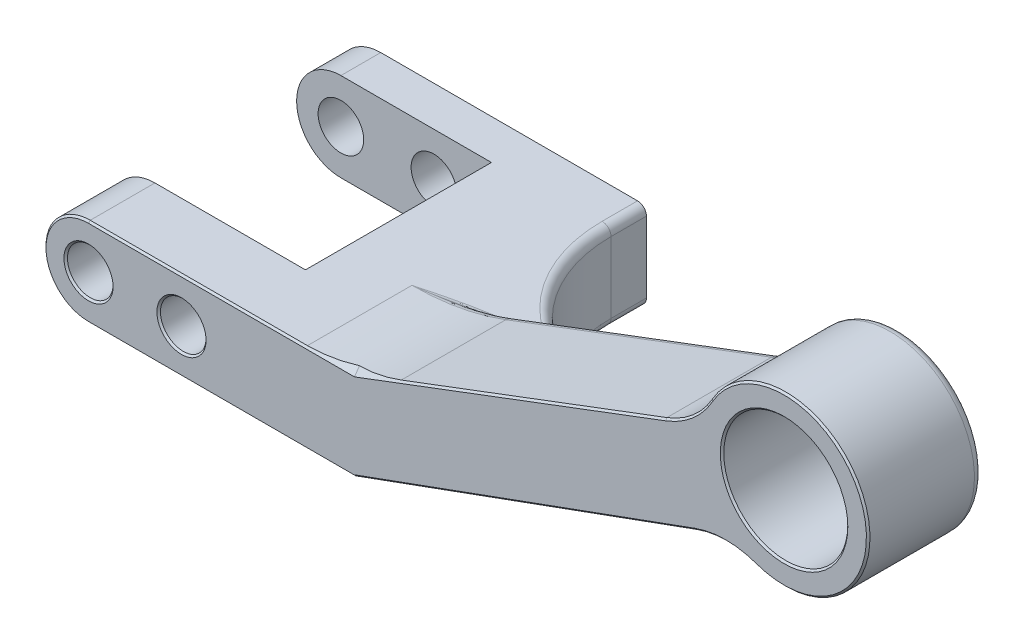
ISO-10303-21;
HEADER;
FILE_DESCRIPTION(('STEP AP214'),'2;1');
FILE_NAME('part.step','',(''),(''),'','','');
FILE_SCHEMA(('AUTOMOTIVE_DESIGN { 1 0 10303 214 1 1 1 1 }'));
ENDSEC;
DATA;
#1=APPLICATION_CONTEXT('core data for automotive mechanical design processes');
#2=APPLICATION_PROTOCOL_DEFINITION('international standard','automotive_design',2000,#1);
#3=PRODUCT_CONTEXT('',#1,'mechanical');
#4=PRODUCT('Part','Part','',(#3));
#5=PRODUCT_RELATED_PRODUCT_CATEGORY('part','',(#4));
#6=PRODUCT_DEFINITION_FORMATION('','',#4);
#7=PRODUCT_DEFINITION_CONTEXT('part definition',#1,'design');
#8=PRODUCT_DEFINITION('design','',#6,#7);
#9=PRODUCT_DEFINITION_SHAPE('','',#8);
#10=(LENGTH_UNIT() NAMED_UNIT(*) SI_UNIT(.MILLI.,.METRE.));
#11=(NAMED_UNIT(*) PLANE_ANGLE_UNIT() SI_UNIT($,.RADIAN.));
#12=(NAMED_UNIT(*) SI_UNIT($,.STERADIAN.) SOLID_ANGLE_UNIT());
#13=UNCERTAINTY_MEASURE_WITH_UNIT(LENGTH_MEASURE(1.E-05),#10,'distance_accuracy_value','');
#14=(GEOMETRIC_REPRESENTATION_CONTEXT(3) GLOBAL_UNCERTAINTY_ASSIGNED_CONTEXT((#13)) GLOBAL_UNIT_ASSIGNED_CONTEXT((#10,
#11,#12)) REPRESENTATION_CONTEXT('',''));
#15=CARTESIAN_POINT('',(0.,0.,0.));
#16=DIRECTION('',(0.,0.,1.));
#17=DIRECTION('',(1.,0.,0.));
#18=AXIS2_PLACEMENT_3D('',#15,#16,#17);
#19=CARTESIAN_POINT('',(5.11630237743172,-14.0569252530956,16.5));
#20=DIRECTION('',(0.34202014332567,-0.939692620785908,0.));
#21=DIRECTION('',(0.939692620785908,0.34202014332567,0.));
#22=AXIS2_PLACEMENT_3D('',#19,#20,#21);
#23=PLANE('',#22);
#24=DIRECTION('',(0.,0.,-1.));
#25=VECTOR('',#24,1.);
#26=CARTESIAN_POINT('',(30.,-4.99999999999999,16.5));
#27=LINE('',#26,#25);
#28=CARTESIAN_POINT('',(30.,-4.99999999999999,16.3));
#29=VERTEX_POINT('',#28);
#30=CARTESIAN_POINT('',(30.,-4.99999999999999,-6.75543735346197));
#31=VERTEX_POINT('',#30);
#32=EDGE_CURVE('E278',#29,#31,#27,.T.);
#33=ORIENTED_EDGE('',*,*,#32,.T.);
#34=CARTESIAN_POINT('',(30.,-5.,-6.75543735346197));
#35=CARTESIAN_POINT('',(30.0000105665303,-4.99999615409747,-6.78199128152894));
#36=CARTESIAN_POINT('',(30.0003327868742,-4.99987887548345,-6.80854971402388));
#37=CARTESIAN_POINT('',(30.001784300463,-4.99935056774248,-6.86167889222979));
#38=CARTESIAN_POINT('',(30.0029147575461,-4.99893911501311,-6.88824960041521));
#39=CARTESIAN_POINT('',(30.0061724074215,-4.9977534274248,-6.94140928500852));
#40=CARTESIAN_POINT('',(30.0083025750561,-4.99697810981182,-6.9679980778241));
#41=CARTESIAN_POINT('',(30.0138872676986,-4.99494544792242,-7.02100490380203));
#42=CARTESIAN_POINT('',(30.0173414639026,-4.99368822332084,-7.04742297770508));
#43=CARTESIAN_POINT('',(30.0272067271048,-4.99009756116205,-7.10686937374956));
#44=CARTESIAN_POINT('',(30.0341553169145,-4.98756848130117,-7.13981656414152));
#45=CARTESIAN_POINT('',(30.0484994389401,-4.98234764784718,-7.1881112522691));
#46=CARTESIAN_POINT('',(30.0539695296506,-4.98035669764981,-7.20409437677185));
#47=CARTESIAN_POINT('',(30.066860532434,-4.97566475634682,-7.23517267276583));
#48=CARTESIAN_POINT('',(30.0742755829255,-4.97296589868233,-7.2502703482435));
#49=CARTESIAN_POINT('',(30.0873099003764,-4.96822179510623,-7.27092869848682));
#50=CARTESIAN_POINT('',(30.0917884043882,-4.96659175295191,-7.2772927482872));
#51=CARTESIAN_POINT('',(30.1014921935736,-4.96305986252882,-7.28929920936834));
#52=CARTESIAN_POINT('',(30.1067134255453,-4.96115948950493,-7.29494524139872));
#53=CARTESIAN_POINT('',(30.1177796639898,-4.95713170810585,-7.30499932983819));
#54=CARTESIAN_POINT('',(30.1235909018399,-4.95501659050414,-7.3094482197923));
#55=CARTESIAN_POINT('',(30.1360136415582,-4.95049508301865,-7.31712169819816));
#56=CARTESIAN_POINT('',(30.1426371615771,-4.94808431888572,-7.32032397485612));
#57=CARTESIAN_POINT('',(30.149572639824,-4.94556001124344,-7.3226798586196));
#58=B_SPLINE_CURVE_WITH_KNOTS('',3,(#34,#35,#36,#37,#38,#39,#40,#41,#42,#43,#44,#45,#46,#47,#48,
#49,#50,#51,#52,#53,#54,#55,#56,#57),.UNSPECIFIED.,.F.,.F.,(4,2,2,2,2,2,2,2,2,2,2,4),(0.,
0.0796657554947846,0.15944645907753,0.239466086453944,0.319465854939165,0.420420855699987,
0.471380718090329,0.522188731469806,0.545987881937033,0.569661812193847,0.592378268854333,
0.615484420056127),.UNSPECIFIED.);
#59=CARTESIAN_POINT('',(30.149572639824,-4.94556001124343,-7.32267985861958));
#60=VERTEX_POINT('',#59);
#61=EDGE_CURVE('E474',#31,#60,#58,.T.);
#62=ORIENTED_EDGE('',*,*,#61,.T.);
#63=CARTESIAN_POINT('',(46.3420201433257,0.948008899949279,-12.5));
#64=DIRECTION('',(0.34202014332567,-0.939692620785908,0.));
#65=DIRECTION('',(0.939692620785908,0.34202014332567,0.));
#66=AXIS2_PLACEMENT_3D('',#63,#64,#65);
#67=ELLIPSE('',#66,18.0910221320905,17.);
#68=CARTESIAN_POINT('',(46.3420201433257,0.948008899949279,4.5));
#69=VERTEX_POINT('',#68);
#70=EDGE_CURVE('E471',#60,#69,#67,.F.);
#71=ORIENTED_EDGE('',*,*,#70,.T.);
#72=DIRECTION('',(-0.939692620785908,-0.34202014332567,0.));
#73=VECTOR('',#72,1.);
#74=CARTESIAN_POINT('',(5.11630237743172,-14.0569252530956,4.5));
#75=LINE('',#74,#73);
#76=CARTESIAN_POINT('',(68.5432819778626,9.02860737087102,4.5));
#77=VERTEX_POINT('',#76);
#78=EDGE_CURVE('E468',#69,#77,#75,.F.);
#79=ORIENTED_EDGE('',*,*,#78,.T.);
#80=DIRECTION('',(0.,0.,-1.));
#81=VECTOR('',#80,1.);
#82=CARTESIAN_POINT('',(68.5432819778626,9.02860737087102,16.5));
#83=LINE('',#82,#81);
#84=CARTESIAN_POINT('',(68.5432819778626,9.02860737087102,16.3));
#85=VERTEX_POINT('',#84);
#86=EDGE_CURVE('E294',#77,#85,#83,.F.);
#87=ORIENTED_EDGE('',*,*,#86,.T.);
#88=DIRECTION('',(-0.939692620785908,-0.34202014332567,0.));
#89=VECTOR('',#88,1.);
#90=CARTESIAN_POINT('',(5.11630237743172,-14.0569252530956,16.3));
#91=LINE('',#90,#89);
#92=EDGE_CURVE('E356',#85,#29,#91,.T.);
#93=ORIENTED_EDGE('',*,*,#92,.T.);
#94=EDGE_LOOP('',(#33,#62,#71,#79,#87,#93));
#95=FACE_BOUND('',#94,.T.);
#96=ADVANCED_FACE('F49',(#95),#23,.T.);
#97=CARTESIAN_POINT('',(78.5416909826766,17.9886195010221,16.5));
#98=DIRECTION('',(0.,0.,-1.));
#99=DIRECTION('',(-1.,0.,0.));
#100=AXIS2_PLACEMENT_3D('',#97,#98,#99);
#101=CYLINDRICAL_SURFACE('',#100,9.49999999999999);
#102=DIRECTION('',(0.,0.,-1.));
#103=VECTOR('',#102,1.);
#104=CARTESIAN_POINT('',(75.3369231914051,9.04549569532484,16.5));
#105=LINE('',#104,#103);
#106=CARTESIAN_POINT('',(75.3369231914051,9.04549569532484,16.3));
#107=VERTEX_POINT('',#106);
#108=CARTESIAN_POINT('',(75.3369231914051,9.04549569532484,4.5));
#109=VERTEX_POINT('',#108);
#110=EDGE_CURVE('E290',#107,#109,#105,.T.);
#111=ORIENTED_EDGE('',*,*,#110,.T.);
#112=CARTESIAN_POINT('',(78.5416909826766,17.9886195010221,4.5));
#113=DIRECTION('',(0.,0.,-1.));
#114=DIRECTION('',(-1.,0.,0.));
#115=AXIS2_PLACEMENT_3D('',#112,#113,#114);
#116=CIRCLE('',#115,9.49999999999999);
#117=CARTESIAN_POINT('',(70.2810134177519,22.6802296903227,4.5));
#118=VERTEX_POINT('',#117);
#119=EDGE_CURVE('E1340',#109,#118,#116,.F.);
#120=ORIENTED_EDGE('',*,*,#119,.T.);
#121=DIRECTION('',(0.,0.,-1.));
#122=VECTOR('',#121,1.);
#123=CARTESIAN_POINT('',(70.2810134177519,22.6802296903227,16.5));
#124=LINE('',#123,#122);
#125=CARTESIAN_POINT('',(70.2810134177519,22.6802296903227,16.3));
#126=VERTEX_POINT('',#125);
#127=EDGE_CURVE('E282',#118,#126,#124,.F.);
#128=ORIENTED_EDGE('',*,*,#127,.T.);
#129=CARTESIAN_POINT('',(78.5416909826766,17.9886195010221,16.3));
#130=DIRECTION('',(0.,0.,1.));
#131=DIRECTION('',(1.,0.,0.));
#132=AXIS2_PLACEMENT_3D('',#129,#130,#131);
#133=CIRCLE('',#132,9.49999999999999);
#134=EDGE_CURVE('E349',#126,#107,#133,.F.);
#135=ORIENTED_EDGE('',*,*,#134,.T.);
#136=EDGE_LOOP('',(#111,#120,#128,#135));
#137=FACE_BOUND('',#136,.T.);
#138=ADVANCED_FACE('F809',(#137),#101,.T.);
#139=CARTESIAN_POINT('',(2.09243568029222,-5.54019796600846,16.5));
#140=DIRECTION('',(-0.353322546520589,0.935501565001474,0.));
#141=DIRECTION('',(-0.935501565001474,-0.353322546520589,0.));
#142=AXIS2_PLACEMENT_3D('',#139,#140,#141);
#143=PLANE('',#142);
#144=DIRECTION('',(0.,0.,-1.));
#145=VECTOR('',#144,1.);
#146=CARTESIAN_POINT('',(65.118788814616,18.2637510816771,16.5));
#147=LINE('',#146,#145);
#148=CARTESIAN_POINT('',(65.118788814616,18.2637510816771,16.3));
#149=VERTEX_POINT('',#148);
#150=CARTESIAN_POINT('',(65.118788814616,18.2637510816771,4.5));
#151=VERTEX_POINT('',#150);
#152=EDGE_CURVE('E297',#149,#151,#147,.T.);
#153=ORIENTED_EDGE('',*,*,#152,.T.);
#154=DIRECTION('',(0.935501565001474,0.353322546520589,0.));
#155=VECTOR('',#154,1.);
#156=CARTESIAN_POINT('',(2.09243568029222,-5.54019796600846,4.5));
#157=LINE('',#156,#155);
#158=CARTESIAN_POINT('',(35.1232269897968,6.9349530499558,4.5));
#159=VERTEX_POINT('',#158);
#160=EDGE_CURVE('E522',#151,#159,#157,.F.);
#161=ORIENTED_EDGE('',*,*,#160,.T.);
#162=DIRECTION('',(0.,0.,-1.));
#163=VECTOR('',#162,1.);
#164=CARTESIAN_POINT('',(35.1232269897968,6.9349530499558,16.3));
#165=LINE('',#164,#163);
#166=CARTESIAN_POINT('',(35.1232269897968,6.9349530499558,16.3));
#167=VERTEX_POINT('',#166);
#168=EDGE_CURVE('E413',#159,#167,#165,.F.);
#169=ORIENTED_EDGE('',*,*,#168,.T.);
#170=DIRECTION('',(0.935501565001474,0.353322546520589,0.));
#171=VECTOR('',#170,1.);
#172=CARTESIAN_POINT('',(2.09243568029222,-5.54019796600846,16.3));
#173=LINE('',#172,#171);
#174=EDGE_CURVE('E342',#167,#149,#173,.T.);
#175=ORIENTED_EDGE('',*,*,#174,.T.);
#176=EDGE_LOOP('',(#153,#161,#169,#175));
#177=FACE_BOUND('',#176,.T.);
#178=ADVANCED_FACE('F814',(#177),#143,.T.);
#179=CARTESIAN_POINT('',(78.5416909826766,17.9886195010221,16.5));
#180=DIRECTION('',(0.,0.,-1.));
#181=DIRECTION('',(-1.,0.,0.));
#182=AXIS2_PLACEMENT_3D('',#179,#180,#181);
#183=CYLINDRICAL_SURFACE('',#182,7.);
#184=CARTESIAN_POINT('',(78.5416909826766,17.9886195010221,16.3));
#185=DIRECTION('',(0.,0.,1.));
#186=DIRECTION('',(1.,0.,0.));
#187=AXIS2_PLACEMENT_3D('',#184,#185,#186);
#188=CIRCLE('',#187,7.);
#189=CARTESIAN_POINT('',(85.5416909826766,17.9886195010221,16.3));
#190=VERTEX_POINT('',#189);
#191=EDGE_CURVE('E369',#190,#190,#188,.T.);
#192=ORIENTED_EDGE('',*,*,#191,.T.);
#193=EDGE_LOOP('',(#192));
#194=FACE_BOUND('',#193,.T.);
#195=CARTESIAN_POINT('',(78.5416909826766,17.9886195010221,3.5));
#196=DIRECTION('',(0.,0.,-1.));
#197=DIRECTION('',(-1.,0.,0.));
#198=AXIS2_PLACEMENT_3D('',#195,#196,#197);
#199=CIRCLE('',#198,7.);
#200=CARTESIAN_POINT('',(71.5416909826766,17.9886195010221,3.5));
#201=VERTEX_POINT('',#200);
#202=EDGE_CURVE('E776',#201,#201,#199,.F.);
#203=ORIENTED_EDGE('',*,*,#202,.F.);
#204=EDGE_LOOP('',(#203));
#205=FACE_BOUND('',#204,.T.);
#206=ADVANCED_FACE('F901',(#194,#205),#183,.F.);
#207=CARTESIAN_POINT('',(0.,0.,-16.5));
#208=DIRECTION('',(0.,0.,1.));
#209=DIRECTION('',(1.,0.,0.));
#210=AXIS2_PLACEMENT_3D('',#207,#208,#209);
#211=PLANE('',#210);
#212=CARTESIAN_POINT('',(0.,0.,-16.5));
#213=DIRECTION('',(0.,0.,1.));
#214=DIRECTION('',(1.,0.,0.));
#215=AXIS2_PLACEMENT_3D('',#212,#213,#214);
#216=CIRCLE('',#215,2.575);
#217=CARTESIAN_POINT('',(2.575,0.,-16.5));
#218=VERTEX_POINT('',#217);
#219=EDGE_CURVE('E758',#218,#218,#216,.T.);
#220=ORIENTED_EDGE('',*,*,#219,.T.);
#221=EDGE_LOOP('',(#220));
#222=FACE_BOUND('',#221,.T.);
#223=CARTESIAN_POINT('',(10.5,0.,-16.5));
#224=DIRECTION('',(0.,0.,1.));
#225=DIRECTION('',(1.,0.,0.));
#226=AXIS2_PLACEMENT_3D('',#223,#224,#225);
#227=CIRCLE('',#226,2.575);
#228=CARTESIAN_POINT('',(13.075,0.,-16.5));
#229=VERTEX_POINT('',#228);
#230=EDGE_CURVE('E754',#229,#229,#227,.T.);
#231=ORIENTED_EDGE('',*,*,#230,.T.);
#232=EDGE_LOOP('',(#231));
#233=FACE_BOUND('',#232,.T.);
#234=DIRECTION('',(1.,0.,0.));
#235=VECTOR('',#234,1.);
#236=CARTESIAN_POINT('',(0.,5.,-16.5));
#237=LINE('',#236,#235);
#238=CARTESIAN_POINT('',(0.,5.,-16.5));
#239=VERTEX_POINT('',#238);
#240=CARTESIAN_POINT('',(29.,5.00000000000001,-16.5));
#241=VERTEX_POINT('',#240);
#242=EDGE_CURVE('E704',#239,#241,#237,.T.);
#243=ORIENTED_EDGE('',*,*,#242,.T.);
#244=CARTESIAN_POINT('',(29.,4.00000000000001,-16.5));
#245=DIRECTION('',(0.,0.,1.));
#246=DIRECTION('',(1.,0.,0.));
#247=AXIS2_PLACEMENT_3D('',#244,#245,#246);
#248=CIRCLE('',#247,1.);
#249=CARTESIAN_POINT('',(30.,4.00000000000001,-16.5));
#250=VERTEX_POINT('',#249);
#251=EDGE_CURVE('E526',#241,#250,#248,.F.);
#252=ORIENTED_EDGE('',*,*,#251,.T.);
#253=DIRECTION('',(0.,-1.,0.));
#254=VECTOR('',#253,1.);
#255=CARTESIAN_POINT('',(30.,0.,-16.5));
#256=LINE('',#255,#254);
#257=CARTESIAN_POINT('',(30.,-4.,-16.5));
#258=VERTEX_POINT('',#257);
#259=EDGE_CURVE('E409',#250,#258,#256,.T.);
#260=ORIENTED_EDGE('',*,*,#259,.T.);
#261=CARTESIAN_POINT('',(29.,-4.,-16.5));
#262=DIRECTION('',(0.,0.,1.));
#263=DIRECTION('',(1.,0.,0.));
#264=AXIS2_PLACEMENT_3D('',#261,#262,#263);
#265=CIRCLE('',#264,1.);
#266=CARTESIAN_POINT('',(29.,-5.,-16.5));
#267=VERTEX_POINT('',#266);
#268=EDGE_CURVE('E459',#258,#267,#265,.F.);
#269=ORIENTED_EDGE('',*,*,#268,.T.);
#270=DIRECTION('',(-1.,0.,0.));
#271=VECTOR('',#270,1.);
#272=CARTESIAN_POINT('',(0.,-5.,-16.5));
#273=LINE('',#272,#271);
#274=CARTESIAN_POINT('',(0.,-5.,-16.5));
#275=VERTEX_POINT('',#274);
#276=EDGE_CURVE('E709',#267,#275,#273,.T.);
#277=ORIENTED_EDGE('',*,*,#276,.T.);
#278=CARTESIAN_POINT('',(0.,0.,-16.5));
#279=DIRECTION('',(0.,0.,1.));
#280=DIRECTION('',(1.,0.,0.));
#281=AXIS2_PLACEMENT_3D('',#278,#279,#280);
#282=CIRCLE('',#281,5.);
#283=EDGE_CURVE('E275',#275,#239,#282,.F.);
#284=ORIENTED_EDGE('',*,*,#283,.T.);
#285=EDGE_LOOP('',(#243,#252,#260,#269,#277,#284));
#286=FACE_BOUND('',#285,.T.);
#287=ADVANCED_FACE('F706',(#222,#233,#286),#211,.F.);
#288=CARTESIAN_POINT('',(0.,0.,16.5));
#289=DIRECTION('',(0.,0.,-1.));
#290=DIRECTION('',(-1.,0.,0.));
#291=AXIS2_PLACEMENT_3D('',#288,#289,#290);
#292=CYLINDRICAL_SURFACE('',#291,5.);
#293=DIRECTION('',(0.,0.,-1.));
#294=VECTOR('',#293,1.);
#295=CARTESIAN_POINT('',(0.,-5.,16.5));
#296=LINE('',#295,#294);
#297=CARTESIAN_POINT('',(0.,-5.,-12.));
#298=VERTEX_POINT('',#297);
#299=EDGE_CURVE('E266',#298,#275,#296,.T.);
#300=ORIENTED_EDGE('',*,*,#299,.F.);
#301=CARTESIAN_POINT('',(0.,0.,-12.));
#302=DIRECTION('',(0.,0.,1.));
#303=DIRECTION('',(1.,0.,0.));
#304=AXIS2_PLACEMENT_3D('',#301,#302,#303);
#305=CIRCLE('',#304,5.);
#306=CARTESIAN_POINT('',(0.,5.,-12.));
#307=VERTEX_POINT('',#306);
#308=EDGE_CURVE('E248',#298,#307,#305,.F.);
#309=ORIENTED_EDGE('',*,*,#308,.T.);
#310=DIRECTION('',(0.,0.,-1.));
#311=VECTOR('',#310,1.);
#312=CARTESIAN_POINT('',(0.,5.,16.5));
#313=LINE('',#312,#311);
#314=EDGE_CURVE('E708',#307,#239,#313,.T.);
#315=ORIENTED_EDGE('',*,*,#314,.T.);
#316=ORIENTED_EDGE('',*,*,#283,.F.);
#317=EDGE_LOOP('',(#300,#309,#315,#316));
#318=FACE_BOUND('',#317,.T.);
#319=ADVANCED_FACE('F273',(#318),#292,.T.);
#320=CARTESIAN_POINT('',(0.,0.,16.5));
#321=DIRECTION('',(0.,0.,-1.));
#322=DIRECTION('',(-1.,0.,0.));
#323=AXIS2_PLACEMENT_3D('',#320,#321,#322);
#324=CYLINDRICAL_SURFACE('',#323,2.575);
#325=ORIENTED_EDGE('',*,*,#219,.F.);
#326=EDGE_LOOP('',(#325));
#327=FACE_BOUND('',#326,.T.);
#328=CARTESIAN_POINT('',(0.,0.,-12.));
#329=DIRECTION('',(0.,0.,1.));
#330=DIRECTION('',(1.,0.,0.));
#331=AXIS2_PLACEMENT_3D('',#328,#329,#330);
#332=CIRCLE('',#331,2.575);
#333=CARTESIAN_POINT('',(2.575,0.,-12.));
#334=VERTEX_POINT('',#333);
#335=EDGE_CURVE('E260',#334,#334,#332,.F.);
#336=ORIENTED_EDGE('',*,*,#335,.F.);
#337=EDGE_LOOP('',(#336));
#338=FACE_BOUND('',#337,.T.);
#339=ADVANCED_FACE('F766',(#327,#338),#324,.F.);
#340=CARTESIAN_POINT('',(10.5,0.,-16.5));
#341=DIRECTION('',(0.,0.,1.));
#342=DIRECTION('',(1.,0.,0.));
#343=AXIS2_PLACEMENT_3D('',#340,#341,#342);
#344=CYLINDRICAL_SURFACE('',#343,2.575);
#345=ORIENTED_EDGE('',*,*,#230,.F.);
#346=EDGE_LOOP('',(#345));
#347=FACE_BOUND('',#346,.T.);
#348=CARTESIAN_POINT('',(10.5,0.,-12.));
#349=DIRECTION('',(0.,0.,1.));
#350=DIRECTION('',(1.,0.,0.));
#351=AXIS2_PLACEMENT_3D('',#348,#349,#350);
#352=CIRCLE('',#351,2.575);
#353=CARTESIAN_POINT('',(13.075,0.,-12.));
#354=VERTEX_POINT('',#353);
#355=EDGE_CURVE('E787',#354,#354,#352,.F.);
#356=ORIENTED_EDGE('',*,*,#355,.F.);
#357=EDGE_LOOP('',(#356));
#358=FACE_BOUND('',#357,.T.);
#359=ADVANCED_FACE('F769',(#347,#358),#344,.F.);
#360=CARTESIAN_POINT('',(0.,-5.,16.3));
#361=VERTEX_POINT('',#360);
#362=CARTESIAN_POINT('',(0.,-5.,9.));
#363=VERTEX_POINT('',#362);
#364=EDGE_CURVE('E277',#361,#363,#296,.T.);
#365=ORIENTED_EDGE('',*,*,#364,.F.);
#366=CARTESIAN_POINT('',(0.,0.,16.3));
#367=DIRECTION('',(0.,0.,1.));
#368=DIRECTION('',(1.,0.,0.));
#369=AXIS2_PLACEMENT_3D('',#366,#367,#368);
#370=CIRCLE('',#369,5.);
#371=CARTESIAN_POINT('',(0.,5.,16.3));
#372=VERTEX_POINT('',#371);
#373=EDGE_CURVE('E362',#361,#372,#370,.F.);
#374=ORIENTED_EDGE('',*,*,#373,.T.);
#375=CARTESIAN_POINT('',(0.,5.,9.));
#376=VERTEX_POINT('',#375);
#377=EDGE_CURVE('E284',#372,#376,#313,.T.);
#378=ORIENTED_EDGE('',*,*,#377,.T.);
#379=CARTESIAN_POINT('',(0.,0.,9.));
#380=DIRECTION('',(0.,0.,1.));
#381=DIRECTION('',(1.,0.,0.));
#382=AXIS2_PLACEMENT_3D('',#379,#380,#381);
#383=CIRCLE('',#382,5.);
#384=EDGE_CURVE('E721',#363,#376,#383,.F.);
#385=ORIENTED_EDGE('',*,*,#384,.F.);
#386=EDGE_LOOP('',(#365,#374,#378,#385));
#387=FACE_BOUND('',#386,.T.);
#388=ADVANCED_FACE('F720',(#387),#292,.T.);
#389=CARTESIAN_POINT('',(0.,-5.,16.5));
#390=DIRECTION('',(0.,-1.,0.));
#391=DIRECTION('',(1.,0.,0.));
#392=AXIS2_PLACEMENT_3D('',#389,#390,#391);
#393=PLANE('',#392);
#394=ORIENTED_EDGE('',*,*,#276,.F.);
#395=DIRECTION('',(0.,0.,-1.));
#396=VECTOR('',#395,1.);
#397=CARTESIAN_POINT('',(29.,-5.,16.5));
#398=LINE('',#397,#396);
#399=CARTESIAN_POINT('',(29.,-5.,-12.5));
#400=VERTEX_POINT('',#399);
#401=EDGE_CURVE('E465',#267,#400,#398,.F.);
#402=ORIENTED_EDGE('',*,*,#401,.T.);
#403=CARTESIAN_POINT('',(46.,-4.99999999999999,-12.5));
#404=DIRECTION('',(0.,-1.,0.));
#405=DIRECTION('',(1.,0.,0.));
#406=AXIS2_PLACEMENT_3D('',#403,#404,#405);
#407=CIRCLE('',#406,17.);
#408=EDGE_CURVE('E462',#400,#31,#407,.F.);
#409=ORIENTED_EDGE('',*,*,#408,.T.);
#410=ORIENTED_EDGE('',*,*,#32,.F.);
#411=DIRECTION('',(-1.,0.,0.));
#412=VECTOR('',#411,1.);
#413=CARTESIAN_POINT('',(0.,-5.,16.3));
#414=LINE('',#413,#412);
#415=EDGE_CURVE('E359',#29,#361,#414,.T.);
#416=ORIENTED_EDGE('',*,*,#415,.T.);
#417=ORIENTED_EDGE('',*,*,#364,.T.);
#418=DIRECTION('',(-1.,0.,0.));
#419=VECTOR('',#418,1.);
#420=CARTESIAN_POINT('',(0.,-5.,9.));
#421=LINE('',#420,#419);
#422=CARTESIAN_POINT('',(17.,-5.,9.));
#423=VERTEX_POINT('',#422);
#424=EDGE_CURVE('E733',#423,#363,#421,.T.);
#425=ORIENTED_EDGE('',*,*,#424,.F.);
#426=DIRECTION('',(0.,0.,-1.));
#427=VECTOR('',#426,1.);
#428=CARTESIAN_POINT('',(17.,-5.,9.));
#429=LINE('',#428,#427);
#430=CARTESIAN_POINT('',(17.,-5.,-12.));
#431=VERTEX_POINT('',#430);
#432=EDGE_CURVE('E269',#423,#431,#429,.T.);
#433=ORIENTED_EDGE('',*,*,#432,.T.);
#434=DIRECTION('',(-1.,0.,0.));
#435=VECTOR('',#434,1.);
#436=CARTESIAN_POINT('',(0.,-5.,-12.));
#437=LINE('',#436,#435);
#438=EDGE_CURVE('E252',#431,#298,#437,.T.);
#439=ORIENTED_EDGE('',*,*,#438,.T.);
#440=ORIENTED_EDGE('',*,*,#299,.T.);
#441=EDGE_LOOP('',(#394,#402,#409,#410,#416,#417,#425,#433,#439,#440));
#442=FACE_BOUND('',#441,.T.);
#443=ADVANCED_FACE('F265',(#442),#393,.T.);
#444=CARTESIAN_POINT('',(0.,0.,16.3));
#445=DIRECTION('',(0.,0.,1.));
#446=DIRECTION('',(1.,0.,0.));
#447=AXIS2_PLACEMENT_3D('',#444,#445,#446);
#448=CIRCLE('',#447,2.575);
#449=CARTESIAN_POINT('',(2.575,0.,16.3));
#450=VERTEX_POINT('',#449);
#451=EDGE_CURVE('E365',#450,#450,#448,.T.);
#452=ORIENTED_EDGE('',*,*,#451,.T.);
#453=EDGE_LOOP('',(#452));
#454=FACE_BOUND('',#453,.T.);
#455=CARTESIAN_POINT('',(0.,0.,9.));
#456=DIRECTION('',(0.,0.,1.));
#457=DIRECTION('',(1.,0.,0.));
#458=AXIS2_PLACEMENT_3D('',#455,#456,#457);
#459=CIRCLE('',#458,2.575);
#460=CARTESIAN_POINT('',(2.575,0.,9.));
#461=VERTEX_POINT('',#460);
#462=EDGE_CURVE('E735',#461,#461,#459,.F.);
#463=ORIENTED_EDGE('',*,*,#462,.T.);
#464=EDGE_LOOP('',(#463));
#465=FACE_BOUND('',#464,.T.);
#466=ADVANCED_FACE('F771',(#454,#465),#324,.F.);
#467=CARTESIAN_POINT('',(0.,5.,16.5));
#468=DIRECTION('',(0.,1.,0.));
#469=DIRECTION('',(-1.,0.,0.));
#470=AXIS2_PLACEMENT_3D('',#467,#468,#469);
#471=PLANE('',#470);
#472=DIRECTION('',(0.,0.,-1.));
#473=VECTOR('',#472,1.);
#474=CARTESIAN_POINT('',(24.5235505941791,5.00000000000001,3.5));
#475=LINE('',#474,#473);
#476=CARTESIAN_POINT('',(24.5235505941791,5.00000000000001,16.3));
#477=VERTEX_POINT('',#476);
#478=CARTESIAN_POINT('',(24.5235505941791,5.00000000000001,4.5));
#479=VERTEX_POINT('',#478);
#480=EDGE_CURVE('E377',#477,#479,#475,.T.);
#481=ORIENTED_EDGE('',*,*,#480,.T.);
#482=CARTESIAN_POINT('',(38.1488340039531,6.51753802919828,3.68093955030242));
#483=CARTESIAN_POINT('',(38.0613590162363,6.01769457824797,3.97033357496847));
#484=CARTESIAN_POINT('',(38.1443743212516,5.50884728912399,3.69569354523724));
#485=CARTESIAN_POINT('',(38.227389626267,5.00000000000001,3.42105351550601));
#486=CARTESIAN_POINT('',(38.3964109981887,5.00000000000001,2.86187910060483));
#487=CARTESIAN_POINT('',(38.0520343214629,6.49717677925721,3.66456330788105));
#488=CARTESIAN_POINT('',(37.9748532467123,5.99704171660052,3.94031905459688));
#489=CARTESIAN_POINT('',(38.0530714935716,5.49848607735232,3.66199910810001));
#490=CARTESIAN_POINT('',(38.1319307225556,5.00000000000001,3.38390136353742));
#491=CARTESIAN_POINT('',(38.2879337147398,5.00000000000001,2.82912661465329));
#492=CARTESIAN_POINT('',(37.9541905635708,6.47676134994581,3.64967171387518));
#493=CARTESIAN_POINT('',(37.8856347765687,5.97690186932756,3.91174249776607));
#494=CARTESIAN_POINT('',(37.9595432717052,5.48841959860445,3.63036866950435));
#495=CARTESIAN_POINT('',(38.0340696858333,5.00000000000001,3.3491836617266));
#496=CARTESIAN_POINT('',(38.1786024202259,5.00000000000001,2.79934342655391));
#497=CARTESIAN_POINT('',(37.7568146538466,6.43592946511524,3.62253488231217));
#498=CARTESIAN_POINT('',(37.7033289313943,5.93774175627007,3.85765821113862));
#499=CARTESIAN_POINT('',(37.768935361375,5.46883921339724,3.5710169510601));
#500=CARTESIAN_POINT('',(37.8351505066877,5.00000000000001,3.28456879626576));
#501=CARTESIAN_POINT('',(37.9586954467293,5.00000000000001,2.7450697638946));
#502=CARTESIAN_POINT('',(37.6572835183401,6.41551301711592,3.61028810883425));
#503=CARTESIAN_POINT('',(37.6102310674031,5.91870564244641,3.83211798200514));
#504=CARTESIAN_POINT('',(37.6718577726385,5.45932498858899,3.54329340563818));
#505=CARTESIAN_POINT('',(37.7340737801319,5.00000000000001,3.25462476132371));
#506=CARTESIAN_POINT('',(37.8481205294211,5.00000000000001,2.72057621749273));
#507=CARTESIAN_POINT('',(37.4570625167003,6.37481197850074,3.58812662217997));
#508=CARTESIAN_POINT('',(37.4212030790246,5.88170026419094,3.78406391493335));
#509=CARTESIAN_POINT('',(37.4751812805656,5.44082274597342,3.49156084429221));
#510=CARTESIAN_POINT('',(37.5297440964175,5.00000000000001,3.19921062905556));
#511=CARTESIAN_POINT('',(37.6263323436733,5.00000000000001,2.67625324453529));
#512=CARTESIAN_POINT('',(37.3563760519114,6.35452718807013,3.57820631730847));
#513=CARTESIAN_POINT('',(37.3252644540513,5.86371582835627,3.76151670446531));
#514=CARTESIAN_POINT('',(37.3755890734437,5.43183350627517,3.46754297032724));
#515=CARTESIAN_POINT('',(37.4264745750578,5.00000000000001,3.17369384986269));
#516=CARTESIAN_POINT('',(37.5151212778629,5.00000000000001,2.65641263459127));
#517=CARTESIAN_POINT('',(37.1538153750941,6.3141027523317,3.56041084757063));
#518=CARTESIAN_POINT('',(37.1309035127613,5.82868126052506,3.71922183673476));
#519=CARTESIAN_POINT('',(37.1741985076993,5.4143163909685,3.42288429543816));
#520=CARTESIAN_POINT('',(37.2180511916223,5.00000000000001,3.12667018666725));
#521=CARTESIAN_POINT('',(37.292034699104,5.00000000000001,2.62082169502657));
#522=CARTESIAN_POINT('',(37.0519409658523,6.29396313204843,3.55253602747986));
#523=CARTESIAN_POINT('',(37.0324614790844,5.81162017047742,3.69945199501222));
#524=CARTESIAN_POINT('',(37.0723997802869,5.40578859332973,3.40224406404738));
#525=CARTESIAN_POINT('',(37.1128720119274,5.00000000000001,3.10513383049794));
#526=CARTESIAN_POINT('',(37.180159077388,5.00000000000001,2.60507205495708));
#527=CARTESIAN_POINT('',(36.7468507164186,6.23424659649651,3.53179463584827));
#528=CARTESIAN_POINT('',(36.7368520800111,5.76218901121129,3.64462050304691));
#529=CARTESIAN_POINT('',(36.7664265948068,5.38101010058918,3.34540421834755));
#530=CARTESIAN_POINT('',(36.798079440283,5.00000000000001,3.04657694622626));
#531=CARTESIAN_POINT('',(36.8460821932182,5.00000000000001,2.56358927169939));
#532=CARTESIAN_POINT('',(36.5421624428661,6.19496362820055,3.52159933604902));
#533=CARTESIAN_POINT('',(36.5358752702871,5.73089823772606,3.61317340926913));
#534=CARTESIAN_POINT('',(36.5596933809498,5.36538124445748,3.31377978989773));
#535=CARTESIAN_POINT('',(36.5854076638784,5.00000000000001,3.01462775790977));
#536=CARTESIAN_POINT('',(36.6232093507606,5.00000000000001,2.54319867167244));
#537=CARTESIAN_POINT('',(36.1296774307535,6.11748970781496,3.50710681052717));
#538=CARTESIAN_POINT('',(36.1284766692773,5.67125915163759,3.55949588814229));
#539=CARTESIAN_POINT('',(36.1416039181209,5.33556268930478,3.261114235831));
#540=CARTESIAN_POINT('',(36.1566139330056,5.00000000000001,2.96296704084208));
#541=CARTESIAN_POINT('',(36.1765893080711,5.00000000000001,2.51421362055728));
#542=CARTESIAN_POINT('',(35.9218783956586,6.07929962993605,3.50281418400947));
#543=CARTESIAN_POINT('',(35.9218943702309,5.64285669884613,3.53716290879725));
#544=CARTESIAN_POINT('',(35.9302441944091,5.32137412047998,3.24008137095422));
#545=CARTESIAN_POINT('',(35.9403043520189,5.00000000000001,2.94312922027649));
#546=CARTESIAN_POINT('',(35.9528415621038,5.00000000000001,2.50562836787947));
#547=CARTESIAN_POINT('',(35.4240517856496,5.9899404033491,3.49850196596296));
#548=CARTESIAN_POINT('',(35.4260870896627,5.57840305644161,3.49371841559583));
#549=CARTESIAN_POINT('',(35.4231679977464,5.28909815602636,3.20092368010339));
#550=CARTESIAN_POINT('',(35.4234882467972,5.00000000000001,2.90838277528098));
#551=CARTESIAN_POINT('',(35.4197196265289,5.00000000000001,2.49700393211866));
#552=CARTESIAN_POINT('',(35.1329254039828,5.93938390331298,3.50074004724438));
#553=CARTESIAN_POINT('',(35.1340498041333,5.54333842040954,3.4760582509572));
#554=CARTESIAN_POINT('',(35.1260592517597,5.27159092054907,3.18697635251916));
#555=CARTESIAN_POINT('',(35.1209012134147,5.00000000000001,2.89796140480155));
#556=CARTESIAN_POINT('',(35.1102747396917,5.00000000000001,2.50148009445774));
#557=CARTESIAN_POINT('',(34.5470196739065,5.84130567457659,3.51284055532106));
#558=CARTESIAN_POINT('',(34.5453927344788,5.47750204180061,3.45383013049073));
#559=CARTESIAN_POINT('',(34.5283350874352,5.23867406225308,3.17358936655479));
#560=CARTESIAN_POINT('',(34.5140830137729,5.00000000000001,2.89340795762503));
#561=CARTESIAN_POINT('',(34.4919470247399,5.00000000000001,2.52568111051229));
#562=CARTESIAN_POINT('',(34.2522390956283,5.79378500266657,3.52270562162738));
#563=CARTESIAN_POINT('',(34.2484221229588,5.4466477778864,3.44912944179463));
#564=CARTESIAN_POINT('',(34.2277184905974,5.22326516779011,3.17415473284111));
#565=CARTESIAN_POINT('',(34.2094624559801,5.00000000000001,2.89912612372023));
#566=CARTESIAN_POINT('',(34.1830644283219,5.00000000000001,2.54541124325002));
#567=CARTESIAN_POINT('',(33.6595119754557,5.70212261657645,3.54870159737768));
#568=CARTESIAN_POINT('',(33.6512890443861,5.38872152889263,3.45077768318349));
#569=CARTESIAN_POINT('',(33.6242061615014,5.19430240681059,3.18741176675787));
#570=CARTESIAN_POINT('',(33.5995549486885,5.00000000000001,2.92399256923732));
#571=CARTESIAN_POINT('',(33.5661420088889,5.00000000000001,2.5974031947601));
#572=CARTESIAN_POINT('',(33.361563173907,5.65798352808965,3.5648373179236));
#573=CARTESIAN_POINT('',(33.3508083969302,5.36158894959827,3.45704727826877));
#574=CARTESIAN_POINT('',(33.3213088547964,5.18074997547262,3.20011275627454));
#575=CARTESIAN_POINT('',(33.2939241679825,5.00000000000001,2.94305749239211));
#576=CARTESIAN_POINT('',(33.258103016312,5.00000000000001,2.62967463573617));
#577=CARTESIAN_POINT('',(32.7631617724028,5.57342378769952,3.60230103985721));
#578=CARTESIAN_POINT('',(32.747849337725,5.31076954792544,3.47894081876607));
#579=CARTESIAN_POINT('',(32.714299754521,5.15534116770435,3.23570364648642));
#580=CARTESIAN_POINT('',(32.6828448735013,5.00000000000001,2.99234041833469));
#581=CARTESIAN_POINT('',(32.6432758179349,5.00000000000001,2.704602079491));
#582=CARTESIAN_POINT('',(32.462708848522,5.5330036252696,3.62362972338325));
#583=CARTESIAN_POINT('',(32.4450848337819,5.28703418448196,3.49451241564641));
#584=CARTESIAN_POINT('',(32.4101878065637,5.14348501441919,3.25859488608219));
#585=CARTESIAN_POINT('',(32.3770914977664,5.00000000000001,3.0225075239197));
#586=CARTESIAN_POINT('',(32.3364877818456,5.00000000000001,2.74725944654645));
#587=CARTESIAN_POINT('',(31.5528606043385,5.41704978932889,3.69446580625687));
#588=CARTESIAN_POINT('',(31.5323044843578,5.22040376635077,3.55321325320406));
#589=CARTESIAN_POINT('',(31.4915554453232,5.11006730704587,3.34050854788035));
#590=CARTESIAN_POINT('',(31.4581310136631,5.00000000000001,3.12716923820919));
#591=CARTESIAN_POINT('',(31.4127274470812,5.00000000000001,2.88893161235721));
#592=CARTESIAN_POINT('',(30.9401963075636,5.34763834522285,3.75056236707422));
#593=CARTESIAN_POINT('',(30.9159868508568,5.18195396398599,3.60845019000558));
#594=CARTESIAN_POINT('',(30.8760629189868,5.09090616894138,3.41259434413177));
#595=CARTESIAN_POINT('',(30.8413974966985,5.00000000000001,3.21603810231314));
#596=CARTESIAN_POINT('',(30.7977820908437,5.00000000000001,3.0011247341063));
#597=CARTESIAN_POINT('',(29.7090676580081,5.22682093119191,3.87452990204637));
#598=CARTESIAN_POINT('',(29.6828338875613,5.11667933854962,3.7410785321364));
#599=CARTESIAN_POINT('',(29.6452572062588,5.05827219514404,3.5804536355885));
#600=CARTESIAN_POINT('',(29.6128524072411,5.00000000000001,3.41910677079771));
#601=CARTESIAN_POINT('',(29.5731612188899,5.00000000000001,3.24905980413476));
#602=CARTESIAN_POINT('',(29.0906063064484,5.17540612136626,3.94239507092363));
#603=CARTESIAN_POINT('',(29.0641427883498,5.08965265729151,3.81847300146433));
#604=CARTESIAN_POINT('',(29.0299440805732,5.04479656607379,3.67621546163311));
#605=CARTESIAN_POINT('',(28.9991436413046,5.00000000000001,3.53338765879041));
#606=CARTESIAN_POINT('',(28.9634832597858,5.00000000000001,3.3847901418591));
#607=CARTESIAN_POINT('',(27.8202619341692,5.08976823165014,4.0889783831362));
#608=CARTESIAN_POINT('',(27.7981627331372,5.04533275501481,3.99130646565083));
#609=CARTESIAN_POINT('',(27.7707176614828,5.02263365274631,3.88774264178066));
#610=CARTESIAN_POINT('',(27.7469743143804,5.00000000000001,3.7835563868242));
#611=CARTESIAN_POINT('',(27.7190036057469,5.00000000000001,3.67795676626));
#612=CARTESIAN_POINT('',(27.1681793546,5.05647124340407,4.16805761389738));
#613=CARTESIAN_POINT('',(27.1488364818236,5.02842125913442,4.08762037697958));
#614=CARTESIAN_POINT('',(27.1268253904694,5.01420242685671,4.00423886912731));
#615=CARTESIAN_POINT('',(27.1066478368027,5.,3.92052021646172));
#616=CARTESIAN_POINT('',(27.084374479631,5.00000000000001,3.83611522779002));
#617=CARTESIAN_POINT('',(25.8632774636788,5.01180940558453,4.32997851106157));
#618=CARTESIAN_POINT('',(25.8530396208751,5.00589785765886,4.28735255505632));
#619=CARTESIAN_POINT('',(25.8409747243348,5.00294121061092,4.24498528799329));
#620=CARTESIAN_POINT('',(25.8307119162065,5.00000000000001,4.2022745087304));
#621=CARTESIAN_POINT('',(25.8186585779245,5.00000000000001,4.15995702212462));
#622=CARTESIAN_POINT('',(25.2104634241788,5.0003935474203,4.41281096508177));
#623=CARTESIAN_POINT('',(25.2047550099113,5.00019658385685,4.39101164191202));
#624=CARTESIAN_POINT('',(25.1990153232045,5.00009819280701,4.36921674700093));
#625=CARTESIAN_POINT('',(25.1933064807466,5.00000000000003,4.34741597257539));
#626=CARTESIAN_POINT('',(25.1875669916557,5.00000000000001,4.32562193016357));
#627=CARTESIAN_POINT('',(24.5462690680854,5.00000332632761,4.4971163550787));
#628=CARTESIAN_POINT('',(24.5460797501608,5.00000166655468,4.49639544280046));
#629=CARTESIAN_POINT('',(24.5458904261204,5.00000083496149,4.49567453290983));
#630=CARTESIAN_POINT('',(24.5457011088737,5.00000000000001,4.49495362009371));
#631=CARTESIAN_POINT('',(24.5455117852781,5.00000000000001,4.4942327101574));
#632=CARTESIAN_POINT('',(24.5349098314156,4.99999999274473,4.49855817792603));
#633=CARTESIAN_POINT('',(24.5348151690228,4.99999999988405,4.49819772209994));
#634=CARTESIAN_POINT('',(24.5347205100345,5.00000000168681,4.49783726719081));
#635=CARTESIAN_POINT('',(24.5346258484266,5.00000000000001,4.49747681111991));
#636=CARTESIAN_POINT('',(24.5345311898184,5.00000000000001,4.49711635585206));
#637=CARTESIAN_POINT('',(24.5235505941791,5.,4.5));
#638=CARTESIAN_POINT('',(24.5235505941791,5.00000000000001,4.5));
#639=CARTESIAN_POINT('',(24.5235505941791,5.00000000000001,4.5));
#640=CARTESIAN_POINT('',(24.5235505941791,5.00000000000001,4.5));
#641=CARTESIAN_POINT('',(24.5235505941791,5.00000000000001,4.5));
#642=(BOUNDED_SURFACE() B_SPLINE_SURFACE(3,2,((#482,#483,#484,#485,#486),(#487,#488,#489,#490,
#491),(#492,#493,#494,#495,#496),(#497,#498,#499,#500,#501),(#502,#503,#504,#505,#506),(#507,
#508,#509,#510,#511),(#512,#513,#514,#515,#516),(#517,#518,#519,#520,#521),(#522,#523,#524,#525,
#526),(#527,#528,#529,#530,#531),(#532,#533,#534,#535,#536),(#537,#538,#539,#540,#541),(#542,
#543,#544,#545,#546),(#547,#548,#549,#550,#551),(#552,#553,#554,#555,#556),(#557,#558,#559,#560,
#561),(#562,#563,#564,#565,#566),(#567,#568,#569,#570,#571),(#572,#573,#574,#575,#576),(#577,
#578,#579,#580,#581),(#582,#583,#584,#585,#586),(#587,#588,#589,#590,#591),(#592,#593,#594,#595,
#596),(#597,#598,#599,#600,#601),(#602,#603,#604,#605,#606),(#607,#608,#609,#610,#611),(#612,
#613,#614,#615,#616),(#617,#618,#619,#620,#621),(#622,#623,#624,#625,#626),(#627,#628,#629,#630,
#631),(#632,#633,#634,#635,#636),(#637,#638,#639,#640,#641)),.UNSPECIFIED.,.F.,.F.,
.F.) B_SPLINE_SURFACE_WITH_KNOTS((4,2,2,2,2,2,2,2,2,2,2,2,2,2,2,4),(3,2,3),(0.,
0.339840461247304,0.679483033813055,1.01830070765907,1.35717545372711,2.02815429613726,
2.69965565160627,3.62757949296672,4.55582460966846,5.4847833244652,6.41386413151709,
8.28834339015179,10.1619006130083,12.123898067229,14.0813161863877,14.1153749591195),(0.,0.5,
1.),.UNSPECIFIED.) GEOMETRIC_REPRESENTATION_ITEM() RATIONAL_B_SPLINE_SURFACE(((1.,
0.863467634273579,1.,0.863467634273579,1.),(1.,0.866467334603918,1.,0.866467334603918,1.),(1.,
0.8693664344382,1.,0.8693664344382,1.),(1.,0.874979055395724,1.,0.874979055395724,1.),(1.,
0.877692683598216,1.,0.877692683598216,1.),(1.,0.882947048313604,1.,0.882947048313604,1.),(1.,
0.885488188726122,1.,0.885488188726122,1.),(1.,0.890420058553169,1.,0.890420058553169,1.),(1.,
0.892810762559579,1.,0.892810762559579,1.),(1.,0.899731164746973,1.,0.899731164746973,1.),(1.,
0.904060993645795,1.,0.904060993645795,1.),(1.,0.912269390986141,1.,0.912269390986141,1.),(1.,
0.91614760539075,1.,0.91614760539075,1.),(1.,0.924919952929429,1.,0.924919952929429,1.),(1.,
0.929636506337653,1.,0.929636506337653,1.),(1.,0.938446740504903,1.,0.938446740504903,1.),(1.,
0.942540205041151,1.,0.942540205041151,1.),(1.,0.950191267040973,1.,0.950191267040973,1.),(1.,
0.953748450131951,1.,0.953748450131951,1.),(1.,0.960385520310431,1.,0.960385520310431,1.),(1.,
0.963465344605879,1.,0.963465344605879,1.),(1.,0.972111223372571,1.,0.972111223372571,1.),(1.,
0.977018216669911,1.,0.977018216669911,1.),(1.,0.985332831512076,1.,0.985332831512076,1.),(1.,
0.988741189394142,1.,0.988741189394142,1.),(1.,0.994329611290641,1.,0.994329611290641,1.),(1.,
0.996444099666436,1.,0.996444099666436,1.),(1.,0.999265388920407,1.,0.999265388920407,1.),(1.,
0.999975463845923,1.,0.999975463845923,1.),(1.,0.999999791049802,1.,0.999999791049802,1.),(1.,
0.999999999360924,1.,0.999999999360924,1.),(1.,1.,1.,1.,1.))) REPRESENTATION_ITEM('') SURFACE());
#643=CARTESIAN_POINT('',(38.3964109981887,5.00000000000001,2.86187910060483));
#644=CARTESIAN_POINT('',(38.2879337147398,5.00000000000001,2.82912661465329));
#645=CARTESIAN_POINT('',(38.1786024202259,5.00000000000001,2.79934342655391));
#646=CARTESIAN_POINT('',(37.9586954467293,5.00000000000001,2.7450697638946));
#647=CARTESIAN_POINT('',(37.8481205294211,5.00000000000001,2.72057621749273));
#648=CARTESIAN_POINT('',(37.6263323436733,5.00000000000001,2.67625324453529));
#649=CARTESIAN_POINT('',(37.5151212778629,5.00000000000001,2.65641263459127));
#650=CARTESIAN_POINT('',(37.292034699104,5.00000000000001,2.62082169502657));
#651=CARTESIAN_POINT('',(37.180159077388,5.00000000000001,2.60507205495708));
#652=CARTESIAN_POINT('',(36.8460821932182,5.00000000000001,2.56358927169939));
#653=CARTESIAN_POINT('',(36.6232093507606,5.00000000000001,2.54319867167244));
#654=CARTESIAN_POINT('',(36.1765893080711,5.00000000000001,2.51421362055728));
#655=CARTESIAN_POINT('',(35.9528415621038,5.00000000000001,2.50562836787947));
#656=CARTESIAN_POINT('',(35.4197196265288,5.00000000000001,2.49700393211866));
#657=CARTESIAN_POINT('',(35.1102747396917,5.00000000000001,2.50148009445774));
#658=CARTESIAN_POINT('',(34.4919470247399,5.00000000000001,2.52568111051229));
#659=CARTESIAN_POINT('',(34.1830644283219,5.00000000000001,2.54541124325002));
#660=CARTESIAN_POINT('',(33.5661420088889,5.00000000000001,2.5974031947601));
#661=CARTESIAN_POINT('',(33.258103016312,5.00000000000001,2.62967463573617));
#662=CARTESIAN_POINT('',(32.6432758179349,5.00000000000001,2.704602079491));
#663=CARTESIAN_POINT('',(32.3364877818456,5.00000000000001,2.74725944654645));
#664=CARTESIAN_POINT('',(31.4127274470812,5.00000000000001,2.88893161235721));
#665=CARTESIAN_POINT('',(30.7977820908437,5.00000000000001,3.0011247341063));
#666=CARTESIAN_POINT('',(29.5731612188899,5.00000000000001,3.24905980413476));
#667=CARTESIAN_POINT('',(28.9634832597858,5.00000000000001,3.3847901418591));
#668=CARTESIAN_POINT('',(27.7190036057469,5.00000000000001,3.67795676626));
#669=CARTESIAN_POINT('',(27.084374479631,5.00000000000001,3.83611522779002));
#670=CARTESIAN_POINT('',(25.8186585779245,5.00000000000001,4.15995702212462));
#671=CARTESIAN_POINT('',(25.1875669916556,5.00000000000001,4.32562193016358));
#672=CARTESIAN_POINT('',(24.5455117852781,5.00000000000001,4.4942327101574));
#673=CARTESIAN_POINT('',(24.5345311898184,5.00000000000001,4.49711635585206));
#674=CARTESIAN_POINT('',(24.5235505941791,5.00000000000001,4.5));
#675=B_SPLINE_CURVE_WITH_KNOTS('',3,(#643,#644,#645,#646,#647,#648,#649,#650,#651,#652,#653,
#654,#655,#656,#657,#658,#659,#660,#661,#662,#663,#664,#665,#666,#667,#668,#669,#670,#671,#672,
#673,#674),.UNSPECIFIED.,.F.,.F.,(4,2,2,2,2,2,2,2,2,2,2,2,2,2,2,4),(0.,0.339840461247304,
0.679483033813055,1.01830070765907,1.35717545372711,2.02815429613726,2.69965565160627,
3.62757949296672,4.55582460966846,5.4847833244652,6.41386413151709,8.28834339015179,
10.1619006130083,12.123898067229,14.0813161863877,14.1153749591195),.UNSPECIFIED.);
#676=CARTESIAN_POINT('',(35.4763423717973,5.00000000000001,2.50000008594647));
#677=VERTEX_POINT('',#676);
#678=EDGE_CURVE('E548',#479,#677,#675,.F.);
#679=ORIENTED_EDGE('',*,*,#678,.T.);
#680=CARTESIAN_POINT('',(35.4780018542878,5.00000000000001,4.5));
#681=DIRECTION('',(0.,1.,0.));
#682=DIRECTION('',(1.,0.,0.));
#683=AXIS2_PLACEMENT_3D('',#680,#681,#682);
#684=ELLIPSE('',#683,5.66055016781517,2.);
#685=CARTESIAN_POINT('',(35.4780018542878,5.00000000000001,2.5));
#686=VERTEX_POINT('',#685);
#687=EDGE_CURVE('E545',#677,#686,#684,.F.);
#688=ORIENTED_EDGE('',*,*,#687,.T.);
#689=DIRECTION('',(1.,0.,0.));
#690=VECTOR('',#689,1.);
#691=CARTESIAN_POINT('',(40.255437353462,5.00000000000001,2.5));
#692=LINE('',#691,#690);
#693=CARTESIAN_POINT('',(38.,5.00000000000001,2.5));
#694=VERTEX_POINT('',#693);
#695=EDGE_CURVE('E536',#686,#694,#692,.T.);
#696=ORIENTED_EDGE('',*,*,#695,.T.);
#697=CARTESIAN_POINT('',(46.,5.00000000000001,-12.5));
#698=DIRECTION('',(0.,1.,0.));
#699=DIRECTION('',(-1.,0.,0.));
#700=AXIS2_PLACEMENT_3D('',#697,#698,#699);
#701=CIRCLE('',#700,17.);
#702=CARTESIAN_POINT('',(29.,5.00000000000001,-12.5));
#703=VERTEX_POINT('',#702);
#704=EDGE_CURVE('E518',#694,#703,#701,.F.);
#705=ORIENTED_EDGE('',*,*,#704,.T.);
#706=DIRECTION('',(0.,0.,-1.));
#707=VECTOR('',#706,1.);
#708=CARTESIAN_POINT('',(29.,5.00000000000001,16.5));
#709=LINE('',#708,#707);
#710=EDGE_CURVE('E521',#703,#241,#709,.T.);
#711=ORIENTED_EDGE('',*,*,#710,.T.);
#712=ORIENTED_EDGE('',*,*,#242,.F.);
#713=ORIENTED_EDGE('',*,*,#314,.F.);
#714=DIRECTION('',(1.,0.,0.));
#715=VECTOR('',#714,1.);
#716=CARTESIAN_POINT('',(0.,5.,-12.));
#717=LINE('',#716,#715);
#718=CARTESIAN_POINT('',(17.,5.00000000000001,-12.));
#719=VERTEX_POINT('',#718);
#720=EDGE_CURVE('E255',#307,#719,#717,.T.);
#721=ORIENTED_EDGE('',*,*,#720,.T.);
#722=DIRECTION('',(0.,0.,-1.));
#723=VECTOR('',#722,1.);
#724=CARTESIAN_POINT('',(17.,5.,9.));
#725=LINE('',#724,#723);
#726=CARTESIAN_POINT('',(17.,5.,9.));
#727=VERTEX_POINT('',#726);
#728=EDGE_CURVE('E738',#727,#719,#725,.T.);
#729=ORIENTED_EDGE('',*,*,#728,.F.);
#730=DIRECTION('',(1.,0.,0.));
#731=VECTOR('',#730,1.);
#732=CARTESIAN_POINT('',(0.,5.,9.));
#733=LINE('',#732,#731);
#734=EDGE_CURVE('E731',#376,#727,#733,.T.);
#735=ORIENTED_EDGE('',*,*,#734,.F.);
#736=ORIENTED_EDGE('',*,*,#377,.F.);
#737=DIRECTION('',(1.,0.,0.));
#738=VECTOR('',#737,1.);
#739=CARTESIAN_POINT('',(0.,5.,16.3));
#740=LINE('',#739,#738);
#741=EDGE_CURVE('E301',#372,#477,#740,.T.);
#742=ORIENTED_EDGE('',*,*,#741,.T.);
#743=EDGE_LOOP('',(#481,#679,#688,#696,#705,#711,#712,#713,#721,#729,#735,#736,#742));
#744=FACE_BOUND('',#743,.T.);
#745=ADVANCED_FACE('F558',(#744),#471,.T.);
#746=CARTESIAN_POINT('',(0.,0.,16.5));
#747=DIRECTION('',(0.,0.,1.));
#748=DIRECTION('',(1.,0.,0.));
#749=AXIS2_PLACEMENT_3D('',#746,#747,#748);
#750=PLANE('',#749);
#751=DIRECTION('',(-0.935501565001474,-0.353322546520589,0.));
#752=VECTOR('',#751,1.);
#753=CARTESIAN_POINT('',(2.16310018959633,-5.72729827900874,16.5));
#754=LINE('',#753,#752);
#755=CARTESIAN_POINT('',(65.1894533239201,18.0766507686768,16.5));
#756=VERTEX_POINT('',#755);
#757=CARTESIAN_POINT('',(30.0365096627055,4.80000000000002,16.5));
#758=VERTEX_POINT('',#757);
#759=EDGE_CURVE('E335',#756,#758,#754,.T.);
#760=ORIENTED_EDGE('',*,*,#759,.T.);
#761=DIRECTION('',(-1.,0.,0.));
#762=VECTOR('',#761,1.);
#763=CARTESIAN_POINT('',(0.,4.80000000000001,16.5));
#764=LINE('',#763,#762);
#765=CARTESIAN_POINT('',(0.,4.80000000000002,16.5));
#766=VERTEX_POINT('',#765);
#767=EDGE_CURVE('E338',#758,#766,#764,.T.);
#768=ORIENTED_EDGE('',*,*,#767,.T.);
#769=CARTESIAN_POINT('',(0.,0.,16.5));
#770=DIRECTION('',(0.,0.,1.));
#771=DIRECTION('',(1.,0.,0.));
#772=AXIS2_PLACEMENT_3D('',#769,#770,#771);
#773=CIRCLE('',#772,4.80000000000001);
#774=CARTESIAN_POINT('',(0.,-4.80000000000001,16.5));
#775=VERTEX_POINT('',#774);
#776=EDGE_CURVE('E317',#766,#775,#773,.T.);
#777=ORIENTED_EDGE('',*,*,#776,.T.);
#778=DIRECTION('',(1.,0.,0.));
#779=VECTOR('',#778,1.);
#780=CARTESIAN_POINT('',(0.,-4.80000000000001,16.5));
#781=LINE('',#780,#779);
#782=CARTESIAN_POINT('',(29.9647346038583,-4.80000000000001,16.5));
#783=VERTEX_POINT('',#782);
#784=EDGE_CURVE('E320',#775,#783,#781,.T.);
#785=ORIENTED_EDGE('',*,*,#784,.T.);
#786=DIRECTION('',(0.939692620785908,0.34202014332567,0.));
#787=VECTOR('',#786,1.);
#788=CARTESIAN_POINT('',(5.04789834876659,-13.8689867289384,16.5));
#789=LINE('',#788,#787);
#790=CARTESIAN_POINT('',(68.4748779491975,9.21654589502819,16.5));
#791=VERTEX_POINT('',#790);
#792=EDGE_CURVE('E323',#783,#791,#789,.T.);
#793=ORIENTED_EDGE('',*,*,#792,.T.);
#794=CARTESIAN_POINT('',(71.9634834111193,-0.368318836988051,16.5));
#795=DIRECTION('',(0.,0.,1.));
#796=DIRECTION('',(1.,0.,0.));
#797=AXIS2_PLACEMENT_3D('',#794,#795,#796);
#798=CIRCLE('',#797,10.2);
#799=CARTESIAN_POINT('',(75.4043919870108,9.23377198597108,16.5));
#800=VERTEX_POINT('',#799);
#801=EDGE_CURVE('E326',#791,#800,#798,.F.);
#802=ORIENTED_EDGE('',*,*,#801,.T.);
#803=CARTESIAN_POINT('',(78.5416909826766,17.9886195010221,16.5));
#804=DIRECTION('',(0.,0.,1.));
#805=DIRECTION('',(1.,0.,0.));
#806=AXIS2_PLACEMENT_3D('',#803,#804,#805);
#807=CIRCLE('',#806,9.30000000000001);
#808=CARTESIAN_POINT('',(70.4549224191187,22.5814589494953,16.5));
#809=VERTEX_POINT('',#808);
#810=EDGE_CURVE('E329',#800,#809,#807,.T.);
#811=ORIENTED_EDGE('',*,*,#810,.T.);
#812=CARTESIAN_POINT('',(61.5855633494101,27.6187667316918,16.5));
#813=DIRECTION('',(0.,0.,1.));
#814=DIRECTION('',(1.,0.,0.));
#815=AXIS2_PLACEMENT_3D('',#812,#813,#814);
#816=CIRCLE('',#815,10.2);
#817=EDGE_CURVE('E332',#809,#756,#816,.F.);
#818=ORIENTED_EDGE('',*,*,#817,.T.);
#819=EDGE_LOOP('',(#760,#768,#777,#785,#793,#802,#811,#818));
#820=FACE_BOUND('',#819,.T.);
#821=CARTESIAN_POINT('',(0.,0.,16.5));
#822=DIRECTION('',(0.,0.,1.));
#823=DIRECTION('',(1.,0.,0.));
#824=AXIS2_PLACEMENT_3D('',#821,#822,#823);
#825=CIRCLE('',#824,2.77499999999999);
#826=CARTESIAN_POINT('',(2.77499999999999,0.,16.5));
#827=VERTEX_POINT('',#826);
#828=EDGE_CURVE('E313',#827,#827,#825,.F.);
#829=ORIENTED_EDGE('',*,*,#828,.T.);
#830=EDGE_LOOP('',(#829));
#831=FACE_BOUND('',#830,.T.);
#832=CARTESIAN_POINT('',(78.5416909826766,17.9886195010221,16.5));
#833=DIRECTION('',(0.,0.,1.));
#834=DIRECTION('',(1.,0.,0.));
#835=AXIS2_PLACEMENT_3D('',#832,#833,#834);
#836=CIRCLE('',#835,7.2);
#837=CARTESIAN_POINT('',(85.7416909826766,17.9886195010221,16.5));
#838=VERTEX_POINT('',#837);
#839=EDGE_CURVE('E309',#838,#838,#836,.F.);
#840=ORIENTED_EDGE('',*,*,#839,.T.);
#841=EDGE_LOOP('',(#840));
#842=FACE_BOUND('',#841,.T.);
#843=CARTESIAN_POINT('',(10.5,0.,16.5));
#844=DIRECTION('',(0.,0.,1.));
#845=DIRECTION('',(1.,0.,0.));
#846=AXIS2_PLACEMENT_3D('',#843,#844,#845);
#847=CIRCLE('',#846,2.77500000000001);
#848=CARTESIAN_POINT('',(13.275,0.,16.5));
#849=VERTEX_POINT('',#848);
#850=EDGE_CURVE('E305',#849,#849,#847,.F.);
#851=ORIENTED_EDGE('',*,*,#850,.T.);
#852=EDGE_LOOP('',(#851));
#853=FACE_BOUND('',#852,.T.);
#854=ADVANCED_FACE('F868',(#820,#831,#842,#853),#750,.T.);
#855=CARTESIAN_POINT('',(10.5,0.,16.3));
#856=DIRECTION('',(0.,0.,1.));
#857=DIRECTION('',(1.,0.,0.));
#858=AXIS2_PLACEMENT_3D('',#855,#856,#857);
#859=CIRCLE('',#858,2.575);
#860=CARTESIAN_POINT('',(13.075,0.,16.3));
#861=VERTEX_POINT('',#860);
#862=EDGE_CURVE('E373',#861,#861,#859,.T.);
#863=ORIENTED_EDGE('',*,*,#862,.T.);
#864=EDGE_LOOP('',(#863));
#865=FACE_BOUND('',#864,.T.);
#866=CARTESIAN_POINT('',(10.5,0.,9.));
#867=DIRECTION('',(0.,0.,1.));
#868=DIRECTION('',(1.,0.,0.));
#869=AXIS2_PLACEMENT_3D('',#866,#867,#868);
#870=CIRCLE('',#869,2.575);
#871=CARTESIAN_POINT('',(13.075,0.,9.));
#872=VERTEX_POINT('',#871);
#873=EDGE_CURVE('E740',#872,#872,#870,.F.);
#874=ORIENTED_EDGE('',*,*,#873,.T.);
#875=EDGE_LOOP('',(#874));
#876=FACE_BOUND('',#875,.T.);
#877=ADVANCED_FACE('F805',(#865,#876),#344,.F.);
#878=CARTESIAN_POINT('',(17.,0.,9.));
#879=DIRECTION('',(1.,0.,0.));
#880=DIRECTION('',(0.,0.,-1.));
#881=AXIS2_PLACEMENT_3D('',#878,#879,#880);
#882=PLANE('',#881);
#883=ORIENTED_EDGE('',*,*,#432,.F.);
#884=DIRECTION('',(0.,-1.,0.));
#885=VECTOR('',#884,1.);
#886=CARTESIAN_POINT('',(17.,0.,9.));
#887=LINE('',#886,#885);
#888=EDGE_CURVE('E741',#727,#423,#887,.T.);
#889=ORIENTED_EDGE('',*,*,#888,.F.);
#890=ORIENTED_EDGE('',*,*,#728,.T.);
#891=DIRECTION('',(0.,-1.,0.));
#892=VECTOR('',#891,1.);
#893=CARTESIAN_POINT('',(17.,0.,-12.));
#894=LINE('',#893,#892);
#895=EDGE_CURVE('E271',#719,#431,#894,.T.);
#896=ORIENTED_EDGE('',*,*,#895,.T.);
#897=EDGE_LOOP('',(#883,#889,#890,#896));
#898=FACE_BOUND('',#897,.T.);
#899=ADVANCED_FACE('F798',(#898),#882,.F.);
#900=CARTESIAN_POINT('',(0.,0.,9.));
#901=DIRECTION('',(0.,0.,1.));
#902=DIRECTION('',(1.,0.,0.));
#903=AXIS2_PLACEMENT_3D('',#900,#901,#902);
#904=PLANE('',#903);
#905=ORIENTED_EDGE('',*,*,#462,.F.);
#906=EDGE_LOOP('',(#905));
#907=FACE_BOUND('',#906,.T.);
#908=ORIENTED_EDGE('',*,*,#384,.T.);
#909=ORIENTED_EDGE('',*,*,#734,.T.);
#910=ORIENTED_EDGE('',*,*,#888,.T.);
#911=ORIENTED_EDGE('',*,*,#424,.T.);
#912=EDGE_LOOP('',(#908,#909,#910,#911));
#913=FACE_BOUND('',#912,.T.);
#914=ORIENTED_EDGE('',*,*,#873,.F.);
#915=EDGE_LOOP('',(#914));
#916=FACE_BOUND('',#915,.T.);
#917=ADVANCED_FACE('F728',(#907,#913,#916),#904,.F.);
#918=CARTESIAN_POINT('',(0.,0.,-12.));
#919=DIRECTION('',(0.,0.,1.));
#920=DIRECTION('',(1.,0.,0.));
#921=AXIS2_PLACEMENT_3D('',#918,#919,#920);
#922=PLANE('',#921);
#923=ORIENTED_EDGE('',*,*,#335,.T.);
#924=EDGE_LOOP('',(#923));
#925=FACE_BOUND('',#924,.T.);
#926=ORIENTED_EDGE('',*,*,#308,.F.);
#927=ORIENTED_EDGE('',*,*,#438,.F.);
#928=ORIENTED_EDGE('',*,*,#895,.F.);
#929=ORIENTED_EDGE('',*,*,#720,.F.);
#930=EDGE_LOOP('',(#926,#927,#928,#929));
#931=FACE_BOUND('',#930,.T.);
#932=ORIENTED_EDGE('',*,*,#355,.T.);
#933=EDGE_LOOP('',(#932));
#934=FACE_BOUND('',#933,.T.);
#935=ADVANCED_FACE('F250',(#925,#931,#934),#922,.T.);
#936=CARTESIAN_POINT('',(30.,0.,3.5));
#937=DIRECTION('',(1.,0.,0.));
#938=DIRECTION('',(0.,1.,0.));
#939=AXIS2_PLACEMENT_3D('',#936,#937,#938);
#940=PLANE('',#939);
#941=ORIENTED_EDGE('',*,*,#259,.F.);
#942=DIRECTION('',(0.,0.,-1.));
#943=VECTOR('',#942,1.);
#944=CARTESIAN_POINT('',(30.,4.00000000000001,3.5));
#945=LINE('',#944,#943);
#946=CARTESIAN_POINT('',(30.,4.00000000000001,-12.5));
#947=VERTEX_POINT('',#946);
#948=EDGE_CURVE('E529',#250,#947,#945,.F.);
#949=ORIENTED_EDGE('',*,*,#948,.T.);
#950=DIRECTION('',(0.,-1.,0.));
#951=VECTOR('',#950,1.);
#952=CARTESIAN_POINT('',(30.,-5.,-12.5));
#953=LINE('',#952,#951);
#954=CARTESIAN_POINT('',(30.,-4.,-12.5));
#955=VERTEX_POINT('',#954);
#956=EDGE_CURVE('E423',#947,#955,#953,.T.);
#957=ORIENTED_EDGE('',*,*,#956,.T.);
#958=DIRECTION('',(0.,0.,-1.));
#959=VECTOR('',#958,1.);
#960=CARTESIAN_POINT('',(30.,-4.,3.5));
#961=LINE('',#960,#959);
#962=EDGE_CURVE('E455',#955,#258,#961,.T.);
#963=ORIENTED_EDGE('',*,*,#962,.T.);
#964=EDGE_LOOP('',(#941,#949,#957,#963));
#965=FACE_BOUND('',#964,.T.);
#966=ADVANCED_FACE('F693',(#965),#940,.T.);
#967=CARTESIAN_POINT('',(0.,0.,3.5));
#968=DIRECTION('',(0.,0.,-1.));
#969=DIRECTION('',(-1.,0.,0.));
#970=AXIS2_PLACEMENT_3D('',#967,#968,#969);
#971=PLANE('',#970);
#972=DIRECTION('',(0.,-1.,0.));
#973=VECTOR('',#972,1.);
#974=CARTESIAN_POINT('',(46.,5.00000000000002,3.5));
#975=LINE('',#974,#973);
#976=CARTESIAN_POINT('',(46.,1.88770152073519,3.5));
#977=VERTEX_POINT('',#976);
#978=CARTESIAN_POINT('',(46.,4.00000000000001,3.5));
#979=VERTEX_POINT('',#978);
#980=EDGE_CURVE('E426',#977,#979,#975,.F.);
#981=ORIENTED_EDGE('',*,*,#980,.T.);
#982=CARTESIAN_POINT('',(36.2850483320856,4.85786316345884,2.07242750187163));
#983=CARTESIAN_POINT('',(36.3592558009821,4.63453312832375,2.56997897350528));
#984=CARTESIAN_POINT('',(36.2664055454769,4.91396929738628,3.03498948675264));
#985=CARTESIAN_POINT('',(36.1735552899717,5.19340546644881,3.5));
#986=CARTESIAN_POINT('',(36.,5.71572632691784,3.5));
#987=CARTESIAN_POINT('',(36.4035227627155,4.88162143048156,2.10362595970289));
#988=CARTESIAN_POINT('',(36.4626659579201,4.67652833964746,2.59899848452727));
#989=CARTESIAN_POINT('',(36.3793289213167,4.96122931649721,3.04956717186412));
#990=CARTESIAN_POINT('',(36.2948658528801,5.24551134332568,3.5));
#991=CARTESIAN_POINT('',(36.1433755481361,5.7632428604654,3.5));
#992=CARTESIAN_POINT('',(36.5247509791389,4.90176236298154,2.13525026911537));
#993=CARTESIAN_POINT('',(36.5723205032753,4.7153576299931,2.627380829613));
#994=CARTESIAN_POINT('',(36.4974967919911,5.00386606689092,3.06375066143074));
#995=CARTESIAN_POINT('',(36.4215847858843,5.2920461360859,3.5));
#996=CARTESIAN_POINT('',(36.2889265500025,5.80352472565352,3.5));
#997=CARTESIAN_POINT('',(36.7714484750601,4.93572685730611,2.19888323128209));
#998=CARTESIAN_POINT('',(36.8004587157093,4.7860802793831,2.68247261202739));
#999=CARTESIAN_POINT('',(36.7417115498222,5.08027735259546,3.09129630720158));
#1000=CARTESIAN_POINT('',(36.6819202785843,5.37413572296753,3.5));
#1001=CARTESIAN_POINT('',(36.5827083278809,5.87145371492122,3.5));
#1002=CARTESIAN_POINT('',(36.8969098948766,4.94956150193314,2.23089110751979));
#1003=CARTESIAN_POINT('',(36.918916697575,4.81806616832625,2.70921537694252));
#1004=CARTESIAN_POINT('',(36.8677441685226,5.11406739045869,3.10465986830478));
#1005=CARTESIAN_POINT('',(36.815540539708,5.40982835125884,3.5));
#1006=CARTESIAN_POINT('',(36.7309339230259,5.89912300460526,3.5));
#1007=CARTESIAN_POINT('',(37.1505672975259,4.97184938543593,2.29476925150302));
#1008=CARTESIAN_POINT('',(37.1618253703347,4.87503931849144,2.76093045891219));
#1009=CARTESIAN_POINT('',(37.1248193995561,5.17317805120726,3.1305163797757));
#1010=CARTESIAN_POINT('',(37.0867899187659,5.471084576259,3.5));
#1011=CARTESIAN_POINT('',(37.0281299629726,5.94369877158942,3.5));
#1012=CARTESIAN_POINT('',(37.2787455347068,4.98033040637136,2.32663936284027));
#1013=CARTESIAN_POINT('',(37.2862550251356,4.90013146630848,2.78593810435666));
#1014=CARTESIAN_POINT('',(37.2558323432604,5.1985420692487,3.1430135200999));
#1015=CARTESIAN_POINT('',(37.2244306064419,5.4967949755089,3.5));
#1016=CARTESIAN_POINT('',(37.1770924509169,5.96066081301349,3.5));
#1017=CARTESIAN_POINT('',(37.5379161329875,4.99272944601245,2.39013903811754));
#1018=CARTESIAN_POINT('',(37.5401712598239,4.94392902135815,2.83440232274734));
#1019=CARTESIAN_POINT('',(37.5220500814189,5.24172269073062,3.16724538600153));
#1020=CARTESIAN_POINT('',(37.50295914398,5.53935796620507,3.5));
#1021=CARTESIAN_POINT('',(37.4758000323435,5.98545889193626,3.5));
#1022=CARTESIAN_POINT('',(37.6689091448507,4.9966463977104,2.42176854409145));
#1023=CARTESIAN_POINT('',(37.6696910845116,4.9626912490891,2.85788294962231));
#1024=CARTESIAN_POINT('',(37.6572558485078,5.25953752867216,3.17897993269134));
#1025=CARTESIAN_POINT('',(37.6438996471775,5.55628443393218,3.5));
#1026=CARTESIAN_POINT('',(37.6255453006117,5.99329279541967,3.5));
#1027=CARTESIAN_POINT('',(37.8670847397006,4.99953366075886,2.46883254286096));
#1028=CARTESIAN_POINT('',(37.8671356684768,4.98639945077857,2.89202757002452));
#1029=CARTESIAN_POINT('',(37.8622858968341,5.2810793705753,3.19602324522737));
#1030=CARTESIAN_POINT('',(37.8572063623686,5.57573644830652,3.5));
#1031=CARTESIAN_POINT('',(37.8502296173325,5.99906732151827,3.5));
#1032=CARTESIAN_POINT('',(37.9334035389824,4.9999983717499,2.48445239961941));
#1033=CARTESIAN_POINT('',(37.9332986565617,4.99355058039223,2.90320178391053));
#1034=CARTESIAN_POINT('',(37.9309779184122,5.28739543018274,3.20160962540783));
#1035=CARTESIAN_POINT('',(37.9284337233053,5.58122500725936,3.5));
#1036=CARTESIAN_POINT('',(37.9251123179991,5.99999674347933,3.5));
#1037=CARTESIAN_POINT('',(38.2913381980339,5.000007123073,2.56801577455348));
#1038=CARTESIAN_POINT('',(38.2892895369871,5.02797169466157,2.96197260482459));
#1039=CARTESIAN_POINT('',(38.301949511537,5.31694428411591,3.23115507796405));
#1040=CARTESIAN_POINT('',(38.3103891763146,5.60556975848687,3.5));
#1041=CARTESIAN_POINT('',(38.327609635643,6.00001424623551,3.5));
#1042=CARTESIAN_POINT('',(38.5879902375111,4.99115185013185,2.63464871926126));
#1043=CARTESIAN_POINT('',(38.5891495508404,5.04277865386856,3.00674670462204));
#1044=CARTESIAN_POINT('',(38.6102156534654,5.32533542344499,3.25349581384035));
#1045=CARTESIAN_POINT('',(38.6276270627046,5.607933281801,3.5));
#1046=CARTESIAN_POINT('',(38.6553146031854,5.9823037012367,3.5));
#1047=CARTESIAN_POINT('',(39.1894136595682,4.95999464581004,2.76329646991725));
#1048=CARTESIAN_POINT('',(39.1981736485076,5.04962870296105,3.08982705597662));
#1049=CARTESIAN_POINT('',(39.2331418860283,5.3169584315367,3.2950341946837));
#1050=CARTESIAN_POINT('',(39.2644729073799,5.58434504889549,3.5));
#1051=CARTESIAN_POINT('',(39.3082799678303,5.91998929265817,3.5));
#1052=CARTESIAN_POINT('',(39.4941958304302,4.93767390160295,2.82530467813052));
#1053=CARTESIAN_POINT('',(39.5078530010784,5.04191099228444,3.12828256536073));
#1054=CARTESIAN_POINT('',(39.5478103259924,5.30015505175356,3.31422739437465));
#1055=CARTESIAN_POINT('',(39.5846947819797,5.55865865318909,3.5));
#1056=CARTESIAN_POINT('',(39.6335362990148,5.87534780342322,3.5));
#1057=CARTESIAN_POINT('',(40.1115221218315,4.88254168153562,2.94341404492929));
#1058=CARTESIAN_POINT('',(40.1338771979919,5.00797900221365,3.19926708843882));
#1059=CARTESIAN_POINT('',(40.1814663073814,5.24636154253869,3.3497193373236));
#1060=CARTESIAN_POINT('',(40.2259900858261,5.48500562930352,3.5));
#1061=CARTESIAN_POINT('',(40.2818376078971,5.76508336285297,3.5));
#1062=CARTESIAN_POINT('',(40.4240939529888,4.84968556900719,2.99948869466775));
#1063=CARTESIAN_POINT('',(40.4507568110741,4.98183322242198,3.23189265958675));
#1064=CARTESIAN_POINT('',(40.5004665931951,5.20928503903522,3.36600529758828));
#1065=CARTESIAN_POINT('',(40.5476434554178,5.43709163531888,3.5));
#1066=CARTESIAN_POINT('',(40.6048670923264,5.6993711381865,3.5));
#1067=CARTESIAN_POINT('',(41.0544527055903,4.77595193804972,3.10411326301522));
#1068=CARTESIAN_POINT('',(41.0874457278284,4.91478776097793,3.29128149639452));
#1069=CARTESIAN_POINT('',(41.1394902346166,5.1192258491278,3.39569897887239));
#1070=CARTESIAN_POINT('',(41.1890233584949,5.32402004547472,3.5));
#1071=CARTESIAN_POINT('',(41.2469963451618,5.55190387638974,3.5));
#1072=CARTESIAN_POINT('',(41.3722370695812,4.7350782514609,3.15266675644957));
#1073=CARTESIAN_POINT('',(41.4077392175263,4.8739570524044,3.3181408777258));
#1074=CARTESIAN_POINT('',(41.4595130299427,5.06625075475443,3.40910806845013));
#1075=CARTESIAN_POINT('',(41.5092781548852,5.25891533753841,3.5));
#1076=CARTESIAN_POINT('',(41.5660979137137,5.4701565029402,3.5));
#1077=CARTESIAN_POINT('',(42.0422644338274,4.64312465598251,3.24535098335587));
#1078=CARTESIAN_POINT('',(42.0799919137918,4.77652484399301,3.36843746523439));
#1079=CARTESIAN_POINT('',(42.1298873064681,4.94250340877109,3.43426358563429));
#1080=CARTESIAN_POINT('',(42.1773954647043,5.108922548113,3.5));
#1081=CARTESIAN_POINT('',(42.2306825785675,5.28624931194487,3.5));
#1082=CARTESIAN_POINT('',(42.3949422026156,4.59144688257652,3.28863889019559));
#1083=CARTESIAN_POINT('',(42.4329076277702,4.71877255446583,3.39142199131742));
#1084=CARTESIAN_POINT('',(42.4802662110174,4.87052743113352,3.44573583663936));
#1085=CARTESIAN_POINT('',(42.5258588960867,5.02266977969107,3.5));
#1086=CARTESIAN_POINT('',(42.5758307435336,5.18289376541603,3.5));
#1087=CARTESIAN_POINT('',(43.1043946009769,4.48293517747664,3.3637929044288));
#1088=CARTESIAN_POINT('',(43.1396773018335,4.59343819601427,3.43074644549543));
#1089=CARTESIAN_POINT('',(43.1808656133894,4.71606665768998,3.46539780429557));
#1090=CARTESIAN_POINT('',(43.2202977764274,4.83908414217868,3.5));
#1091=CARTESIAN_POINT('',(43.2628765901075,4.96587035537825,3.5));
#1092=CARTESIAN_POINT('',(43.4611698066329,4.42610051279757,3.39565738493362));
#1093=CARTESIAN_POINT('',(43.4941309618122,4.52579677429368,3.44715230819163));
#1094=CARTESIAN_POINT('',(43.5310860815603,4.63358036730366,3.47358705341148));
#1095=CARTESIAN_POINT('',(43.566879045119,4.74164819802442,3.5));
#1096=CARTESIAN_POINT('',(43.6047738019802,4.85220102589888,3.5));
#1097=CARTESIAN_POINT('',(44.1768211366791,4.30923323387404,3.44704873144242));
#1098=CARTESIAN_POINT('',(44.2026036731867,4.38431147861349,3.47336860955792));
#1099=CARTESIAN_POINT('',(44.2305602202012,4.46197084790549,3.48669509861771));
#1100=CARTESIAN_POINT('',(44.2573637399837,4.53991398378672,3.5));
#1101=CARTESIAN_POINT('',(44.2856423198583,4.61846646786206,3.5));
#1102=CARTESIAN_POINT('',(44.5356921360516,4.24920674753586,3.46659837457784));
#1103=CARTESIAN_POINT('',(44.5572038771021,4.31038388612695,3.48323438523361));
#1104=CARTESIAN_POINT('',(44.5798144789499,4.37286021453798,3.49161993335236));
#1105=CARTESIAN_POINT('',(44.6018451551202,4.43548615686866,3.5));
#1106=CARTESIAN_POINT('',(44.6246178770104,4.49841349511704,3.5));
#1107=CARTESIAN_POINT('',(45.25485565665,4.12752623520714,3.49292220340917));
#1108=CARTESIAN_POINT('',(45.2661915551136,4.15945753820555,3.4964634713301));
#1109=CARTESIAN_POINT('',(45.2781215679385,4.19127884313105,3.49823447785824));
#1110=CARTESIAN_POINT('',(45.2894738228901,4.22325156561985,3.5));
#1111=CARTESIAN_POINT('',(45.3013971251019,4.25505247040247,3.5));
#1112=CARTESIAN_POINT('',(45.6151482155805,4.06587216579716,3.49969604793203));
#1113=CARTESIAN_POINT('',(45.6211547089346,4.08234131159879,3.49984811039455));
#1114=CARTESIAN_POINT('',(45.6271743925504,4.09880801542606,3.49992410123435));
#1115=CARTESIAN_POINT('',(45.6331812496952,4.11527808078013,3.5));
#1116=CARTESIAN_POINT('',(45.6392007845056,4.13174433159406,3.5));
#1117=CARTESIAN_POINT('',(45.9836380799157,4.00280055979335,3.49999667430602));
#1118=CARTESIAN_POINT('',(45.9838937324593,4.00350070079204,3.49999833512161));
#1119=CARTESIAN_POINT('',(45.9841493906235,4.00420083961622,3.4999991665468));
#1120=CARTESIAN_POINT('',(45.9844050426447,4.00490098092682,3.5));
#1121=CARTESIAN_POINT('',(45.984660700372,4.0056011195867,3.5));
#1122=CARTESIAN_POINT('',(45.9918190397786,4.00140027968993,3.500000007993));
#1123=CARTESIAN_POINT('',(45.9919468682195,4.00175034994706,3.50000000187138));
#1124=CARTESIAN_POINT('',(45.9920746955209,4.00210041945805,3.49999999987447));
#1125=CARTESIAN_POINT('',(45.9922025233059,4.00245048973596,3.5));
#1126=CARTESIAN_POINT('',(45.9923303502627,4.00280055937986,3.5));
#1127=CARTESIAN_POINT('',(46.,4.00000000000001,3.5));
#1128=CARTESIAN_POINT('',(46.,4.00000000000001,3.5));
#1129=CARTESIAN_POINT('',(46.,4.00000000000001,3.5));
#1130=CARTESIAN_POINT('',(46.,4.00000000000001,3.5));
#1131=CARTESIAN_POINT('',(46.,4.00000000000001,3.5));
#1132=(BOUNDED_SURFACE() B_SPLINE_SURFACE(3,2,((#982,#983,#984,#985,#986),(#987,#988,#989,#990,
#991),(#992,#993,#994,#995,#996),(#997,#998,#999,#1000,#1001),(#1002,#1003,#1004,#1005,#1006),
(#1007,#1008,#1009,#1010,#1011),(#1012,#1013,#1014,#1015,#1016),(#1017,#1018,#1019,#1020,#1021),
(#1022,#1023,#1024,#1025,#1026),(#1027,#1028,#1029,#1030,#1031),(#1032,#1033,#1034,#1035,#1036),
(#1037,#1038,#1039,#1040,#1041),(#1042,#1043,#1044,#1045,#1046),(#1047,#1048,#1049,#1050,#1051),
(#1052,#1053,#1054,#1055,#1056),(#1057,#1058,#1059,#1060,#1061),(#1062,#1063,#1064,#1065,#1066),
(#1067,#1068,#1069,#1070,#1071),(#1072,#1073,#1074,#1075,#1076),(#1077,#1078,#1079,#1080,#1081),
(#1082,#1083,#1084,#1085,#1086),(#1087,#1088,#1089,#1090,#1091),(#1092,#1093,#1094,#1095,#1096),
(#1097,#1098,#1099,#1100,#1101),(#1102,#1103,#1104,#1105,#1106),(#1107,#1108,#1109,#1110,#1111),
(#1112,#1113,#1114,#1115,#1116),(#1117,#1118,#1119,#1120,#1121),(#1122,#1123,#1124,#1125,#1126),
(#1127,#1128,#1129,#1130,#1131)),.UNSPECIFIED.,.F.,.F.,.F.) B_SPLINE_SURFACE_WITH_KNOTS((4,2,2,
2,2,2,2,2,2,2,2,2,2,2,4),(3,2,3),(0.,0.452640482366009,0.904482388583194,1.35395980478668,
1.80354228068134,2.02819477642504,3.01097752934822,3.99513653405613,4.98352161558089,
5.9714354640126,7.05207232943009,8.13286303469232,9.2116488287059,10.2904634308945,
10.314958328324),(0.,0.5,1.),
.UNSPECIFIED.) GEOMETRIC_REPRESENTATION_ITEM() RATIONAL_B_SPLINE_SURFACE(((1.,0.876067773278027,
1.,0.876067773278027,1.),(1.,0.880227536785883,1.,0.880227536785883,1.),(1.,0.88424560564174,1.,
0.88424560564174,1.),(1.,0.891999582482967,1.,0.891999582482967,1.),(1.,0.895735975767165,1.,
0.895735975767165,1.),(1.,0.902923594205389,1.,0.902923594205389,1.),(1.,0.906376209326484,1.,
0.906376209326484,1.),(1.,0.913035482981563,1.,0.913035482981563,1.),(1.,0.916242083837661,1.,
0.916242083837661,1.),(1.,0.920876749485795,1.,0.920876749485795,1.),(1.,0.922391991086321,1.,
0.922391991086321,1.),(1.,0.930387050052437,1.,0.930387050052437,1.),(1.,0.936364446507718,1.,
0.936364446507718,1.),(1.,0.947389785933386,1.,0.947389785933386,1.),(1.,0.952436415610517,1.,
0.952436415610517,1.),(1.,0.961707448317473,1.,0.961707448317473,1.),(1.,0.96592822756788,1.,
0.96592822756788,1.),(1.,0.973583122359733,1.,0.973583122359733,1.),(1.,0.977017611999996,1.,
0.977017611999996,1.),(1.,0.983434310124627,1.,0.983434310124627,1.),(1.,0.986343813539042,1.,
0.986343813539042,1.),(1.,0.991314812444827,1.,0.991314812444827,1.),(1.,0.993376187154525,1.,
0.993376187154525,1.),(1.,0.996669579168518,1.,0.996669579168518,1.),(1.,0.997903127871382,1.,
0.997903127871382,1.),(1.,0.999558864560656,1.,0.999558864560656,1.),(1.,0.999981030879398,1.,
0.999981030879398,1.),(1.,0.999999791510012,1.,0.999999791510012,1.),(1.,0.999999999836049,1.,
0.999999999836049,1.),(1.,1.,1.,1.,1.))) REPRESENTATION_ITEM('') SURFACE());
#1133=CARTESIAN_POINT('',(36.,5.71572632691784,3.5));
#1134=CARTESIAN_POINT('',(36.1433755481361,5.76324286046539,3.5));
#1135=CARTESIAN_POINT('',(36.2889265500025,5.80352472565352,3.5));
#1136=CARTESIAN_POINT('',(36.5827083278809,5.87145371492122,3.5));
#1137=CARTESIAN_POINT('',(36.7309339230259,5.89912300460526,3.5));
#1138=CARTESIAN_POINT('',(37.0281299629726,5.94369877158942,3.5));
#1139=CARTESIAN_POINT('',(37.1770924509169,5.96066081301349,3.5));
#1140=CARTESIAN_POINT('',(37.4758000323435,5.98545889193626,3.5));
#1141=CARTESIAN_POINT('',(37.6255453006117,5.99329279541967,3.5));
#1142=CARTESIAN_POINT('',(37.8502296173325,5.99906732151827,3.5));
#1143=CARTESIAN_POINT('',(37.9251123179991,5.99999674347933,3.5));
#1144=CARTESIAN_POINT('',(38.327609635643,6.00001424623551,3.5));
#1145=CARTESIAN_POINT('',(38.6553146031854,5.9823037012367,3.5));
#1146=CARTESIAN_POINT('',(39.3082799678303,5.91998929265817,3.5));
#1147=CARTESIAN_POINT('',(39.6335362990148,5.87534780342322,3.5));
#1148=CARTESIAN_POINT('',(40.2818376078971,5.76508336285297,3.5));
#1149=CARTESIAN_POINT('',(40.6048670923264,5.6993711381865,3.5));
#1150=CARTESIAN_POINT('',(41.2469963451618,5.55190387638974,3.5));
#1151=CARTESIAN_POINT('',(41.5660979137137,5.4701565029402,3.5));
#1152=CARTESIAN_POINT('',(42.2306825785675,5.28624931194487,3.5));
#1153=CARTESIAN_POINT('',(42.5758307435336,5.18289376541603,3.5));
#1154=CARTESIAN_POINT('',(43.2628765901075,4.96587035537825,3.5));
#1155=CARTESIAN_POINT('',(43.6047738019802,4.85220102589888,3.5));
#1156=CARTESIAN_POINT('',(44.2856423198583,4.61846646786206,3.5));
#1157=CARTESIAN_POINT('',(44.6246178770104,4.49841349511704,3.5));
#1158=CARTESIAN_POINT('',(45.3013971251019,4.25505247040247,3.5));
#1159=CARTESIAN_POINT('',(45.6392007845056,4.13174433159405,3.5));
#1160=CARTESIAN_POINT('',(45.984660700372,4.0056011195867,3.5));
#1161=CARTESIAN_POINT('',(45.9923303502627,4.00280055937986,3.5));
#1162=CARTESIAN_POINT('',(46.,4.00000000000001,3.5));
#1163=B_SPLINE_CURVE_WITH_KNOTS('',3,(#1133,#1134,#1135,#1136,#1137,#1138,#1139,#1140,#1141,
#1142,#1143,#1144,#1145,#1146,#1147,#1148,#1149,#1150,#1151,#1152,#1153,#1154,#1155,#1156,#1157,
#1158,#1159,#1160,#1161,#1162),.UNSPECIFIED.,.F.,.F.,(4,2,2,2,2,2,2,2,2,2,2,2,2,2,4),(0.,
0.452640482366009,0.904482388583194,1.35395980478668,1.80354228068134,2.02819477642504,
3.01097752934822,3.99513653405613,4.98352161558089,5.9714354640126,7.05207232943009,
8.13286303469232,9.2116488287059,10.2904634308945,10.314958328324),.UNSPECIFIED.);
#1164=CARTESIAN_POINT('',(38.,6.00000000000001,3.5));
#1165=VERTEX_POINT('',#1164);
#1166=EDGE_CURVE('E63',#979,#1165,#1163,.F.);
#1167=ORIENTED_EDGE('',*,*,#1166,.T.);
#1168=DIRECTION('',(1.,0.,0.));
#1169=VECTOR('',#1168,1.);
#1170=CARTESIAN_POINT('',(32.3338002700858,6.00000000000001,3.5));
#1171=LINE('',#1170,#1169);
#1172=CARTESIAN_POINT('',(35.4780018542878,6.00000000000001,3.5));
#1173=VERTEX_POINT('',#1172);
#1174=EDGE_CURVE('E1318',#1165,#1173,#1171,.F.);
#1175=ORIENTED_EDGE('',*,*,#1174,.T.);
#1176=DIRECTION('',(0.935501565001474,0.353322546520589,0.));
#1177=VECTOR('',#1176,1.);
#1178=CARTESIAN_POINT('',(2.44575822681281,-6.47569953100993,3.5));
#1179=LINE('',#1178,#1177);
#1180=CARTESIAN_POINT('',(65.4721113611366,17.3282495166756,3.5));
#1181=VERTEX_POINT('',#1180);
#1182=EDGE_CURVE('E429',#1173,#1181,#1179,.T.);
#1183=ORIENTED_EDGE('',*,*,#1182,.T.);
#1184=CARTESIAN_POINT('',(61.5855633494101,27.6187667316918,3.5));
#1185=DIRECTION('',(0.,0.,-1.));
#1186=DIRECTION('',(-1.,0.,0.));
#1187=AXIS2_PLACEMENT_3D('',#1184,#1185,#1186);
#1188=CIRCLE('',#1187,11.);
#1189=CARTESIAN_POINT('',(71.1505584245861,22.1863759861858,3.5));
#1190=VERTEX_POINT('',#1189);
#1191=EDGE_CURVE('E432',#1181,#1190,#1188,.F.);
#1192=ORIENTED_EDGE('',*,*,#1191,.T.);
#1193=CARTESIAN_POINT('',(78.5416909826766,17.9886195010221,3.5));
#1194=DIRECTION('',(0.,0.,-1.));
#1195=DIRECTION('',(-1.,0.,0.));
#1196=AXIS2_PLACEMENT_3D('',#1193,#1194,#1195);
#1197=CIRCLE('',#1196,8.49999999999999);
#1198=CARTESIAN_POINT('',(75.6742671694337,9.98687714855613,3.5));
#1199=VERTEX_POINT('',#1198);
#1200=EDGE_CURVE('E435',#1190,#1199,#1197,.T.);
#1201=ORIENTED_EDGE('',*,*,#1200,.T.);
#1202=CARTESIAN_POINT('',(71.9634834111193,-0.368318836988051,3.5));
#1203=DIRECTION('',(0.,0.,-1.));
#1204=DIRECTION('',(-1.,0.,0.));
#1205=AXIS2_PLACEMENT_3D('',#1202,#1203,#1204);
#1206=CIRCLE('',#1205,11.);
#1207=CARTESIAN_POINT('',(68.2012618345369,9.96829999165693,3.5));
#1208=VERTEX_POINT('',#1207);
#1209=EDGE_CURVE('E438',#1199,#1208,#1206,.F.);
#1210=ORIENTED_EDGE('',*,*,#1209,.T.);
#1211=DIRECTION('',(-0.939692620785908,-0.34202014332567,0.));
#1212=VECTOR('',#1211,1.);
#1213=CARTESIAN_POINT('',(4.77428223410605,-13.1172326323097,3.5));
#1214=LINE('',#1213,#1212);
#1215=EDGE_CURVE('E441',#1208,#977,#1214,.T.);
#1216=ORIENTED_EDGE('',*,*,#1215,.T.);
#1217=EDGE_LOOP('',(#981,#1167,#1175,#1183,#1192,#1201,#1210,#1216));
#1218=FACE_BOUND('',#1217,.T.);
#1219=ORIENTED_EDGE('',*,*,#202,.T.);
#1220=EDGE_LOOP('',(#1219));
#1221=FACE_BOUND('',#1220,.T.);
#1222=ADVANCED_FACE('F609',(#1218,#1221),#971,.T.);
#1223=CARTESIAN_POINT('',(71.9634834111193,-0.368318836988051,16.5));
#1224=DIRECTION('',(0.,0.,-1.));
#1225=DIRECTION('',(-1.,0.,0.));
#1226=AXIS2_PLACEMENT_3D('',#1223,#1224,#1225);
#1227=CYLINDRICAL_SURFACE('',#1226,10.);
#1228=ORIENTED_EDGE('',*,*,#86,.F.);
#1229=CARTESIAN_POINT('',(71.9634834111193,-0.368318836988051,4.5));
#1230=DIRECTION('',(0.,0.,-1.));
#1231=DIRECTION('',(-1.,0.,0.));
#1232=AXIS2_PLACEMENT_3D('',#1229,#1230,#1231);
#1233=CIRCLE('',#1232,10.);
#1234=EDGE_CURVE('E483',#77,#109,#1233,.T.);
#1235=ORIENTED_EDGE('',*,*,#1234,.T.);
#1236=ORIENTED_EDGE('',*,*,#110,.F.);
#1237=CARTESIAN_POINT('',(71.9634834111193,-0.368318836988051,16.3));
#1238=DIRECTION('',(0.,0.,1.));
#1239=DIRECTION('',(1.,0.,0.));
#1240=AXIS2_PLACEMENT_3D('',#1237,#1238,#1239);
#1241=CIRCLE('',#1240,10.);
#1242=EDGE_CURVE('E352',#107,#85,#1241,.T.);
#1243=ORIENTED_EDGE('',*,*,#1242,.T.);
#1244=EDGE_LOOP('',(#1228,#1235,#1236,#1243));
#1245=FACE_BOUND('',#1244,.T.);
#1246=ADVANCED_FACE('F862',(#1245),#1227,.F.);
#1247=CARTESIAN_POINT('',(61.5855633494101,27.6187667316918,16.5));
#1248=DIRECTION('',(0.,0.,-1.));
#1249=DIRECTION('',(-1.,0.,0.));
#1250=AXIS2_PLACEMENT_3D('',#1247,#1248,#1249);
#1251=CYLINDRICAL_SURFACE('',#1250,10.);
#1252=ORIENTED_EDGE('',*,*,#127,.F.);
#1253=CARTESIAN_POINT('',(61.5855633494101,27.6187667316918,4.5));
#1254=DIRECTION('',(0.,0.,-1.));
#1255=DIRECTION('',(-1.,0.,0.));
#1256=AXIS2_PLACEMENT_3D('',#1253,#1254,#1255);
#1257=CIRCLE('',#1256,10.);
#1258=EDGE_CURVE('E848',#118,#151,#1257,.T.);
#1259=ORIENTED_EDGE('',*,*,#1258,.T.);
#1260=ORIENTED_EDGE('',*,*,#152,.F.);
#1261=CARTESIAN_POINT('',(61.5855633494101,27.6187667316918,16.3));
#1262=DIRECTION('',(0.,0.,1.));
#1263=DIRECTION('',(1.,0.,0.));
#1264=AXIS2_PLACEMENT_3D('',#1261,#1262,#1263);
#1265=CIRCLE('',#1264,10.);
#1266=EDGE_CURVE('E345',#149,#126,#1265,.T.);
#1267=ORIENTED_EDGE('',*,*,#1266,.T.);
#1268=EDGE_LOOP('',(#1252,#1259,#1260,#1267));
#1269=FACE_BOUND('',#1268,.T.);
#1270=ADVANCED_FACE('F845',(#1269),#1251,.F.);
#1271=CARTESIAN_POINT('',(71.9634834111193,-0.368318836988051,16.5));
#1272=DIRECTION('',(0.,0.,1.));
#1273=DIRECTION('',(1.,0.,0.));
#1274=AXIS2_PLACEMENT_3D('',#1271,#1272,#1273);
#1275=CONICAL_SURFACE('',#1274,10.2,0.785398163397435);
#1276=DIRECTION('',(-0.238538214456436,-0.66565720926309,-0.707106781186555));
#1277=VECTOR('',#1276,1.);
#1278=CARTESIAN_POINT('',(75.4043919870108,9.23377198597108,16.5));
#1279=LINE('',#1278,#1277);
#1280=EDGE_CURVE('E401',#800,#107,#1279,.T.);
#1281=ORIENTED_EDGE('',*,*,#1280,.F.);
#1282=ORIENTED_EDGE('',*,*,#801,.F.);
#1283=DIRECTION('',(-0.241844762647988,0.664463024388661,0.707106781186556));
#1284=VECTOR('',#1283,1.);
#1285=CARTESIAN_POINT('',(68.5432819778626,9.02860737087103,16.3));
#1286=LINE('',#1285,#1284);
#1287=EDGE_CURVE('E405',#85,#791,#1286,.T.);
#1288=ORIENTED_EDGE('',*,*,#1287,.F.);
#1289=ORIENTED_EDGE('',*,*,#1242,.F.);
#1290=EDGE_LOOP('',(#1281,#1282,#1288,#1289));
#1291=FACE_BOUND('',#1290,.T.);
#1292=ADVANCED_FACE('F865',(#1291),#1275,.F.);
#1293=CARTESIAN_POINT('',(5.11630237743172,-14.0569252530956,16.3));
#1294=DIRECTION('',(-0.241844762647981,0.664463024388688,-0.707106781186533));
#1295=DIRECTION('',(-0.939692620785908,-0.34202014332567,0.));
#1296=AXIS2_PLACEMENT_3D('',#1293,#1294,#1295);
#1297=PLANE('',#1296);
#1298=ORIENTED_EDGE('',*,*,#1287,.T.);
#1299=ORIENTED_EDGE('',*,*,#792,.F.);
#1300=DIRECTION('',(-0.123724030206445,0.701673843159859,0.701673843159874));
#1301=VECTOR('',#1300,1.);
#1302=CARTESIAN_POINT('',(29.5407709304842,-2.39558252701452,18.9044174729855));
#1303=LINE('',#1302,#1301);
#1304=EDGE_CURVE('E397',#29,#783,#1303,.T.);
#1305=ORIENTED_EDGE('',*,*,#1304,.F.);
#1306=ORIENTED_EDGE('',*,*,#92,.F.);
#1307=EDGE_LOOP('',(#1298,#1299,#1305,#1306));
#1308=FACE_BOUND('',#1307,.T.);
#1309=ADVANCED_FACE('F822',(#1308),#1297,.F.);
#1310=CARTESIAN_POINT('',(78.5416909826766,17.9886195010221,16.5));
#1311=DIRECTION('',(0.,0.,-1.));
#1312=DIRECTION('',(-1.,0.,0.));
#1313=AXIS2_PLACEMENT_3D('',#1310,#1311,#1312);
#1314=CONICAL_SURFACE('',#1313,9.30000000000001,0.78539816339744);
#1315=ORIENTED_EDGE('',*,*,#1280,.T.);
#1316=ORIENTED_EDGE('',*,*,#134,.F.);
#1317=DIRECTION('',(-0.61486117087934,0.349207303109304,-0.707106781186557));
#1318=VECTOR('',#1317,1.);
#1319=CARTESIAN_POINT('',(70.4549224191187,22.5814589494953,16.5));
#1320=LINE('',#1319,#1318);
#1321=EDGE_CURVE('E393',#809,#126,#1320,.T.);
#1322=ORIENTED_EDGE('',*,*,#1321,.F.);
#1323=ORIENTED_EDGE('',*,*,#810,.F.);
#1324=EDGE_LOOP('',(#1315,#1316,#1322,#1323));
#1325=FACE_BOUND('',#1324,.T.);
#1326=ADVANCED_FACE('F855',(#1325),#1314,.T.);
#1327=CARTESIAN_POINT('',(0.,-5.,16.3));
#1328=DIRECTION('',(0.,0.707106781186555,-0.70710678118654));
#1329=DIRECTION('',(-1.,0.,0.));
#1330=AXIS2_PLACEMENT_3D('',#1327,#1328,#1329);
#1331=PLANE('',#1330);
#1332=ORIENTED_EDGE('',*,*,#1304,.T.);
#1333=ORIENTED_EDGE('',*,*,#784,.F.);
#1334=DIRECTION('',(0.,0.70710678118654,0.707106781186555));
#1335=VECTOR('',#1334,1.);
#1336=CARTESIAN_POINT('',(0.,-5.,16.3));
#1337=LINE('',#1336,#1335);
#1338=EDGE_CURVE('E389',#361,#775,#1337,.T.);
#1339=ORIENTED_EDGE('',*,*,#1338,.F.);
#1340=ORIENTED_EDGE('',*,*,#415,.F.);
#1341=EDGE_LOOP('',(#1332,#1333,#1339,#1340));
#1342=FACE_BOUND('',#1341,.T.);
#1343=ADVANCED_FACE('F826',(#1342),#1331,.F.);
#1344=CARTESIAN_POINT('',(61.5855633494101,27.6187667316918,16.5));
#1345=DIRECTION('',(0.,0.,1.));
#1346=DIRECTION('',(1.,0.,0.));
#1347=AXIS2_PLACEMENT_3D('',#1344,#1345,#1346);
#1348=CONICAL_SURFACE('',#1347,10.2,0.785398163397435);
#1349=ORIENTED_EDGE('',*,*,#1321,.T.);
#1350=ORIENTED_EDGE('',*,*,#1266,.F.);
#1351=DIRECTION('',(-0.249836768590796,0.661499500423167,-0.707106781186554));
#1352=VECTOR('',#1351,1.);
#1353=CARTESIAN_POINT('',(65.1894533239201,18.0766507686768,16.5));
#1354=LINE('',#1353,#1352);
#1355=EDGE_CURVE('E385',#756,#149,#1354,.T.);
#1356=ORIENTED_EDGE('',*,*,#1355,.F.);
#1357=ORIENTED_EDGE('',*,*,#817,.F.);
#1358=EDGE_LOOP('',(#1349,#1350,#1356,#1357));
#1359=FACE_BOUND('',#1358,.T.);
#1360=ADVANCED_FACE('F850',(#1359),#1348,.F.);
#1361=CARTESIAN_POINT('',(0.,0.,16.3));
#1362=DIRECTION('',(0.,0.,-1.));
#1363=DIRECTION('',(-1.,0.,0.));
#1364=AXIS2_PLACEMENT_3D('',#1361,#1362,#1363);
#1365=CONICAL_SURFACE('',#1364,5.,0.785398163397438);
#1366=ORIENTED_EDGE('',*,*,#1338,.T.);
#1367=ORIENTED_EDGE('',*,*,#776,.F.);
#1368=DIRECTION('',(0.,-0.70710678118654,0.707106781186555));
#1369=VECTOR('',#1368,1.);
#1370=CARTESIAN_POINT('',(0.,5.,16.3));
#1371=LINE('',#1370,#1369);
#1372=EDGE_CURVE('E381',#372,#766,#1371,.T.);
#1373=ORIENTED_EDGE('',*,*,#1372,.F.);
#1374=ORIENTED_EDGE('',*,*,#373,.F.);
#1375=EDGE_LOOP('',(#1366,#1367,#1373,#1374));
#1376=FACE_BOUND('',#1375,.T.);
#1377=ADVANCED_FACE('F829',(#1376),#1365,.T.);
#1378=CARTESIAN_POINT('',(2.09243568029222,-5.54019796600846,16.3));
#1379=DIRECTION('',(0.249836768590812,-0.661499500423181,-0.707106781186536));
#1380=DIRECTION('',(0.935501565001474,0.353322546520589,0.));
#1381=AXIS2_PLACEMENT_3D('',#1378,#1379,#1380);
#1382=PLANE('',#1381);
#1383=ORIENTED_EDGE('',*,*,#1355,.T.);
#1384=ORIENTED_EDGE('',*,*,#174,.F.);
#1385=CARTESIAN_POINT('',(24.5235505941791,35.,-13.700000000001));
#1386=DIRECTION('',(0.249836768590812,-0.661499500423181,-0.707106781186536));
#1387=DIRECTION('',(0.249836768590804,-0.661499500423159,0.707106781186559));
#1388=AXIS2_PLACEMENT_3D('',#1385,#1386,#1387);
#1389=ELLIPSE('',#1388,42.4264068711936,30.);
#1390=CARTESIAN_POINT('',(29.9109707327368,5.48770249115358,15.8122975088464));
#1391=VERTEX_POINT('',#1390);
#1392=EDGE_CURVE('E416',#167,#1391,#1389,.T.);
#1393=ORIENTED_EDGE('',*,*,#1392,.T.);
#1394=DIRECTION('',(0.128019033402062,-0.701288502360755,0.70128850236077));
#1395=VECTOR('',#1394,1.);
#1396=CARTESIAN_POINT('',(29.508333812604,7.69334828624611,13.6066517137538));
#1397=LINE('',#1396,#1395);
#1398=EDGE_CURVE('E378',#758,#1391,#1397,.F.);
#1399=ORIENTED_EDGE('',*,*,#1398,.F.);
#1400=ORIENTED_EDGE('',*,*,#759,.F.);
#1401=EDGE_LOOP('',(#1383,#1384,#1393,#1399,#1400));
#1402=FACE_BOUND('',#1401,.T.);
#1403=ADVANCED_FACE('F837',(#1402),#1382,.F.);
#1404=CARTESIAN_POINT('',(0.,5.,16.3));
#1405=DIRECTION('',(0.,-0.707106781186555,-0.70710678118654));
#1406=DIRECTION('',(1.,0.,0.));
#1407=AXIS2_PLACEMENT_3D('',#1404,#1405,#1406);
#1408=PLANE('',#1407);
#1409=ORIENTED_EDGE('',*,*,#1372,.T.);
#1410=ORIENTED_EDGE('',*,*,#767,.F.);
#1411=ORIENTED_EDGE('',*,*,#1398,.T.);
#1412=CARTESIAN_POINT('',(24.5235505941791,35.,-13.7000000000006));
#1413=DIRECTION('',(0.,-0.707106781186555,-0.70710678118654));
#1414=DIRECTION('',(0.,-0.70710678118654,0.707106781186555));
#1415=AXIS2_PLACEMENT_3D('',#1412,#1413,#1414);
#1416=ELLIPSE('',#1415,42.4264068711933,30.);
#1417=EDGE_CURVE('E420',#1391,#477,#1416,.T.);
#1418=ORIENTED_EDGE('',*,*,#1417,.T.);
#1419=ORIENTED_EDGE('',*,*,#741,.F.);
#1420=EDGE_LOOP('',(#1409,#1410,#1411,#1418,#1419));
#1421=FACE_BOUND('',#1420,.T.);
#1422=ADVANCED_FACE('F832',(#1421),#1408,.F.);
#1423=CARTESIAN_POINT('',(0.,0.,16.3));
#1424=DIRECTION('',(0.,0.,1.));
#1425=DIRECTION('',(1.,0.,0.));
#1426=AXIS2_PLACEMENT_3D('',#1423,#1424,#1425);
#1427=CONICAL_SURFACE('',#1426,2.575,0.785398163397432);
#1428=ORIENTED_EDGE('',*,*,#828,.F.);
#1429=EDGE_LOOP('',(#1428));
#1430=FACE_BOUND('',#1429,.T.);
#1431=ORIENTED_EDGE('',*,*,#451,.F.);
#1432=EDGE_LOOP('',(#1431));
#1433=FACE_BOUND('',#1432,.T.);
#1434=ADVANCED_FACE('F924',(#1430,#1433),#1427,.F.);
#1435=CARTESIAN_POINT('',(78.5416909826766,17.9886195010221,16.3));
#1436=DIRECTION('',(0.,0.,1.));
#1437=DIRECTION('',(1.,0.,0.));
#1438=AXIS2_PLACEMENT_3D('',#1435,#1436,#1437);
#1439=CONICAL_SURFACE('',#1438,7.,0.785398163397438);
#1440=ORIENTED_EDGE('',*,*,#839,.F.);
#1441=EDGE_LOOP('',(#1440));
#1442=FACE_BOUND('',#1441,.T.);
#1443=ORIENTED_EDGE('',*,*,#191,.F.);
#1444=EDGE_LOOP('',(#1443));
#1445=FACE_BOUND('',#1444,.T.);
#1446=ADVANCED_FACE('F881',(#1442,#1445),#1439,.F.);
#1447=CARTESIAN_POINT('',(10.5,0.,16.3));
#1448=DIRECTION('',(0.,0.,1.));
#1449=DIRECTION('',(1.,0.,0.));
#1450=AXIS2_PLACEMENT_3D('',#1447,#1448,#1449);
#1451=CONICAL_SURFACE('',#1450,2.575,0.785398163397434);
#1452=ORIENTED_EDGE('',*,*,#850,.F.);
#1453=EDGE_LOOP('',(#1452));
#1454=FACE_BOUND('',#1453,.T.);
#1455=ORIENTED_EDGE('',*,*,#862,.F.);
#1456=EDGE_LOOP('',(#1455));
#1457=FACE_BOUND('',#1456,.T.);
#1458=ADVANCED_FACE('F878',(#1454,#1457),#1451,.F.);
#1459=CARTESIAN_POINT('',(24.5235505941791,35.,16.5));
#1460=DIRECTION('',(0.,0.,1.));
#1461=DIRECTION('',(1.,0.,0.));
#1462=AXIS2_PLACEMENT_3D('',#1459,#1460,#1461);
#1463=CYLINDRICAL_SURFACE('',#1462,30.);
#1464=ORIENTED_EDGE('',*,*,#168,.F.);
#1465=CARTESIAN_POINT('',(24.5235505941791,35.,4.5));
#1466=DIRECTION('',(0.,0.,-1.));
#1467=DIRECTION('',(-1.,0.,0.));
#1468=AXIS2_PLACEMENT_3D('',#1465,#1466,#1467);
#1469=CIRCLE('',#1468,30.);
#1470=EDGE_CURVE('E444',#159,#479,#1469,.T.);
#1471=ORIENTED_EDGE('',*,*,#1470,.T.);
#1472=ORIENTED_EDGE('',*,*,#480,.F.);
#1473=ORIENTED_EDGE('',*,*,#1417,.F.);
#1474=ORIENTED_EDGE('',*,*,#1392,.F.);
#1475=EDGE_LOOP('',(#1464,#1471,#1472,#1473,#1474));
#1476=FACE_BOUND('',#1475,.T.);
#1477=ADVANCED_FACE('F639',(#1476),#1463,.F.);
#1478=CARTESIAN_POINT('',(46.,0.,-12.5));
#1479=DIRECTION('',(0.,1.,0.));
#1480=DIRECTION('',(-1.,0.,0.));
#1481=AXIS2_PLACEMENT_3D('',#1478,#1479,#1480);
#1482=CYLINDRICAL_SURFACE('',#1481,16.);
#1483=ORIENTED_EDGE('',*,*,#956,.F.);
#1484=CARTESIAN_POINT('',(46.,4.00000000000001,-12.5));
#1485=DIRECTION('',(0.,1.,0.));
#1486=DIRECTION('',(-1.,0.,0.));
#1487=AXIS2_PLACEMENT_3D('',#1484,#1485,#1486);
#1488=CIRCLE('',#1487,16.);
#1489=EDGE_CURVE('E532',#947,#979,#1488,.T.);
#1490=ORIENTED_EDGE('',*,*,#1489,.T.);
#1491=ORIENTED_EDGE('',*,*,#980,.F.);
#1492=CARTESIAN_POINT('',(46.,1.88770152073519,-12.5));
#1493=DIRECTION('',(-0.360687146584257,0.932686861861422,0.));
#1494=DIRECTION('',(0.932686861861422,0.360687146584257,0.));
#1495=AXIS2_PLACEMENT_3D('',#1492,#1493,#1494);
#1496=ELLIPSE('',#1495,17.1547393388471,16.);
#1497=CARTESIAN_POINT('',(30.7752216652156,-4.,-7.58002798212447));
#1498=VERTEX_POINT('',#1497);
#1499=EDGE_CURVE('E448',#977,#1498,#1496,.F.);
#1500=ORIENTED_EDGE('',*,*,#1499,.T.);
#1501=CARTESIAN_POINT('',(46.,-3.99999999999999,-12.5));
#1502=DIRECTION('',(0.,-1.,0.));
#1503=DIRECTION('',(1.,0.,0.));
#1504=AXIS2_PLACEMENT_3D('',#1501,#1502,#1503);
#1505=CIRCLE('',#1504,16.);
#1506=EDGE_CURVE('E451',#1498,#955,#1505,.T.);
#1507=ORIENTED_EDGE('',*,*,#1506,.T.);
#1508=EDGE_LOOP('',(#1483,#1490,#1491,#1500,#1507));
#1509=FACE_BOUND('',#1508,.T.);
#1510=ADVANCED_FACE('F683',(#1509),#1482,.F.);
#1511=CARTESIAN_POINT('',(29.,-4.,3.5));
#1512=DIRECTION('',(0.,0.,-1.));
#1513=DIRECTION('',(-1.,0.,0.));
#1514=AXIS2_PLACEMENT_3D('',#1511,#1512,#1513);
#1515=CYLINDRICAL_SURFACE('',#1514,1.);
#1516=ORIENTED_EDGE('',*,*,#268,.F.);
#1517=ORIENTED_EDGE('',*,*,#962,.F.);
#1518=CARTESIAN_POINT('',(29.,-4.,-12.5));
#1519=DIRECTION('',(0.,0.,1.));
#1520=DIRECTION('',(1.,0.,0.));
#1521=AXIS2_PLACEMENT_3D('',#1518,#1519,#1520);
#1522=CIRCLE('',#1521,1.);
#1523=EDGE_CURVE('E382',#400,#955,#1522,.T.);
#1524=ORIENTED_EDGE('',*,*,#1523,.F.);
#1525=ORIENTED_EDGE('',*,*,#401,.F.);
#1526=EDGE_LOOP('',(#1516,#1517,#1524,#1525));
#1527=FACE_BOUND('',#1526,.T.);
#1528=ADVANCED_FACE('F494',(#1527),#1515,.T.);
#1529=CARTESIAN_POINT('',(46.,-3.99999999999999,-12.5));
#1530=DIRECTION('',(0.,-1.,0.));
#1531=DIRECTION('',(1.,0.,0.));
#1532=AXIS2_PLACEMENT_3D('',#1529,#1530,#1531);
#1533=TOROIDAL_SURFACE('',#1532,17.,1.);
#1534=ORIENTED_EDGE('',*,*,#1523,.T.);
#1535=ORIENTED_EDGE('',*,*,#1506,.F.);
#1536=CARTESIAN_POINT('',(63.3420201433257,7.13550288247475,-12.5));
#1537=CARTESIAN_POINT('',(62.,6.64704749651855,-12.5));
#1538=CARTESIAN_POINT('',(62.,8.07519550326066,-12.5));
#1539=CARTESIAN_POINT('',(63.3420201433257,7.13550288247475,-11.7579584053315));
#1540=CARTESIAN_POINT('',(62.,6.64704749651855,-11.8242888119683));
#1541=CARTESIAN_POINT('',(62.,8.07519550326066,-11.8016079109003));
#1542=CARTESIAN_POINT('',(63.2933284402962,7.1177805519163,-11.0159168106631));
#1543=CARTESIAN_POINT('',(61.9573038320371,6.63150736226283,-11.1495840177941));
#1544=CARTESIAN_POINT('',(61.9541725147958,8.05747317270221,-11.1032158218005));
#1545=CARTESIAN_POINT('',(63.099621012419,7.04727681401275,-9.54455104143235));
#1546=CARTESIAN_POINT('',(61.7866263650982,6.56938584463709,-9.80799810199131));
#1547=CARTESIAN_POINT('',(61.7718596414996,7.98696943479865,-9.71840098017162));
#1548=CARTESIAN_POINT('',(62.9543903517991,6.99441717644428,-8.81525897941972));
#1549=CARTESIAN_POINT('',(61.6589544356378,6.52291706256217,-9.14306324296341));
#1550=CARTESIAN_POINT('',(61.6351719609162,7.93410979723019,-9.03200845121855));
#1551=CARTESIAN_POINT('',(62.570305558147,6.85462174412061,-7.38182396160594));
#1552=CARTESIAN_POINT('',(61.3193529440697,6.39931222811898,-7.83108120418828));
#1553=CARTESIAN_POINT('',(61.27368039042,7.79431436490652,-7.682893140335));
#1554=CARTESIAN_POINT('',(62.3310522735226,6.76754067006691,-6.6778023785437));
#1555=CARTESIAN_POINT('',(61.1080094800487,6.32238949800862,-7.18578877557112));
#1556=CARTESIAN_POINT('',(61.0485008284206,7.70723329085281,-7.02028459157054));
#1557=CARTESIAN_POINT('',(61.7631900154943,6.56085571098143,-5.30685165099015));
#1558=CARTESIAN_POINT('',(60.6031824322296,6.13864747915,-5.9233953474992));
#1559=CARTESIAN_POINT('',(60.5140422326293,7.50054833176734,-5.72997802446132));
#1560=CARTESIAN_POINT('',(61.4340524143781,6.44105942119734,-4.64017098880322));
#1561=CARTESIAN_POINT('',(60.3105023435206,6.03212063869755,-5.30775481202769));
#1562=CARTESIAN_POINT('',(60.2042656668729,7.38075204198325,-5.10251387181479));
#1563=CARTESIAN_POINT('',(60.6921639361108,6.171034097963,-3.3551738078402));
#1564=CARTESIAN_POINT('',(59.6464060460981,5.79040935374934,-4.11510214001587));
#1565=CARTESIAN_POINT('',(59.5060176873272,7.11072671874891,-3.89310476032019));
#1566=CARTESIAN_POINT('',(60.2788224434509,6.02059009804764,-2.737244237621));
#1567=CARTESIAN_POINT('',(59.2759346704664,5.65556880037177,-3.5391846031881));
#1568=CARTESIAN_POINT('',(59.1169904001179,6.96028271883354,-3.31152398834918));
#1569=CARTESIAN_POINT('',(59.375637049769,5.69185749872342,-1.56018288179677));
#1570=CARTESIAN_POINT('',(58.4611079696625,5.35899613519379,-2.4363265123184));
#1571=CARTESIAN_POINT('',(58.2669335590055,6.63155011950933,-2.20370153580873));
#1572=CARTESIAN_POINT('',(58.8852082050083,5.51335599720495,-1.00156041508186));
#1573=CARTESIAN_POINT('',(58.0177570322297,5.19762959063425,-1.91007689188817));
#1574=CARTESIAN_POINT('',(57.8053534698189,6.45304861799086,-1.6779392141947));
#1575=CARTESIAN_POINT('',(57.8362096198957,5.1315517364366,0.0474440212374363));
#1576=CARTESIAN_POINT('',(57.0635531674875,4.85032778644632,-0.916513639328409));
#1577=CARTESIAN_POINT('',(56.8180606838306,6.07124435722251,-0.690640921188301));
#1578=CARTESIAN_POINT('',(57.277117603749,4.92805888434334,0.537233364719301));
#1579=CARTESIAN_POINT('',(56.5536859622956,4.66475130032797,-0.449480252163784));
#1580=CARTESIAN_POINT('',(56.2918564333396,5.86775150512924,-0.229662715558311));
#1581=CARTESIAN_POINT('',(56.1002748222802,4.49972314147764,1.44026116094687));
#1582=CARTESIAN_POINT('',(55.4743440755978,4.27190298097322,0.416413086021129));
#1583=CARTESIAN_POINT('',(55.1842396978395,5.43941576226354,0.620245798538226));
#1584=CARTESIAN_POINT('',(55.4821035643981,4.27472720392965,1.85287782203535));
#1585=CARTESIAN_POINT('',(54.9057677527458,4.06495812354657,0.815386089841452));
#1586=CARTESIAN_POINT('',(54.602431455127,5.21441982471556,1.00859089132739));
#1587=CARTESIAN_POINT('',(54.1975612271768,3.80719202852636,2.59451211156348));
#1588=CARTESIAN_POINT('',(53.7183038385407,3.63275660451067,1.53696102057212));
#1589=CARTESIAN_POINT('',(53.3934504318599,4.74688464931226,1.70659963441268));
#1590=CARTESIAN_POINT('',(53.530889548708,3.56454338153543,2.92293899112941));
#1591=CARTESIAN_POINT('',(53.1001704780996,3.40777446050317,1.86003473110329));
#1592=CARTESIAN_POINT('',(52.7659947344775,4.50423600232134,2.01570728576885));
#1593=CARTESIAN_POINT('',(52.1606230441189,3.06580716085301,3.49052438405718));
#1594=CARTESIAN_POINT('',(51.8241056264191,2.94332483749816,2.42292731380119));
#1595=CARTESIAN_POINT('',(51.476332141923,4.00549978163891,2.54990530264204));
#1596=CARTESIAN_POINT('',(51.4568450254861,2.80965291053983,3.72918110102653));
#1597=CARTESIAN_POINT('',(51.1667391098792,2.70406299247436,2.66353112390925));
#1598=CARTESIAN_POINT('',(50.8139528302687,3.74934553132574,2.77452338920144));
#1599=CARTESIAN_POINT('',(50.0242858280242,2.2882440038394,4.11303572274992));
#1600=CARTESIAN_POINT('',(49.8237034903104,2.21523800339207,3.05612905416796));
#1601=CARTESIAN_POINT('',(49.4656618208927,3.22793662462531,3.13579832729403));
#1602=CARTESIAN_POINT('',(49.2954186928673,2.02295806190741,4.25786966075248));
#1603=CARTESIAN_POINT('',(49.1383749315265,1.96579880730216,3.20916876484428));
#1604=CARTESIAN_POINT('',(48.779669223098,2.96265068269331,3.27211262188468));
#1605=CARTESIAN_POINT('',(47.8250558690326,1.48778976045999,4.45144734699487));
#1606=CARTESIAN_POINT('',(47.7516306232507,1.4610651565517,3.42296571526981));
#1607=CARTESIAN_POINT('',(47.3957983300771,2.42748238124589,3.45430338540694));
#1608=CARTESIAN_POINT('',(47.0835380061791,1.21789933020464,4.5));
#1609=CARTESIAN_POINT('',(47.050304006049,1.20580314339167,3.48497164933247));
#1610=CARTESIAN_POINT('',(46.6978991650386,2.15759195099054,3.5));
#1611=CARTESIAN_POINT('',(45.6005022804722,0.678118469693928,4.5));
#1612=CARTESIAN_POINT('',(45.6442245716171,0.694032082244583,3.51480581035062));
#1613=CARTESIAN_POINT('',(45.3021008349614,1.61781109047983,3.5));
#1614=CARTESIAN_POINT('',(44.8589844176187,0.408228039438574,4.45144734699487));
#1615=CARTESIAN_POINT('',(44.9392898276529,0.437456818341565,3.48402341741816));
#1616=CARTESIAN_POINT('',(44.6042016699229,1.34792066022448,3.45430338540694));
#1617=CARTESIAN_POINT('',(43.3886215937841,-0.126940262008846,4.25786966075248));
#1618=CARTESIAN_POINT('',(43.5388255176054,-0.0722705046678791,3.32820794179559));
#1619=CARTESIAN_POINT('',(43.220330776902,0.812752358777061,3.27211262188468));
#1620=CARTESIAN_POINT('',(42.6597544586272,-0.39222620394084,4.11303572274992));
#1621=CARTESIAN_POINT('',(42.842831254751,-0.325591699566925,3.20463696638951));
#1622=CARTESIAN_POINT('',(42.5343381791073,0.547466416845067,3.13579832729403));
#1623=CARTESIAN_POINT('',(41.2271952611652,-0.91363511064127,3.72918110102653));
#1624=CARTESIAN_POINT('',(41.4729798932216,-0.824176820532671,2.86499443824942));
#1625=CARTESIAN_POINT('',(41.1860471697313,0.0260575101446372,2.77452338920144));
#1626=CARTESIAN_POINT('',(40.5234172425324,-1.16978936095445,3.49052438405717));
#1627=CARTESIAN_POINT('',(40.7983737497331,-1.06971337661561,2.6503836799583));
#1628=CARTESIAN_POINT('',(40.523667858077,-0.23009674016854,2.54990530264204));
#1629=CARTESIAN_POINT('',(39.1531507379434,-1.66852558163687,2.92293899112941));
#1630=CARTESIAN_POINT('',(39.483670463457,-1.54822623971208,2.13219726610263));
#1631=CARTESIAN_POINT('',(39.2340052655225,-0.728832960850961,2.01570728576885));
#1632=CARTESIAN_POINT('',(38.4864790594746,-1.91117422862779,2.59451211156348));
#1633=CARTESIAN_POINT('',(38.842552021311,-1.78157426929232,1.83000153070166));
#1634=CARTESIAN_POINT('',(38.6065495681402,-0.971481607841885,1.70659963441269));
#1635=CARTESIAN_POINT('',(37.2019367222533,-2.37870940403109,1.85287782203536));
#1636=CARTESIAN_POINT('',(37.6065863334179,-2.23142899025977,1.14189418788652));
#1637=CARTESIAN_POINT('',(37.397568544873,-1.43901678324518,1.00859089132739));
#1638=CARTESIAN_POINT('',(36.5837654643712,-2.60370534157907,1.44026116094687));
#1639=CARTESIAN_POINT('',(37.0104755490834,-2.44839557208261,0.757199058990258));
#1640=CARTESIAN_POINT('',(36.8157603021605,-1.66401272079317,0.620245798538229));
#1641=CARTESIAN_POINT('',(35.4069226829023,-3.03204108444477,0.537233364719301));
#1642=CARTESIAN_POINT('',(35.8754415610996,-2.86151415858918,-0.0890496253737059));
#1643=CARTESIAN_POINT('',(35.7081435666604,-2.09234846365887,-0.229662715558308));
#1644=CARTESIAN_POINT('',(34.8478306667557,-3.23553393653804,0.0474440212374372));
#1645=CARTESIAN_POINT('',(35.3350644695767,-3.05819533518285,-0.5496306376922));
#1646=CARTESIAN_POINT('',(35.1819393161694,-2.29584131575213,-0.690640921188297));
#1647=CARTESIAN_POINT('',(33.7988320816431,-3.61733819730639,-1.00156041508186));
#1648=CARTESIAN_POINT('',(34.321348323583,-3.4271578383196,-1.53932204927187));
#1649=CARTESIAN_POINT('',(34.1946465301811,-2.67764557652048,-1.67793921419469));
#1650=CARTESIAN_POINT('',(33.3084032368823,-3.79583969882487,-1.56018288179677));
#1651=CARTESIAN_POINT('',(33.8464410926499,-3.60000993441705,-2.06777445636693));
#1652=CARTESIAN_POINT('',(33.7330664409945,-2.85614707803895,-2.20370153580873));
#1653=CARTESIAN_POINT('',(32.4052178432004,-4.12457229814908,-2.737244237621));
#1654=CARTESIAN_POINT('',(32.9722491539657,-3.91818977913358,-3.18357636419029));
#1655=CARTESIAN_POINT('',(32.8830095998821,-3.18487967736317,-3.31152398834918));
#1656=CARTESIAN_POINT('',(31.9918763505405,-4.27501629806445,-3.3551738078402));
#1657=CARTESIAN_POINT('',(32.5713812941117,-4.06409374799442,-3.77063318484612));
#1658=CARTESIAN_POINT('',(32.4939823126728,-3.33532367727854,-3.89310476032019));
#1659=CARTESIAN_POINT('',(31.2499878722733,-4.54504162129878,-4.64017098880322));
#1660=CARTESIAN_POINT('',(31.8524122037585,-4.32577709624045,-4.99290720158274));
#1661=CARTESIAN_POINT('',(31.7957343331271,-3.60534900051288,-5.10251387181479));
#1662=CARTESIAN_POINT('',(30.920850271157,-4.66483791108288,-5.30685165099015));
#1663=CARTESIAN_POINT('',(31.5328298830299,-4.44209554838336,-5.62821729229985));
#1664=CARTESIAN_POINT('',(31.4859577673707,-3.72514529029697,-5.72997802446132));
#1665=CARTESIAN_POINT('',(30.3529880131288,-4.87152287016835,-6.67780237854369));
#1666=CARTESIAN_POINT('',(30.9819936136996,-4.64258355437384,-6.93538311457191));
#1667=CARTESIAN_POINT('',(30.9514991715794,-3.93183024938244,-7.02028459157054));
#1668=CARTESIAN_POINT('',(30.1137347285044,-4.95860394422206,-7.38182396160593));
#1669=CARTESIAN_POINT('',(30.7494846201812,-4.72720990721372,-7.60769823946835));
#1670=CARTESIAN_POINT('',(30.7263196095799,-4.01891132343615,-7.68289314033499));
#1671=CARTESIAN_POINT('',(29.7296499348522,-5.09839937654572,-8.81525897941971));
#1672=CARTESIAN_POINT('',(30.3766717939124,-4.86290267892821,-8.97662946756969));
#1673=CARTESIAN_POINT('',(30.3648280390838,-4.15870675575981,-9.03200845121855));
#1674=CARTESIAN_POINT('',(29.5844192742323,-5.15125901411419,-9.54455104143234));
#1675=CARTESIAN_POINT('',(30.2354546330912,-4.91430152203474,-9.67400901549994));
#1676=CARTESIAN_POINT('',(30.2281403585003,-4.21156639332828,-9.71840098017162));
#1677=CARTESIAN_POINT('',(29.3907118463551,-5.22176275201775,-11.0159168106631));
#1678=CARTESIAN_POINT('',(30.0473594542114,-4.98276256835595,-11.0804549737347));
#1679=CARTESIAN_POINT('',(30.0458274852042,-4.28207013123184,-11.1032158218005));
#1680=CARTESIAN_POINT('',(29.3420201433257,-5.2394850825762,-11.7579584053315));
#1681=CARTESIAN_POINT('',(30.,-4.99999999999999,-11.7904863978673));
#1682=CARTESIAN_POINT('',(30.,-4.29979246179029,-11.8016079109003));
#1683=CARTESIAN_POINT('',(29.3420201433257,-5.2394850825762,-13.2420415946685));
#1684=CARTESIAN_POINT('',(30.,-4.99999999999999,-13.2095136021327));
#1685=CARTESIAN_POINT('',(30.,-4.29979246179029,-13.1983920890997));
#1686=CARTESIAN_POINT('',(29.3907118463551,-5.22176275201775,-13.9840831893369));
#1687=CARTESIAN_POINT('',(30.0473594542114,-4.98276256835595,-13.9195450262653));
#1688=CARTESIAN_POINT('',(30.0458274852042,-4.28207013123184,-13.8967841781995));
#1689=CARTESIAN_POINT('',(29.5844192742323,-5.15125901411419,-15.4554489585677));
#1690=CARTESIAN_POINT('',(30.2354546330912,-4.91430152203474,-15.3259909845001));
#1691=CARTESIAN_POINT('',(30.2281403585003,-4.21156639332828,-15.2815990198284));
#1692=CARTESIAN_POINT('',(29.7296499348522,-5.09839937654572,-16.1847410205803));
#1693=CARTESIAN_POINT('',(30.3766717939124,-4.86290267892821,-16.0233705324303));
#1694=CARTESIAN_POINT('',(30.3648280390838,-4.15870675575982,-15.9679915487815));
#1695=CARTESIAN_POINT('',(30.1137347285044,-4.95860394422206,-17.6181760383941));
#1696=CARTESIAN_POINT('',(30.7494846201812,-4.72720990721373,-17.3923017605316));
#1697=CARTESIAN_POINT('',(30.7263196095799,-4.01891132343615,-17.317106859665));
#1698=CARTESIAN_POINT('',(30.3529880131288,-4.87152287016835,-18.3221976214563));
#1699=CARTESIAN_POINT('',(30.9819936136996,-4.64258355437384,-18.0646168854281));
#1700=CARTESIAN_POINT('',(30.9514991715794,-3.93183024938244,-17.9797154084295));
#1701=CARTESIAN_POINT('',(30.920850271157,-4.66483791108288,-19.6931483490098));
#1702=CARTESIAN_POINT('',(31.5328298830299,-4.44209554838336,-19.3717827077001));
#1703=CARTESIAN_POINT('',(31.4859577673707,-3.72514529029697,-19.2700219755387));
#1704=CARTESIAN_POINT('',(31.2499878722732,-4.54504162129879,-20.3598290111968));
#1705=CARTESIAN_POINT('',(31.8524122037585,-4.32577709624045,-20.0070927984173));
#1706=CARTESIAN_POINT('',(31.7957343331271,-3.60534900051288,-19.8974861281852));
#1707=CARTESIAN_POINT('',(31.9918763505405,-4.27501629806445,-21.6448261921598));
#1708=CARTESIAN_POINT('',(32.5713812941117,-4.06409374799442,-21.2293668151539));
#1709=CARTESIAN_POINT('',(32.4939823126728,-3.33532367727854,-21.1068952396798));
#1710=CARTESIAN_POINT('',(32.4052178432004,-4.12457229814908,-22.262755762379));
#1711=CARTESIAN_POINT('',(32.9722491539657,-3.91818977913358,-21.8164236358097));
#1712=CARTESIAN_POINT('',(32.8830095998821,-3.18487967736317,-21.6884760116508));
#1713=CARTESIAN_POINT('',(33.3084032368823,-3.79583969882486,-23.4398171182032));
#1714=CARTESIAN_POINT('',(33.8464410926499,-3.60000993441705,-22.9322255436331));
#1715=CARTESIAN_POINT('',(33.7330664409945,-2.85614707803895,-22.7962984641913));
#1716=CARTESIAN_POINT('',(33.7988320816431,-3.61733819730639,-23.9984395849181));
#1717=CARTESIAN_POINT('',(34.321348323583,-3.42715783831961,-23.4606779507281));
#1718=CARTESIAN_POINT('',(34.1946465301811,-2.67764557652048,-23.3220607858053));
#1719=CARTESIAN_POINT('',(34.8478306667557,-3.23553393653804,-25.0474440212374));
#1720=CARTESIAN_POINT('',(35.3350644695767,-3.05819533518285,-24.4503693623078));
#1721=CARTESIAN_POINT('',(35.1819393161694,-2.29584131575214,-24.3093590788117));
#1722=CARTESIAN_POINT('',(35.4069226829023,-3.03204108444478,-25.5372333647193));
#1723=CARTESIAN_POINT('',(35.8754415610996,-2.86151415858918,-24.9109503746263));
#1724=CARTESIAN_POINT('',(35.7081435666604,-2.09234846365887,-24.7703372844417));
#1725=CARTESIAN_POINT('',(36.5837654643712,-2.60370534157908,-26.4402611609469));
#1726=CARTESIAN_POINT('',(37.0104755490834,-2.44839557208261,-25.7571990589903));
#1727=CARTESIAN_POINT('',(36.8157603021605,-1.66401272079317,-25.6202457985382));
#1728=CARTESIAN_POINT('',(37.2019367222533,-2.37870940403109,-26.8528778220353));
#1729=CARTESIAN_POINT('',(37.6065863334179,-2.23142899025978,-26.1418941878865));
#1730=CARTESIAN_POINT('',(37.397568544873,-1.43901678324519,-26.0085908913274));
#1731=CARTESIAN_POINT('',(38.4864790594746,-1.91117422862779,-27.5945121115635));
#1732=CARTESIAN_POINT('',(38.842552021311,-1.78157426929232,-26.8300015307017));
#1733=CARTESIAN_POINT('',(38.6065495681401,-0.971481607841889,-26.7065996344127));
#1734=CARTESIAN_POINT('',(39.1531507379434,-1.66852558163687,-27.9229389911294));
#1735=CARTESIAN_POINT('',(39.483670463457,-1.54822623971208,-27.1321972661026));
#1736=CARTESIAN_POINT('',(39.2340052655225,-0.728832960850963,-27.0157072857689));
#1737=CARTESIAN_POINT('',(40.5234172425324,-1.16978936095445,-28.4905243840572));
#1738=CARTESIAN_POINT('',(40.7983737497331,-1.06971337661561,-27.6503836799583));
#1739=CARTESIAN_POINT('',(40.523667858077,-0.230096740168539,-27.549905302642));
#1740=CARTESIAN_POINT('',(41.2271952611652,-0.913635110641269,-28.7291811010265));
#1741=CARTESIAN_POINT('',(41.4729798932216,-0.824176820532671,-27.8649944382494));
#1742=CARTESIAN_POINT('',(41.1860471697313,0.026057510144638,-27.7745233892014));
#1743=CARTESIAN_POINT('',(42.6597544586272,-0.39222620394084,-29.1130357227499));
#1744=CARTESIAN_POINT('',(42.842831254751,-0.325591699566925,-28.2046369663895));
#1745=CARTESIAN_POINT('',(42.5343381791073,0.547466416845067,-28.135798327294));
#1746=CARTESIAN_POINT('',(43.3886215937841,-0.126940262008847,-29.2578696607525));
#1747=CARTESIAN_POINT('',(43.5388255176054,-0.0722705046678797,-28.3282079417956));
#1748=CARTESIAN_POINT('',(43.220330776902,0.81275235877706,-28.2721126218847));
#1749=CARTESIAN_POINT('',(44.8589844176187,0.408228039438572,-29.4514473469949));
#1750=CARTESIAN_POINT('',(44.9392898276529,0.437456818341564,-28.4840234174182));
#1751=CARTESIAN_POINT('',(44.6042016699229,1.34792066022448,-28.4543033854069));
#1752=CARTESIAN_POINT('',(45.6005022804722,0.678118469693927,-29.5));
#1753=CARTESIAN_POINT('',(45.6442245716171,0.694032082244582,-28.5148058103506));
#1754=CARTESIAN_POINT('',(45.3021008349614,1.61781109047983,-28.5));
#1755=CARTESIAN_POINT('',(47.0835380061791,1.21789933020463,-29.5));
#1756=CARTESIAN_POINT('',(47.050304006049,1.20580314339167,-28.4849716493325));
#1757=CARTESIAN_POINT('',(46.6978991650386,2.15759195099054,-28.5));
#1758=CARTESIAN_POINT('',(47.8250558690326,1.48778976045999,-29.4514473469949));
#1759=CARTESIAN_POINT('',(47.7516306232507,1.4610651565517,-28.4229657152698));
#1760=CARTESIAN_POINT('',(47.3957983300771,2.42748238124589,-28.4543033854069));
#1761=CARTESIAN_POINT('',(49.2954186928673,2.02295806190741,-29.2578696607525));
#1762=CARTESIAN_POINT('',(49.1383749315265,1.96579880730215,-28.2091687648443));
#1763=CARTESIAN_POINT('',(48.779669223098,2.96265068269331,-28.2721126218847));
#1764=CARTESIAN_POINT('',(50.0242858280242,2.2882440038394,-29.1130357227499));
#1765=CARTESIAN_POINT('',(49.8237034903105,2.21523800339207,-28.056129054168));
#1766=CARTESIAN_POINT('',(49.4656618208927,3.2279366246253,-28.135798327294));
#1767=CARTESIAN_POINT('',(51.4568450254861,2.80965291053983,-28.7291811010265));
#1768=CARTESIAN_POINT('',(51.1667391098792,2.70406299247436,-27.6635311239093));
#1769=CARTESIAN_POINT('',(50.8139528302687,3.74934553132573,-27.7745233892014));
#1770=CARTESIAN_POINT('',(52.1606230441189,3.065807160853,-28.4905243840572));
#1771=CARTESIAN_POINT('',(51.8241056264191,2.94332483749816,-27.4229273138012));
#1772=CARTESIAN_POINT('',(51.476332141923,4.00549978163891,-27.549905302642));
#1773=CARTESIAN_POINT('',(53.530889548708,3.56454338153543,-27.9229389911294));
#1774=CARTESIAN_POINT('',(53.1001704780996,3.40777446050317,-26.8600347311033));
#1775=CARTESIAN_POINT('',(52.7659947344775,4.50423600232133,-27.0157072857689));
#1776=CARTESIAN_POINT('',(54.1975612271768,3.80719202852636,-27.5945121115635));
#1777=CARTESIAN_POINT('',(53.7183038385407,3.63275660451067,-26.5369610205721));
#1778=CARTESIAN_POINT('',(53.3934504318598,4.74688464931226,-26.7065996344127));
#1779=CARTESIAN_POINT('',(55.4821035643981,4.27472720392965,-26.8528778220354));
#1780=CARTESIAN_POINT('',(54.9057677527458,4.06495812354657,-25.8153860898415));
#1781=CARTESIAN_POINT('',(54.602431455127,5.21441982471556,-26.0085908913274));
#1782=CARTESIAN_POINT('',(56.1002748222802,4.49972314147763,-26.4402611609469));
#1783=CARTESIAN_POINT('',(55.4743440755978,4.27190298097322,-25.4164130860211));
#1784=CARTESIAN_POINT('',(55.1842396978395,5.43941576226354,-25.6202457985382));
#1785=CARTESIAN_POINT('',(57.277117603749,4.92805888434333,-25.5372333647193));
#1786=CARTESIAN_POINT('',(56.5536859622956,4.66475130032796,-24.5505197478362));
#1787=CARTESIAN_POINT('',(56.2918564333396,5.86775150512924,-24.7703372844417));
#1788=CARTESIAN_POINT('',(57.8362096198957,5.1315517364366,-25.0474440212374));
#1789=CARTESIAN_POINT('',(57.0635531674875,4.85032778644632,-24.0834863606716));
#1790=CARTESIAN_POINT('',(56.8180606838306,6.07124435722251,-24.3093590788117));
#1791=CARTESIAN_POINT('',(58.8852082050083,5.51335599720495,-23.9984395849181));
#1792=CARTESIAN_POINT('',(58.0177570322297,5.19762959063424,-23.0899231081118));
#1793=CARTESIAN_POINT('',(57.8053534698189,6.45304861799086,-23.3220607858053));
#1794=CARTESIAN_POINT('',(59.375637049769,5.69185749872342,-23.4398171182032));
#1795=CARTESIAN_POINT('',(58.4611079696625,5.35899613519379,-22.5636734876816));
#1796=CARTESIAN_POINT('',(58.2669335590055,6.63155011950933,-22.7962984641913));
#1797=CARTESIAN_POINT('',(60.2788224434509,6.02059009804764,-22.262755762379));
#1798=CARTESIAN_POINT('',(59.2759346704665,5.65556880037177,-21.4608153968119));
#1799=CARTESIAN_POINT('',(59.1169904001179,6.96028271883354,-21.6884760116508));
#1800=CARTESIAN_POINT('',(60.6921639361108,6.17103409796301,-21.6448261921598));
#1801=CARTESIAN_POINT('',(59.6464060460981,5.79040935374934,-20.8848978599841));
#1802=CARTESIAN_POINT('',(59.5060176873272,7.11072671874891,-21.1068952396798));
#1803=CARTESIAN_POINT('',(61.4340524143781,6.44105942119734,-20.3598290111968));
#1804=CARTESIAN_POINT('',(60.3105023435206,6.03212063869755,-19.6922451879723));
#1805=CARTESIAN_POINT('',(60.2042656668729,7.38075204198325,-19.8974861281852));
#1806=CARTESIAN_POINT('',(61.7631900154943,6.56085571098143,-19.6931483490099));
#1807=CARTESIAN_POINT('',(60.6031824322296,6.13864747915,-19.0766046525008));
#1808=CARTESIAN_POINT('',(60.5140422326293,7.50054833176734,-19.2700219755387));
#1809=CARTESIAN_POINT('',(62.3310522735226,6.76754067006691,-18.3221976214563));
#1810=CARTESIAN_POINT('',(61.1080094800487,6.32238949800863,-17.8142112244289));
#1811=CARTESIAN_POINT('',(61.0485008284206,7.70723329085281,-17.9797154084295));
#1812=CARTESIAN_POINT('',(62.570305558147,6.85462174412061,-17.6181760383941));
#1813=CARTESIAN_POINT('',(61.3193529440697,6.39931222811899,-17.1689187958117));
#1814=CARTESIAN_POINT('',(61.27368039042,7.79431436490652,-17.317106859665));
#1815=CARTESIAN_POINT('',(62.9543903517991,6.99441717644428,-16.1847410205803));
#1816=CARTESIAN_POINT('',(61.6589544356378,6.52291706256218,-15.8569367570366));
#1817=CARTESIAN_POINT('',(61.6351719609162,7.93410979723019,-15.9679915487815));
#1818=CARTESIAN_POINT('',(63.099621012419,7.04727681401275,-15.4554489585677));
#1819=CARTESIAN_POINT('',(61.7866263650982,6.56938584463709,-15.1920018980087));
#1820=CARTESIAN_POINT('',(61.7718596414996,7.98696943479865,-15.2815990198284));
#1821=CARTESIAN_POINT('',(63.2933284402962,7.1177805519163,-13.9840831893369));
#1822=CARTESIAN_POINT('',(61.9573038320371,6.63150736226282,-13.8504159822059));
#1823=CARTESIAN_POINT('',(61.9541725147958,8.05747317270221,-13.8967841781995));
#1824=CARTESIAN_POINT('',(63.3420201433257,7.13550288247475,-13.2420415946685));
#1825=CARTESIAN_POINT('',(62.,6.64704749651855,-13.1757111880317));
#1826=CARTESIAN_POINT('',(62.,8.07519550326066,-13.1983920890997));
#1827=CARTESIAN_POINT('',(63.3420201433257,7.13550288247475,-12.5));
#1828=CARTESIAN_POINT('',(62.,6.64704749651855,-12.5));
#1829=CARTESIAN_POINT('',(62.,8.07519550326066,-12.5));
#1830=(BOUNDED_SURFACE() B_SPLINE_SURFACE(3,2,((#1536,#1537,#1538),(#1539,#1540,#1541),(#1542,
#1543,#1544),(#1545,#1546,#1547),(#1548,#1549,#1550),(#1551,#1552,#1553),(#1554,#1555,#1556),
(#1557,#1558,#1559),(#1560,#1561,#1562),(#1563,#1564,#1565),(#1566,#1567,#1568),(#1569,#1570,
#1571),(#1572,#1573,#1574),(#1575,#1576,#1577),(#1578,#1579,#1580),(#1581,#1582,#1583),(#1584,
#1585,#1586),(#1587,#1588,#1589),(#1590,#1591,#1592),(#1593,#1594,#1595),(#1596,#1597,#1598),
(#1599,#1600,#1601),(#1602,#1603,#1604),(#1605,#1606,#1607),(#1608,#1609,#1610),(#1611,#1612,
#1613),(#1614,#1615,#1616),(#1617,#1618,#1619),(#1620,#1621,#1622),(#1623,#1624,#1625),(#1626,
#1627,#1628),(#1629,#1630,#1631),(#1632,#1633,#1634),(#1635,#1636,#1637),(#1638,#1639,#1640),
(#1641,#1642,#1643),(#1644,#1645,#1646),(#1647,#1648,#1649),(#1650,#1651,#1652),(#1653,#1654,
#1655),(#1656,#1657,#1658),(#1659,#1660,#1661),(#1662,#1663,#1664),(#1665,#1666,#1667),(#1668,
#1669,#1670),(#1671,#1672,#1673),(#1674,#1675,#1676),(#1677,#1678,#1679),(#1680,#1681,#1682),
(#1683,#1684,#1685),(#1686,#1687,#1688),(#1689,#1690,#1691),(#1692,#1693,#1694),(#1695,#1696,
#1697),(#1698,#1699,#1700),(#1701,#1702,#1703),(#1704,#1705,#1706),(#1707,#1708,#1709),(#1710,
#1711,#1712),(#1713,#1714,#1715),(#1716,#1717,#1718),(#1719,#1720,#1721),(#1722,#1723,#1724),
(#1725,#1726,#1727),(#1728,#1729,#1730),(#1731,#1732,#1733),(#1734,#1735,#1736),(#1737,#1738,
#1739),(#1740,#1741,#1742),(#1743,#1744,#1745),(#1746,#1747,#1748),(#1749,#1750,#1751),(#1752,
#1753,#1754),(#1755,#1756,#1757),(#1758,#1759,#1760),(#1761,#1762,#1763),(#1764,#1765,#1766),
(#1767,#1768,#1769),(#1770,#1771,#1772),(#1773,#1774,#1775),(#1776,#1777,#1778),(#1779,#1780,
#1781),(#1782,#1783,#1784),(#1785,#1786,#1787),(#1788,#1789,#1790),(#1791,#1792,#1793),(#1794,
#1795,#1796),(#1797,#1798,#1799),(#1800,#1801,#1802),(#1803,#1804,#1805),(#1806,#1807,#1808),
(#1809,#1810,#1811),(#1812,#1813,#1814),(#1815,#1816,#1817),(#1818,#1819,#1820),(#1821,#1822,
#1823),(#1824,#1825,#1826),(#1827,#1828,#1829)),.UNSPECIFIED.,.T.,.F.,
.F.) B_SPLINE_SURFACE_WITH_KNOTS((4,2,2,2,2,2,2,2,2,2,2,2,2,2,2,2,2,2,2,2,2,2,2,2,2,2,2,2,2,2,2,
2,2,2,2,2,2,2,2,2,2,2,2,2,2,2,2,2,4),(3,3),(0.,2.22433635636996,4.45364166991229,
6.69251504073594,8.94485030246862,11.2135641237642,13.5004074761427,15.805869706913,
18.1291747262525,20.4683614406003,22.8204359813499,25.1815811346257,27.547407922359,
29.9132347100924,32.2743798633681,34.6264544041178,36.9656411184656,39.2889461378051,
41.5944083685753,43.8812517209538,46.1499655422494,48.4023008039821,50.6411741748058,
52.8704794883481,55.0948158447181,57.319152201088,59.5484575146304,61.787330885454,
64.0396661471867,66.3083799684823,68.5952233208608,70.900685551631,73.2239905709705,
75.5631772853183,77.915251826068,80.2763969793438,82.6422237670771,85.0080505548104,
87.3691957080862,89.7212702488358,92.0604569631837,94.3837619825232,96.6892242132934,
98.9760675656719,101.244781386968,103.4971166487,105.735990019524,107.965295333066,
110.189631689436),(0.,1.),
.UNSPECIFIED.) GEOMETRIC_REPRESENTATION_ITEM() RATIONAL_B_SPLINE_SURFACE(((1.,0.573576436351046,
1.),(1.,0.573576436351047,1.),(1.,0.574003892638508,1.),(1.,0.575698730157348,1.),(1.,
0.57696798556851,1.),(1.,0.580306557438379,1.),(1.,0.582379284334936,1.),(1.,0.587263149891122,
1.),(1.,0.590078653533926,1.),(1.,0.596368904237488,1.),(1.,0.599848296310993,1.),(1.,
0.607374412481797,1.),(1.,0.61142544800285,1.),(1.,0.619994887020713,1.),(1.,0.624516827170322,
1.),(1.,0.633924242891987,1.),(1.,0.638812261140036,1.),(1.,0.648847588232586,1.),(1.,
0.653996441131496,1.),(1.,0.664451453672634,1.),(1.,0.669758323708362,1.),(1.,0.680431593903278,
1.),(1.,0.685798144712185,1.),(1.,0.696498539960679,1.),(1.,0.701832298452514,1.),(1.,
0.712381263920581,1.),(1.,0.717596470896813,1.),(1.,0.727829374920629,1.),(1.,0.732847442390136,
1.),(1.,0.742614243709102,1.),(1.,0.747363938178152,1.),(1.,0.756529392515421,1.),(1.,
0.76094683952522,1.),(1.,0.769390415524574,1.),(1.,0.773418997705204,1.),(1.,0.781034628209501,
1.),(1.,0.784624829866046,1.),(1.,0.791320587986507,1.),(1.,0.794429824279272,1.),(1.,
0.80012758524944,1.),(1.,0.80272004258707,1.),(1.,0.807355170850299,1.),(1.,0.809401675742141,
1.),(1.,0.812922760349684,1.),(1.,0.814400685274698,1.),(1.,0.816769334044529,1.),(1.,
0.817662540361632,1.),(1.,0.818853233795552,1.),(1.,0.819152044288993,1.),(1.,0.819152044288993,
1.),(1.,0.818853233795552,1.),(1.,0.817662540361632,1.),(1.,0.816769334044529,1.),(1.,
0.814400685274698,1.),(1.,0.812922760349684,1.),(1.,0.809401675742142,1.),(1.,0.807355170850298,
1.),(1.,0.80272004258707,1.),(1.,0.800127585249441,1.),(1.,0.794429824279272,1.),(1.,
0.791320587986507,1.),(1.,0.784624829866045,1.),(1.,0.781034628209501,1.),(1.,0.773418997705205,
1.),(1.,0.769390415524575,1.),(1.,0.760946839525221,1.),(1.,0.756529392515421,1.),(1.,
0.747363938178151,1.),(1.,0.742614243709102,1.),(1.,0.732847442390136,1.),(1.,0.727829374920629,
1.),(1.,0.717596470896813,1.),(1.,0.712381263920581,1.),(1.,0.701832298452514,1.),(1.,
0.696498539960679,1.),(1.,0.685798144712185,1.),(1.,0.680431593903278,1.),(1.,0.669758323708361,
1.),(1.,0.664451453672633,1.),(1.,0.653996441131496,1.),(1.,0.648847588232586,1.),(1.,
0.638812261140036,1.),(1.,0.633924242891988,1.),(1.,0.624516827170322,1.),(1.,0.619994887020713,
1.),(1.,0.611425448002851,1.),(1.,0.607374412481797,1.),(1.,0.599848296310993,1.),(1.,
0.596368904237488,1.),(1.,0.590078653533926,1.),(1.,0.587263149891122,1.),(1.,0.582379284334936,
1.),(1.,0.580306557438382,1.),(1.,0.576967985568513,1.),(1.,0.575698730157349,1.),(1.,
0.574003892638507,1.),(1.,0.573576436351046,1.),(1.,0.573576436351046,1.))) REPRESENTATION_ITEM('') SURFACE());
#1831=CARTESIAN_POINT('',(30.149572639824,-4.94556001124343,-7.32267985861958));
#1832=CARTESIAN_POINT('',(30.1747220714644,-4.93640593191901,-7.33134270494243));
#1833=CARTESIAN_POINT('',(30.1994754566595,-4.92613377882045,-7.3399304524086));
#1834=CARTESIAN_POINT('',(30.2480304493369,-4.90342295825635,-7.35692400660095));
#1835=CARTESIAN_POINT('',(30.271832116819,-4.89098442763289,-7.36532982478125));
#1836=CARTESIAN_POINT('',(30.3414911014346,-4.85057028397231,-7.39019854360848));
#1837=CARTESIAN_POINT('',(30.3856940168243,-4.81946267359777,-7.40634409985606));
#1838=CARTESIAN_POINT('',(30.46840851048,-4.74980861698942,-7.4370678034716));
#1839=CARTESIAN_POINT('',(30.5069178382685,-4.71125924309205,-7.45164533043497));
#1840=CARTESIAN_POINT('',(30.5770333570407,-4.62782354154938,-7.47922272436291));
#1841=CARTESIAN_POINT('',(30.6086392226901,-4.58293691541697,-7.4922225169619));
#1842=CARTESIAN_POINT('',(30.6643370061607,-4.48801578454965,-7.51556851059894));
#1843=CARTESIAN_POINT('',(30.6884181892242,-4.4379740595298,-7.52591091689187));
#1844=CARTESIAN_POINT('',(30.7278441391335,-4.33429022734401,-7.5450264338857));
#1845=CARTESIAN_POINT('',(30.7431947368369,-4.28065054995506,-7.55380058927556));
#1846=CARTESIAN_POINT('',(30.7615271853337,-4.19186102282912,-7.56402568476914));
#1847=CARTESIAN_POINT('',(30.7669906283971,-4.15737374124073,-7.56699071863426));
#1848=CARTESIAN_POINT('',(30.7739278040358,-4.08807670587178,-7.57338603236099));
#1849=CARTESIAN_POINT('',(30.7754077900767,-4.05326754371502,-7.57681557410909));
#1850=CARTESIAN_POINT('',(30.7753705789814,-4.01227116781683,-7.57938339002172));
#1851=CARTESIAN_POINT('',(30.7753182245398,-4.00613605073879,-7.57972899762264));
#1852=CARTESIAN_POINT('',(30.7752216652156,-4.00000000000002,-7.58002798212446));
#1853=B_SPLINE_CURVE_WITH_KNOTS('',3,(#1831,#1832,#1833,#1834,#1835,#1836,#1837,#1838,#1839,
#1840,#1841,#1842,#1843,#1844,#1845,#1846,#1847,#1848,#1849,#1850,#1851,#1852),.UNSPECIFIED.,
.F.,.F.,(4,2,2,2,2,2,2,2,2,2,4),(0.,0.084340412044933,0.168675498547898,0.337042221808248,
0.505475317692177,0.673916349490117,0.842596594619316,1.01116405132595,1.11610886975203,
1.22088884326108,1.2393228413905),.UNSPECIFIED.);
#1854=EDGE_CURVE('E503',#60,#1498,#1853,.T.);
#1855=ORIENTED_EDGE('',*,*,#1854,.F.);
#1856=ORIENTED_EDGE('',*,*,#61,.F.);
#1857=ORIENTED_EDGE('',*,*,#408,.F.);
#1858=EDGE_LOOP('',(#1534,#1535,#1855,#1856,#1857));
#1859=FACE_BOUND('',#1858,.T.);
#1860=ADVANCED_FACE('F488',(#1859),#1533,.T.);
#1861=ORIENTED_EDGE('',*,*,#1854,.T.);
#1862=ORIENTED_EDGE('',*,*,#1499,.F.);
#1863=CARTESIAN_POINT('',(46.,1.88770152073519,4.5));
#1864=DIRECTION('',(0.939692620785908,0.342020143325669,0.));
#1865=DIRECTION('',(-0.342020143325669,0.939692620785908,0.));
#1866=AXIS2_PLACEMENT_3D('',#1863,#1864,#1865);
#1867=CIRCLE('',#1866,1.);
#1868=EDGE_CURVE('E511',#69,#977,#1867,.T.);
#1869=ORIENTED_EDGE('',*,*,#1868,.F.);
#1870=ORIENTED_EDGE('',*,*,#70,.F.);
#1871=EDGE_LOOP('',(#1861,#1862,#1869,#1870));
#1872=FACE_BOUND('',#1871,.T.);
#1873=ADVANCED_FACE('F493',(#1872),#1830,.T.);
#1874=CARTESIAN_POINT('',(4.77428223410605,-13.1172326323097,4.5));
#1875=DIRECTION('',(-0.939692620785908,-0.34202014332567,0.));
#1876=DIRECTION('',(0.34202014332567,-0.939692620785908,0.));
#1877=AXIS2_PLACEMENT_3D('',#1874,#1875,#1876);
#1878=CYLINDRICAL_SURFACE('',#1877,1.);
#1879=ORIENTED_EDGE('',*,*,#1868,.T.);
#1880=ORIENTED_EDGE('',*,*,#1215,.F.);
#1881=CARTESIAN_POINT('',(68.2012618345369,9.96829999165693,4.5));
#1882=DIRECTION('',(0.939692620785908,0.342020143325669,0.));
#1883=DIRECTION('',(-0.342020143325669,0.939692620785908,0.));
#1884=AXIS2_PLACEMENT_3D('',#1881,#1882,#1883);
#1885=CIRCLE('',#1884,1.);
#1886=EDGE_CURVE('E661',#77,#1208,#1885,.T.);
#1887=ORIENTED_EDGE('',*,*,#1886,.F.);
#1888=ORIENTED_EDGE('',*,*,#78,.F.);
#1889=EDGE_LOOP('',(#1879,#1880,#1887,#1888));
#1890=FACE_BOUND('',#1889,.T.);
#1891=ADVANCED_FACE('F674',(#1890),#1878,.T.);
#1892=CARTESIAN_POINT('',(71.9634834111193,-0.368318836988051,4.5));
#1893=DIRECTION('',(0.,0.,-1.));
#1894=DIRECTION('',(-1.,0.,0.));
#1895=AXIS2_PLACEMENT_3D('',#1892,#1893,#1894);
#1896=TOROIDAL_SURFACE('',#1895,11.,1.);
#1897=ORIENTED_EDGE('',*,*,#1886,.T.);
#1898=ORIENTED_EDGE('',*,*,#1209,.F.);
#1899=CARTESIAN_POINT('',(75.6742671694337,9.98687714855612,4.5));
#1900=DIRECTION('',(0.941381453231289,-0.337343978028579,0.));
#1901=DIRECTION('',(0.337343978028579,0.941381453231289,0.));
#1902=AXIS2_PLACEMENT_3D('',#1899,#1900,#1901);
#1903=CIRCLE('',#1902,1.);
#1904=EDGE_CURVE('E658',#109,#1199,#1903,.T.);
#1905=ORIENTED_EDGE('',*,*,#1904,.F.);
#1906=ORIENTED_EDGE('',*,*,#1234,.F.);
#1907=EDGE_LOOP('',(#1897,#1898,#1905,#1906));
#1908=FACE_BOUND('',#1907,.T.);
#1909=ADVANCED_FACE('F997',(#1908),#1896,.T.);
#1910=CARTESIAN_POINT('',(78.5416909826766,17.9886195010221,4.5));
#1911=DIRECTION('',(0.,0.,-1.));
#1912=DIRECTION('',(-1.,0.,0.));
#1913=AXIS2_PLACEMENT_3D('',#1910,#1911,#1912);
#1914=TOROIDAL_SURFACE('',#1913,8.49999999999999,1.);
#1915=ORIENTED_EDGE('',*,*,#1904,.T.);
#1916=ORIENTED_EDGE('',*,*,#1200,.F.);
#1917=CARTESIAN_POINT('',(71.1505584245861,22.1863759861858,4.5));
#1918=DIRECTION('',(-0.493853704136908,-0.869545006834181,0.));
#1919=DIRECTION('',(0.869545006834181,-0.493853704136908,0.));
#1920=AXIS2_PLACEMENT_3D('',#1917,#1918,#1919);
#1921=CIRCLE('',#1920,1.);
#1922=EDGE_CURVE('E650',#118,#1190,#1921,.T.);
#1923=ORIENTED_EDGE('',*,*,#1922,.F.);
#1924=ORIENTED_EDGE('',*,*,#119,.F.);
#1925=EDGE_LOOP('',(#1915,#1916,#1923,#1924));
#1926=FACE_BOUND('',#1925,.T.);
#1927=ADVANCED_FACE('F1003',(#1926),#1914,.T.);
#1928=CARTESIAN_POINT('',(61.5855633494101,27.6187667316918,4.5));
#1929=DIRECTION('',(0.,0.,-1.));
#1930=DIRECTION('',(-1.,0.,0.));
#1931=AXIS2_PLACEMENT_3D('',#1928,#1929,#1930);
#1932=TOROIDAL_SURFACE('',#1931,11.,1.);
#1933=ORIENTED_EDGE('',*,*,#1922,.T.);
#1934=ORIENTED_EDGE('',*,*,#1191,.F.);
#1935=CARTESIAN_POINT('',(65.4721113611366,17.3282495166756,4.5));
#1936=DIRECTION('',(-0.935501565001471,-0.353322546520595,0.));
#1937=DIRECTION('',(0.353322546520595,-0.935501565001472,0.));
#1938=AXIS2_PLACEMENT_3D('',#1935,#1936,#1937);
#1939=CIRCLE('',#1938,1.);
#1940=EDGE_CURVE('E647',#151,#1181,#1939,.T.);
#1941=ORIENTED_EDGE('',*,*,#1940,.F.);
#1942=ORIENTED_EDGE('',*,*,#1258,.F.);
#1943=EDGE_LOOP('',(#1933,#1934,#1941,#1942));
#1944=FACE_BOUND('',#1943,.T.);
#1945=ADVANCED_FACE('F1010',(#1944),#1932,.T.);
#1946=CARTESIAN_POINT('',(2.44575822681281,-6.47569953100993,4.5));
#1947=DIRECTION('',(0.935501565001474,0.353322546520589,0.));
#1948=DIRECTION('',(-0.353322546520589,0.935501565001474,0.));
#1949=AXIS2_PLACEMENT_3D('',#1946,#1947,#1948);
#1950=CYLINDRICAL_SURFACE('',#1949,1.);
#1951=ORIENTED_EDGE('',*,*,#1182,.F.);
#1952=CARTESIAN_POINT('',(35.4780018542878,6.00000000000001,4.5));
#1953=DIRECTION('',(0.173593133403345,-0.984817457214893,0.));
#1954=DIRECTION('',(0.984817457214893,0.173593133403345,0.));
#1955=AXIS2_PLACEMENT_3D('',#1952,#1953,#1954);
#1956=ELLIPSE('',#1955,5.38904705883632,1.);
#1957=CARTESIAN_POINT('',(35.4764459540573,5.99972574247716,3.50000004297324));
#1958=VERTEX_POINT('',#1957);
#1959=EDGE_CURVE('E78',#1173,#1958,#1956,.F.);
#1960=ORIENTED_EDGE('',*,*,#1959,.T.);
#1961=CARTESIAN_POINT('',(35.4765495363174,5.99945148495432,4.5));
#1962=DIRECTION('',(-0.935501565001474,-0.353322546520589,0.));
#1963=DIRECTION('',(0.353322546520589,-0.935501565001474,0.));
#1964=AXIS2_PLACEMENT_3D('',#1961,#1962,#1963);
#1965=CIRCLE('',#1964,1.);
#1966=EDGE_CURVE('E541',#159,#1958,#1965,.T.);
#1967=ORIENTED_EDGE('',*,*,#1966,.F.);
#1968=ORIENTED_EDGE('',*,*,#160,.F.);
#1969=ORIENTED_EDGE('',*,*,#1940,.T.);
#1970=EDGE_LOOP('',(#1951,#1960,#1967,#1968,#1969));
#1971=FACE_BOUND('',#1970,.T.);
#1972=ADVANCED_FACE('F644',(#1971),#1950,.T.);
#1973=CARTESIAN_POINT('',(24.5235505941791,35.,4.5));
#1974=DIRECTION('',(0.,0.,-1.));
#1975=DIRECTION('',(-1.,0.,0.));
#1976=AXIS2_PLACEMENT_3D('',#1973,#1974,#1975);
#1977=TOROIDAL_SURFACE('',#1976,31.,1.);
#1978=ORIENTED_EDGE('',*,*,#1966,.T.);
#1979=CARTESIAN_POINT('',(38.1488340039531,6.51753802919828,3.68093955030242));
#1980=CARTESIAN_POINT('',(38.0520343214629,6.49717677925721,3.66456330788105));
#1981=CARTESIAN_POINT('',(37.9541905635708,6.47676134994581,3.64967171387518));
#1982=CARTESIAN_POINT('',(37.7568146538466,6.43592946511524,3.62253488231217));
#1983=CARTESIAN_POINT('',(37.6572835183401,6.41551301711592,3.61028810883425));
#1984=CARTESIAN_POINT('',(37.4570625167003,6.37481197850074,3.58812662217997));
#1985=CARTESIAN_POINT('',(37.3563760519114,6.35452718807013,3.57820631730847));
#1986=CARTESIAN_POINT('',(37.1538153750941,6.3141027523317,3.56041084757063));
#1987=CARTESIAN_POINT('',(37.0519409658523,6.29396313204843,3.55253602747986));
#1988=CARTESIAN_POINT('',(36.7468507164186,6.23424659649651,3.53179463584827));
#1989=CARTESIAN_POINT('',(36.5421624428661,6.19496362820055,3.52159933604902));
#1990=CARTESIAN_POINT('',(36.1296774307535,6.11748970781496,3.50710681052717));
#1991=CARTESIAN_POINT('',(35.9218783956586,6.07929962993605,3.50281418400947));
#1992=CARTESIAN_POINT('',(35.4240517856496,5.9899404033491,3.49850196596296));
#1993=CARTESIAN_POINT('',(35.1329254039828,5.93938390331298,3.50074004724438));
#1994=CARTESIAN_POINT('',(34.5470196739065,5.84130567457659,3.51284055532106));
#1995=CARTESIAN_POINT('',(34.2522390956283,5.79378500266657,3.52270562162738));
#1996=CARTESIAN_POINT('',(33.6595119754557,5.70212261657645,3.54870159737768));
#1997=CARTESIAN_POINT('',(33.361563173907,5.65798352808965,3.5648373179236));
#1998=CARTESIAN_POINT('',(32.7631617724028,5.57342378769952,3.60230103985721));
#1999=CARTESIAN_POINT('',(32.462708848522,5.5330036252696,3.62362972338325));
#2000=CARTESIAN_POINT('',(31.5528606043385,5.41704978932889,3.69446580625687));
#2001=CARTESIAN_POINT('',(30.9401963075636,5.34763834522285,3.75056236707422));
#2002=CARTESIAN_POINT('',(29.7090676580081,5.22682093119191,3.87452990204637));
#2003=CARTESIAN_POINT('',(29.0906063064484,5.17540612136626,3.94239507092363));
#2004=CARTESIAN_POINT('',(27.8202619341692,5.08976823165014,4.0889783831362));
#2005=CARTESIAN_POINT('',(27.1681793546,5.05647124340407,4.16805761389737));
#2006=CARTESIAN_POINT('',(25.8632774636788,5.01180940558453,4.32997851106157));
#2007=CARTESIAN_POINT('',(25.2104634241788,5.00039354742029,4.41281096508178));
#2008=CARTESIAN_POINT('',(24.5462690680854,5.00000332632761,4.4971163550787));
#2009=CARTESIAN_POINT('',(24.5349098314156,4.99999999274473,4.49855817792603));
#2010=CARTESIAN_POINT('',(24.5235505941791,5.,4.5));
#2011=B_SPLINE_CURVE_WITH_KNOTS('',3,(#1979,#1980,#1981,#1982,#1983,#1984,#1985,#1986,#1987,
#1988,#1989,#1990,#1991,#1992,#1993,#1994,#1995,#1996,#1997,#1998,#1999,#2000,#2001,#2002,#2003,
#2004,#2005,#2006,#2007,#2008,#2009,#2010),.UNSPECIFIED.,.F.,.F.,(4,2,2,2,2,2,2,2,2,2,2,2,2,2,2,
4),(0.,0.339840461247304,0.679483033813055,1.01830070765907,1.35717545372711,2.02815429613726,
2.69965565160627,3.62757949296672,4.55582460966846,5.4847833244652,6.41386413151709,
8.28834339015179,10.1619006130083,12.123898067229,14.0813161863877,14.1153749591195),.UNSPECIFIED.);
#2012=EDGE_CURVE('E631',#1958,#479,#2011,.T.);
#2013=ORIENTED_EDGE('',*,*,#2012,.T.);
#2014=ORIENTED_EDGE('',*,*,#1470,.F.);
#2015=EDGE_LOOP('',(#1978,#2013,#2014));
#2016=FACE_BOUND('',#2015,.T.);
#2017=ADVANCED_FACE('F583',(#2016),#1977,.T.);
#2018=CARTESIAN_POINT('',(46.,4.00000000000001,-12.5));
#2019=DIRECTION('',(0.,1.,0.));
#2020=DIRECTION('',(-1.,0.,0.));
#2021=AXIS2_PLACEMENT_3D('',#2018,#2019,#2020);
#2022=TOROIDAL_SURFACE('',#2021,17.,1.);
#2023=ORIENTED_EDGE('',*,*,#704,.F.);
#2024=CARTESIAN_POINT('',(36.2850483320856,4.85786316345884,2.07242750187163));
#2025=CARTESIAN_POINT('',(36.4035227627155,4.88162143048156,2.10362595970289));
#2026=CARTESIAN_POINT('',(36.5247509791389,4.90176236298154,2.13525026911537));
#2027=CARTESIAN_POINT('',(36.7714484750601,4.93572685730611,2.19888323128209));
#2028=CARTESIAN_POINT('',(36.8969098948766,4.94956150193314,2.23089110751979));
#2029=CARTESIAN_POINT('',(37.1505672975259,4.97184938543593,2.29476925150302));
#2030=CARTESIAN_POINT('',(37.2787455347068,4.98033040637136,2.32663936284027));
#2031=CARTESIAN_POINT('',(37.5379161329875,4.99272944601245,2.39013903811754));
#2032=CARTESIAN_POINT('',(37.6689091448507,4.9966463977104,2.42176854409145));
#2033=CARTESIAN_POINT('',(37.8670847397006,4.99953366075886,2.46883254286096));
#2034=CARTESIAN_POINT('',(37.9334035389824,4.9999983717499,2.48445239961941));
#2035=CARTESIAN_POINT('',(38.2913381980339,5.000007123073,2.56801577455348));
#2036=CARTESIAN_POINT('',(38.5879902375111,4.99115185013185,2.63464871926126));
#2037=CARTESIAN_POINT('',(39.1894136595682,4.95999464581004,2.76329646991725));
#2038=CARTESIAN_POINT('',(39.4941958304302,4.93767390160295,2.82530467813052));
#2039=CARTESIAN_POINT('',(40.1115221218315,4.88254168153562,2.94341404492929));
#2040=CARTESIAN_POINT('',(40.4240939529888,4.84968556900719,2.99948869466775));
#2041=CARTESIAN_POINT('',(41.0544527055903,4.77595193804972,3.10411326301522));
#2042=CARTESIAN_POINT('',(41.3722370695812,4.7350782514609,3.15266675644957));
#2043=CARTESIAN_POINT('',(42.0422644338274,4.64312465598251,3.24535098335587));
#2044=CARTESIAN_POINT('',(42.3949422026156,4.59144688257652,3.28863889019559));
#2045=CARTESIAN_POINT('',(43.1043946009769,4.48293517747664,3.3637929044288));
#2046=CARTESIAN_POINT('',(43.4611698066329,4.42610051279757,3.39565738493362));
#2047=CARTESIAN_POINT('',(44.1768211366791,4.30923323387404,3.44704873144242));
#2048=CARTESIAN_POINT('',(44.5356921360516,4.24920674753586,3.46659837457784));
#2049=CARTESIAN_POINT('',(45.25485565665,4.12752623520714,3.49292220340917));
#2050=CARTESIAN_POINT('',(45.6151482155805,4.06587216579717,3.49969604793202));
#2051=CARTESIAN_POINT('',(45.9836380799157,4.00280055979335,3.49999667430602));
#2052=CARTESIAN_POINT('',(45.9918190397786,4.00140027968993,3.500000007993));
#2053=CARTESIAN_POINT('',(46.,4.00000000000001,3.5));
#2054=B_SPLINE_CURVE_WITH_KNOTS('',3,(#2024,#2025,#2026,#2027,#2028,#2029,#2030,#2031,#2032,
#2033,#2034,#2035,#2036,#2037,#2038,#2039,#2040,#2041,#2042,#2043,#2044,#2045,#2046,#2047,#2048,
#2049,#2050,#2051,#2052,#2053),.UNSPECIFIED.,.F.,.F.,(4,2,2,2,2,2,2,2,2,2,2,2,2,2,4),(0.,
0.452640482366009,0.904482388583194,1.35395980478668,1.80354228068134,2.02819477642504,
3.01097752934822,3.99513653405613,4.98352161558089,5.9714354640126,7.05207232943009,
8.13286303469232,9.2116488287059,10.2904634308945,10.314958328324),.UNSPECIFIED.);
#2055=EDGE_CURVE('E11',#694,#979,#2054,.T.);
#2056=ORIENTED_EDGE('',*,*,#2055,.T.);
#2057=ORIENTED_EDGE('',*,*,#1489,.F.);
#2058=CARTESIAN_POINT('',(29.,4.00000000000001,-12.5));
#2059=DIRECTION('',(0.,0.,-1.));
#2060=DIRECTION('',(-1.,0.,0.));
#2061=AXIS2_PLACEMENT_3D('',#2058,#2059,#2060);
#2062=CIRCLE('',#2061,1.);
#2063=EDGE_CURVE('E537',#703,#947,#2062,.T.);
#2064=ORIENTED_EDGE('',*,*,#2063,.F.);
#2065=EDGE_LOOP('',(#2023,#2056,#2057,#2064));
#2066=FACE_BOUND('',#2065,.T.);
#2067=ADVANCED_FACE('F566',(#2066),#2022,.T.);
#2068=CARTESIAN_POINT('',(29.,4.00000000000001,16.5));
#2069=DIRECTION('',(0.,0.,-1.));
#2070=DIRECTION('',(-1.,0.,0.));
#2071=AXIS2_PLACEMENT_3D('',#2068,#2069,#2070);
#2072=CYLINDRICAL_SURFACE('',#2071,1.);
#2073=ORIENTED_EDGE('',*,*,#2063,.T.);
#2074=ORIENTED_EDGE('',*,*,#948,.F.);
#2075=ORIENTED_EDGE('',*,*,#251,.F.);
#2076=ORIENTED_EDGE('',*,*,#710,.F.);
#2077=EDGE_LOOP('',(#2073,#2074,#2075,#2076));
#2078=FACE_BOUND('',#2077,.T.);
#2079=ADVANCED_FACE('F605',(#2078),#2072,.T.);
#2080=ORIENTED_EDGE('',*,*,#1166,.F.);
#2081=ORIENTED_EDGE('',*,*,#2055,.F.);
#2082=CARTESIAN_POINT('',(38.,6.00000000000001,2.5));
#2083=DIRECTION('',(1.,0.,0.));
#2084=DIRECTION('',(0.,0.,-1.));
#2085=AXIS2_PLACEMENT_3D('',#2082,#2083,#2084);
#2086=CIRCLE('',#2085,1.);
#2087=EDGE_CURVE('E542',#1165,#694,#2086,.T.);
#2088=ORIENTED_EDGE('',*,*,#2087,.F.);
#2089=EDGE_LOOP('',(#2080,#2081,#2088));
#2090=FACE_BOUND('',#2089,.T.);
#2091=ADVANCED_FACE('F599',(#2090),#1132,.F.);
#2092=CARTESIAN_POINT('',(0.,6.,2.5));
#2093=DIRECTION('',(-1.,0.,0.));
#2094=DIRECTION('',(0.,-1.,0.));
#2095=AXIS2_PLACEMENT_3D('',#2092,#2093,#2094);
#2096=CYLINDRICAL_SURFACE('',#2095,1.);
#2097=ORIENTED_EDGE('',*,*,#2087,.T.);
#2098=ORIENTED_EDGE('',*,*,#695,.F.);
#2099=CARTESIAN_POINT('',(35.4780018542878,6.00000000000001,2.5));
#2100=DIRECTION('',(1.,0.,0.));
#2101=DIRECTION('',(0.,0.,-1.));
#2102=AXIS2_PLACEMENT_3D('',#2099,#2100,#2101);
#2103=CIRCLE('',#2102,1.);
#2104=EDGE_CURVE('E593',#1173,#686,#2103,.T.);
#2105=ORIENTED_EDGE('',*,*,#2104,.F.);
#2106=ORIENTED_EDGE('',*,*,#1174,.F.);
#2107=EDGE_LOOP('',(#2097,#2098,#2105,#2106));
#2108=FACE_BOUND('',#2107,.T.);
#2109=ADVANCED_FACE('F597',(#2108),#2096,.F.);
#2110=CARTESIAN_POINT('',(40.6856702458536,6.91795232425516,4.30721397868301));
#2111=CARTESIAN_POINT('',(40.0323619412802,6.59491315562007,4.67049838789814));
#2112=CARTESIAN_POINT('',(40.1765124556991,5.79745657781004,4.59034077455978));
#2113=CARTESIAN_POINT('',(40.320662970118,5.00000000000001,4.51018316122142));
#2114=CARTESIAN_POINT('',(41.0323647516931,5.00000000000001,4.11442795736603));
#2115=CARTESIAN_POINT('',(40.6718017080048,6.91550772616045,4.29391857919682));
#2116=CARTESIAN_POINT('',(40.0333912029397,6.58888092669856,4.67496999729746));
#2117=CARTESIAN_POINT('',(40.1767979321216,5.79443615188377,4.58948939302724));
#2118=CARTESIAN_POINT('',(40.3202019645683,5.00000000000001,4.50401369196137));
#2119=CARTESIAN_POINT('',(41.0175729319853,5.00000000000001,4.08783715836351));
#2120=CARTESIAN_POINT('',(40.6568167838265,6.91286634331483,4.28097099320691));
#2121=CARTESIAN_POINT('',(40.0334378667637,6.58250182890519,4.67750653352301));
#2122=CARTESIAN_POINT('',(40.176049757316,5.79124624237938,4.58689255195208));
#2123=CARTESIAN_POINT('',(40.3186661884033,5.00000000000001,4.49629037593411));
#2124=CARTESIAN_POINT('',(41.0015904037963,5.00000000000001,4.06194198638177));
#2125=CARTESIAN_POINT('',(40.624979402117,6.90725438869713,4.25577564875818));
#2126=CARTESIAN_POINT('',(40.0313845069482,6.56927269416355,4.67935076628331));
#2127=CARTESIAN_POINT('',(40.1723478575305,5.78463199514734,4.57886574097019));
#2128=CARTESIAN_POINT('',(40.313316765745,5.00000000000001,4.47839081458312));
#2129=CARTESIAN_POINT('',(40.9676334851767,5.00000000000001,4.01155129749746));
#2130=CARTESIAN_POINT('',(40.6081301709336,6.90428438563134,4.24352673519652));
#2131=CARTESIAN_POINT('',(40.0292941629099,6.56242604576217,4.67867253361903));
#2132=CARTESIAN_POINT('',(40.1693978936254,5.78120806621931,4.57344060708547));
#2133=CARTESIAN_POINT('',(40.3095137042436,5.00000000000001,4.4682271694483));
#2134=CARTESIAN_POINT('',(40.9496625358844,5.00000000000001,3.98705347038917));
#2135=CARTESIAN_POINT('',(40.5730056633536,6.8980930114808,4.21977283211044));
#2136=CARTESIAN_POINT('',(40.0228312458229,6.54849851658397,4.67477780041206));
#2137=CARTESIAN_POINT('',(40.1611855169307,5.77424429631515,4.56045418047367));
#2138=CARTESIAN_POINT('',(40.2995511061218,5.00000000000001,4.44614906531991));
#2139=CARTESIAN_POINT('',(40.912199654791,5.00000000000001,3.93954566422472));
#2140=CARTESIAN_POINT('',(40.5547414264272,6.89487358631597,4.20826315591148));
#2141=CARTESIAN_POINT('',(40.0184819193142,6.5414212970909,4.67158683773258));
#2142=CARTESIAN_POINT('',(40.1559397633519,5.77070545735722,4.55290841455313));
#2143=CARTESIAN_POINT('',(40.2934158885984,5.00000000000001,4.43425408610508));
#2144=CARTESIAN_POINT('',(40.8927194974,5.00000000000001,3.9165263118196));
#2145=CARTESIAN_POINT('',(40.5169326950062,6.88820906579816,4.18585230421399));
#2146=CARTESIAN_POINT('',(40.0075860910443,6.52711173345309,4.66327338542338));
#2147=CARTESIAN_POINT('',(40.143230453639,5.76355067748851,4.53621895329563));
#2148=CARTESIAN_POINT('',(40.2788934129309,5.00000000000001,4.40918885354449));
#2149=CARTESIAN_POINT('',(40.8523936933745,5.00000000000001,3.87170460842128));
#2150=CARTESIAN_POINT('',(40.4973876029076,6.88476386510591,4.17495141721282));
#2151=CARTESIAN_POINT('',(40.001045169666,6.51988009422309,4.65815577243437));
#2152=CARTESIAN_POINT('',(40.135765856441,5.75993470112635,4.52707450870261));
#2153=CARTESIAN_POINT('',(40.2705119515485,5.00000000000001,4.39602226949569));
#2154=CARTESIAN_POINT('',(40.8315474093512,5.00000000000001,3.8499028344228));
#2155=CARTESIAN_POINT('',(40.4379996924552,6.87429559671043,4.1435462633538));
#2156=CARTESIAN_POINT('',(39.9786810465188,6.49843282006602,4.64092545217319));
#2157=CARTESIAN_POINT('',(40.1106266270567,5.74919623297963,4.4983605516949));
#2158=CARTESIAN_POINT('',(40.2426659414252,5.00000000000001,4.35590270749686));
#2159=CARTESIAN_POINT('',(40.7682058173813,5.00000000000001,3.78709252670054));
#2160=CARTESIAN_POINT('',(40.3966524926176,6.86700735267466,4.12384841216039));
#2161=CARTESIAN_POINT('',(39.9599421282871,6.48410729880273,4.62678541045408));
#2162=CARTESIAN_POINT('',(40.0900222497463,5.74203372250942,4.47719753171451));
#2163=CARTESIAN_POINT('',(40.2202355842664,5.00000000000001,4.32773277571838));
#2164=CARTESIAN_POINT('',(40.7241059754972,5.00000000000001,3.74769682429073));
#2165=CARTESIAN_POINT('',(40.3110011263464,6.85190964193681,4.08630511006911));
#2166=CARTESIAN_POINT('',(39.9159390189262,6.45562760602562,4.59557159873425));
#2167=CARTESIAN_POINT('',(40.0423202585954,5.72779365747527,4.4329006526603));
#2168=CARTESIAN_POINT('',(40.1688367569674,5.00000000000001,4.27035588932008));
#2169=CARTESIAN_POINT('',(40.6327524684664,5.00000000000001,3.67261022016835));
#2170=CARTESIAN_POINT('',(40.2666905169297,6.8440990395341,4.06846392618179));
#2171=CARTESIAN_POINT('',(39.8906935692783,6.4414707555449,4.57850541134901));
#2172=CARTESIAN_POINT('',(40.0152081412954,5.72071633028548,4.4097624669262));
#2173=CARTESIAN_POINT('',(40.1398865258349,5.00000000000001,4.24114819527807));
#2174=CARTESIAN_POINT('',(40.5854919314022,5.00000000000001,3.63692785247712));
#2175=CARTESIAN_POINT('',(40.1451047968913,6.82266720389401,4.02281135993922));
#2176=CARTESIAN_POINT('',(39.8162873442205,6.40410690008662,4.53103037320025));
#2177=CARTESIAN_POINT('',(39.9357361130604,5.70200024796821,4.3469927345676));
#2178=CARTESIAN_POINT('',(40.0556332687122,5.00000000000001,4.16331043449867));
#2179=CARTESIAN_POINT('',(40.4558117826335,5.00000000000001,3.5456227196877));
#2180=CARTESIAN_POINT('',(40.0658968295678,6.80870526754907,3.99646674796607));
#2181=CARTESIAN_POINT('',(39.7623889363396,6.3811562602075,4.49930553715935));
#2182=CARTESIAN_POINT('',(39.8787416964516,5.69053112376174,4.30684138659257));
#2183=CARTESIAN_POINT('',(39.9956135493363,5.00000000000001,4.11470790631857));
#2184=CARTESIAN_POINT('',(40.3713306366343,5.00000000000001,3.49293349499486));
#2185=CARTESIAN_POINT('',(39.9037727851,6.78012776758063,3.9473512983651));
#2186=CARTESIAN_POINT('',(39.6448274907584,6.33658572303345,4.43561956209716));
#2187=CARTESIAN_POINT('',(39.7551744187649,5.66824585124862,4.22793136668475));
#2188=CARTESIAN_POINT('',(39.8660448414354,5.00000000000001,4.02057829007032));
#2189=CARTESIAN_POINT('',(40.1984133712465,5.00000000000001,3.39470259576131));
#2190=CARTESIAN_POINT('',(39.8208565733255,6.76551218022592,3.92458059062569));
#2191=CARTESIAN_POINT('',(39.5812107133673,6.31494142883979,4.40364137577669));
#2192=CARTESIAN_POINT('',(39.6886012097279,5.65742972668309,4.18917274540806));
#2193=CARTESIAN_POINT('',(39.7965365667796,5.00000000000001,3.9749974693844));
#2194=CARTESIAN_POINT('',(40.1099771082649,5.00000000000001,3.34916118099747));
#2195=CARTESIAN_POINT('',(39.6513753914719,6.73563784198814,3.88164083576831));
#2196=CARTESIAN_POINT('',(39.4462870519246,6.27263763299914,4.34036357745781));
#2197=CARTESIAN_POINT('',(39.5478654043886,5.63627713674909,4.11347282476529));
#2198=CARTESIAN_POINT('',(39.6499989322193,5.00000000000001,3.88688041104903));
#2199=CARTESIAN_POINT('',(39.929212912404,5.00000000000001,3.2632816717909));
#2200=CARTESIAN_POINT('',(39.5647768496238,6.72037317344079,3.86150978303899));
#2201=CARTESIAN_POINT('',(39.3749001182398,6.25197078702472,4.30904882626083));
#2202=CARTESIAN_POINT('',(39.473614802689,5.62594881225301,4.07656198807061));
#2203=CARTESIAN_POINT('',(39.5728869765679,5.00000000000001,3.84433406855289));
#2204=CARTESIAN_POINT('',(39.8368491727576,5.00000000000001,3.22301956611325));
#2205=CARTESIAN_POINT('',(39.3897453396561,6.68952048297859,3.82370810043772));
#2206=CARTESIAN_POINT('',(39.2271054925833,6.2118073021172,4.24811623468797));
#2207=CARTESIAN_POINT('',(39.3202162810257,5.60586739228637,4.00542005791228));
#2208=CARTESIAN_POINT('',(39.4138823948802,5.00000000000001,3.7629810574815));
#2209=CARTESIAN_POINT('',(39.6501651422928,5.00000000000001,3.14741620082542));
#2210=CARTESIAN_POINT('',(39.3013125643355,6.67393249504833,3.80603721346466));
#2211=CARTESIAN_POINT('',(39.150698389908,6.19229230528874,4.21847111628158));
#2212=CARTESIAN_POINT('',(39.2410688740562,5.59611423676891,3.97118868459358));
#2213=CARTESIAN_POINT('',(39.3319858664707,5.00000000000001,3.72412719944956));
#2214=CARTESIAN_POINT('',(39.5558450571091,5.00000000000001,3.11207442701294));
#2215=CARTESIAN_POINT('',(39.0790850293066,6.63476059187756,3.76457217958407));
#2216=CARTESIAN_POINT('',(38.9558372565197,6.14498946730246,4.14701750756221));
#2217=CARTESIAN_POINT('',(39.039180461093,5.57242367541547,3.88916109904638));
#2218=CARTESIAN_POINT('',(39.1237310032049,5.00000000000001,3.63179686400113));
#2219=CARTESIAN_POINT('',(39.3188229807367,5.00000000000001,3.02914435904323));
#2220=CARTESIAN_POINT('',(38.9444488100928,6.61102835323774,3.74206185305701));
#2221=CARTESIAN_POINT('',(38.8347414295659,6.11771531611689,4.10618396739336));
#2222=CARTESIAN_POINT('',(38.9142079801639,5.55879762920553,3.84301107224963));
#2223=CARTESIAN_POINT('',(38.9948330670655,5.00000000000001,3.58023381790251));
#2224=CARTESIAN_POINT('',(39.175223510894,5.00000000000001,2.9841237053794));
#2225=CARTESIAN_POINT('',(38.6731435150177,6.56320554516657,3.70085962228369));
#2226=CARTESIAN_POINT('',(38.586953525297,6.06508923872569,4.02881514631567));
#2227=CARTESIAN_POINT('',(38.6588347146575,5.53248563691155,3.75632351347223));
#2228=CARTESIAN_POINT('',(38.7318674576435,5.00000000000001,3.48422043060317));
#2229=CARTESIAN_POINT('',(38.8858563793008,5.00000000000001,2.90171924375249));
#2230=CARTESIAN_POINT('',(38.5364739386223,6.53911488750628,3.6821686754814));
#2231=CARTESIAN_POINT('',(38.4602150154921,6.03970032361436,3.99221264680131));
#2232=CARTESIAN_POINT('',(38.5284325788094,5.51979992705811,3.7157873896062));
#2233=CARTESIAN_POINT('',(38.5977437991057,5.00000000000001,3.43967116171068));
#2234=CARTESIAN_POINT('',(38.7400881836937,5.00000000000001,2.86433735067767));
#2235=CARTESIAN_POINT('',(38.1258674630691,6.46673755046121,3.63114767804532));
#2236=CARTESIAN_POINT('',(38.0770950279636,5.96650952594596,3.88937232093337));
#2237=CARTESIAN_POINT('',(38.1330021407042,5.48305489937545,3.60231636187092));
#2238=CARTESIAN_POINT('',(38.1931864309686,5.00000000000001,3.316497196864));
#2239=CARTESIAN_POINT('',(38.3021460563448,5.00000000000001,2.76229535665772));
#2240=CARTESIAN_POINT('',(37.8498317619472,6.41808091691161,3.60360691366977));
#2241=CARTESIAN_POINT('',(37.8130577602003,5.92061280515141,3.82846842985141));
#2242=CARTESIAN_POINT('',(37.8623583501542,5.4601530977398,3.53698082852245));
#2243=CARTESIAN_POINT('',(37.9155084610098,5.00000000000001,3.24629183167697));
#2244=CARTESIAN_POINT('',(38.0077335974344,5.00000000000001,2.70721382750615));
#2245=CARTESIAN_POINT('',(37.2263850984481,6.30818637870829,3.55316503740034));
#2246=CARTESIAN_POINT('',(37.2115308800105,5.82293998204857,3.70834720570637));
#2247=CARTESIAN_POINT('',(37.2451374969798,5.41123668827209,3.40973053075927));
#2248=CARTESIAN_POINT('',(37.2846553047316,5.00000000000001,3.11232645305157));
#2249=CARTESIAN_POINT('',(37.3427816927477,5.00000000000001,2.60633007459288));
#2250=CARTESIAN_POINT('',(36.8781990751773,6.24681185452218,3.53309407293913));
#2251=CARTESIAN_POINT('',(36.8701215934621,5.77206343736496,3.65250110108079));
#2252=CARTESIAN_POINT('',(36.8963290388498,5.38585219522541,3.35265441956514));
#2253=CARTESIAN_POINT('',(36.9277595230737,5.00000000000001,3.05348554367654));
#2254=CARTESIAN_POINT('',(36.9714155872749,5.00000000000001,2.56618814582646));
#2255=CARTESIAN_POINT('',(36.1793451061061,6.1236253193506,3.50649726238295));
#2256=CARTESIAN_POINT('',(36.1801118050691,5.67556044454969,3.56138504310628));
#2257=CARTESIAN_POINT('',(36.191523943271,5.33760449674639,3.26224477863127));
#2258=CARTESIAN_POINT('',(36.2080917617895,5.00000000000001,2.96375814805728));
#2259=CARTESIAN_POINT('',(36.2260362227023,5.00000000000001,2.51299452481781));
#2260=CARTESIAN_POINT('',(35.8286734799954,6.06181265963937,3.5000000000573));
#2261=CARTESIAN_POINT('',(35.8309362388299,5.62977554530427,3.5257706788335));
#2262=CARTESIAN_POINT('',(35.8355137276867,5.3147467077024,3.22896144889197));
#2263=CARTESIAN_POINT('',(35.8446997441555,5.00000000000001,2.93243656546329));
#2264=CARTESIAN_POINT('',(35.8520190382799,5.00000000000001,2.50000000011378));
#2265=CARTESIAN_POINT('',(35.1273302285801,5.93818734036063,3.4999999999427));
#2266=CARTESIAN_POINT('',(35.129556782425,5.5423568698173,3.47455712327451));
#2267=CARTESIAN_POINT('',(35.1204899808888,5.27103972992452,3.18525211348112));
#2268=CARTESIAN_POINT('',(35.1159683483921,5.00000000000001,2.89622235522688));
#2269=CARTESIAN_POINT('',(35.1039846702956,5.00000000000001,2.49999999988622));
#2270=CARTESIAN_POINT('',(34.7766586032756,5.87637468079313,3.50649726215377));
#2271=CARTESIAN_POINT('',(34.7768994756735,5.50060932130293,3.45866895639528));
#2272=CARTESIAN_POINT('',(34.761476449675,5.25019054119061,3.17482610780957));
#2273=CARTESIAN_POINT('',(34.7501427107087,5.00000000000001,2.89097017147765));
#2274=CARTESIAN_POINT('',(34.7299674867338,5.00000000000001,2.51299452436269));
#2275=CARTESIAN_POINT('',(34.0778046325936,5.75318814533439,3.53309407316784));
#2276=CARTESIAN_POINT('',(34.0720366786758,5.42059797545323,3.44772721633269));
#2277=CARTESIAN_POINT('',(34.0439505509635,5.2101870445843,3.17766139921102));
#2278=CARTESIAN_POINT('',(34.0198846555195,5.00000000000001,2.90757666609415));
#2279=CARTESIAN_POINT('',(33.9845881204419,5.00000000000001,2.56618814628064));
#2280=CARTESIAN_POINT('',(33.7296186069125,5.6918136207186,3.55316503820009));
#2281=CARTESIAN_POINT('',(33.7194530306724,5.38224584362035,3.45239224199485));
#2282=CARTESIAN_POINT('',(33.6854387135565,5.19102927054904,3.19087301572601));
#2283=CARTESIAN_POINT('',(33.6550482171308,5.00000000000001,2.92908545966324));
#2284=CARTESIAN_POINT('',(33.6132220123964,5.00000000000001,2.60633007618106));
#2285=CARTESIAN_POINT('',(33.106171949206,5.58191908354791,3.60360691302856));
#2286=CARTESIAN_POINT('',(33.0862118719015,5.31576932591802,3.48216874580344));
#2287=CARTESIAN_POINT('',(33.0421850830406,5.15782537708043,3.23899112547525));
#2288=CARTESIAN_POINT('',(33.0004591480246,5.00000000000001,2.99563920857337));
#2289=CARTESIAN_POINT('',(32.9482701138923,5.00000000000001,2.70721382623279));
#2290=CARTESIAN_POINT('',(32.8301362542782,5.53326245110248,3.63114767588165));
#2291=CARTESIAN_POINT('',(32.805448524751,5.28714020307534,3.50289143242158));
#2292=CARTESIAN_POINT('',(32.7569064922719,5.1435187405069,3.26907833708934));
#2293=CARTESIAN_POINT('',(32.7104619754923,5.00000000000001,3.03496154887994));
#2294=CARTESIAN_POINT('',(32.653857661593,5.00000000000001,2.76229535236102));
#2295=CARTESIAN_POINT('',(32.4195297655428,5.4608851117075,3.68216867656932));
#2296=CARTESIAN_POINT('',(32.3864996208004,5.24548218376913,3.54812826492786));
#2297=CARTESIAN_POINT('',(32.3319997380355,5.12272818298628,3.33035157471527));
#2298=CARTESIAN_POINT('',(32.2780284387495,5.00000000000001,3.11249927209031));
#2299=CARTESIAN_POINT('',(32.2159155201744,5.00000000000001,2.8643373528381));
#2300=CARTESIAN_POINT('',(32.2828601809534,5.43679445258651,3.7008596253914));
#2301=CARTESIAN_POINT('',(32.2471799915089,5.23180686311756,3.56556975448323));
#2302=CARTESIAN_POINT('',(32.1904766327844,5.11589149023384,3.35355362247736));
#2303=CARTESIAN_POINT('',(32.1342737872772,5.00000000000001,3.14144402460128));
#2304=CARTESIAN_POINT('',(32.0701473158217,5.00000000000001,2.90171924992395));
#2305=CARTESIAN_POINT('',(32.011554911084,5.38897164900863,3.7420618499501));
#2306=CARTESIAN_POINT('',(31.9704338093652,5.20496480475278,3.60590771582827));
#2307=CARTESIAN_POINT('',(31.9093721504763,5.10247052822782,3.40624831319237));
#2308=CARTESIAN_POINT('',(31.8488076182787,5.00000000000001,3.20649536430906));
#2309=CARTESIAN_POINT('',(31.7807802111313,5.00000000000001,2.98412369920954));
#2310=CARTESIAN_POINT('',(31.8769187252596,5.36523941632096,3.76457216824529));
#2311=CARTESIAN_POINT('',(31.8329794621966,5.1917941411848,3.62878654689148));
#2312=CARTESIAN_POINT('',(31.7697902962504,5.0958861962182,3.43573938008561));
#2313=CARTESIAN_POINT('',(31.7070670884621,5.00000000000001,3.24257969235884));
#2314=CARTESIAN_POINT('',(31.6371807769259,5.00000000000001,3.02914433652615));
#2315=CARTESIAN_POINT('',(31.6546725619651,5.32606422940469,3.80604068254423));
#2316=CARTESIAN_POINT('',(31.6058288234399,5.17027040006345,3.6724687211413));
#2317=CARTESIAN_POINT('',(31.5392604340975,5.0851303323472,3.49129641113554));
#2318=CARTESIAN_POINT('',(31.4729008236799,5.00000000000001,3.31007393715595));
#2319=CARTESIAN_POINT('',(31.4001388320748,5.00000000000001,3.11208136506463));
#2320=CARTESIAN_POINT('',(31.5662214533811,5.31047300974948,3.8237154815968));
#2321=CARTESIAN_POINT('',(31.5154297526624,5.16176975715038,3.69143766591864));
#2322=CARTESIAN_POINT('',(31.4474799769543,5.08088033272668,3.51527508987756));
#2323=CARTESIAN_POINT('',(31.379727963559,5.00000000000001,3.33905608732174));
#2324=CARTESIAN_POINT('',(31.3057991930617,5.00000000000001,3.14743096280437));
#2325=CARTESIAN_POINT('',(31.3911908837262,5.27962048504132,3.86151814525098));
#2326=CARTESIAN_POINT('',(31.3364805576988,5.14506195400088,3.7327805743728));
#2327=CARTESIAN_POINT('',(31.265802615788,5.0725264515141,3.56718783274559));
#2328=CARTESIAN_POINT('',(31.1953214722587,5.00000000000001,3.40153877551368));
#2329=CARTESIAN_POINT('',(31.1191161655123,5.00000000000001,3.22303629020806));
#2330=CARTESIAN_POINT('',(31.304610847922,5.26435907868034,3.88164524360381));
#2331=CARTESIAN_POINT('',(31.2479186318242,5.13685339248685,3.75514777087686));
#2332=CARTESIAN_POINT('',(31.1759051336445,5.06842252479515,3.59512066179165));
#2333=CARTESIAN_POINT('',(31.1040755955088,5.00000000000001,3.43503064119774));
#2334=CARTESIAN_POINT('',(31.0267721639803,5.00000000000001,3.26329048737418));
#2335=CARTESIAN_POINT('',(31.1351468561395,5.23448777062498,3.92458067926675));
#2336=CARTESIAN_POINT('',(31.0745192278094,5.12088934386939,3.80362624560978));
#2337=CARTESIAN_POINT('',(30.9998958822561,5.06044061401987,3.65532517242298));
#2338=CARTESIAN_POINT('',(30.9254515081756,5.00000000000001,3.50696286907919));
#2339=CARTESIAN_POINT('',(30.8460263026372,5.00000000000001,3.34916135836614));
#2340=CARTESIAN_POINT('',(31.0522298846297,5.21987204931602,3.94735163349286));
#2341=CARTESIAN_POINT('',(30.9896375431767,5.11312817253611,3.82967976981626));
#2342=CARTESIAN_POINT('',(30.91375049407,5.05656041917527,3.68753711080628));
#2343=CARTESIAN_POINT('',(30.8380273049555,5.00000000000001,3.54532642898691));
#2344=CARTESIAN_POINT('',(30.7575892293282,5.00000000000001,3.39470326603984));
#2345=CARTESIAN_POINT('',(30.8901079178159,5.19129491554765,3.99646641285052));
#2346=CARTESIAN_POINT('',(30.8236308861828,5.09804332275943,3.88662711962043));
#2347=CARTESIAN_POINT('',(30.745271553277,5.04901802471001,3.75762111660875));
#2348=CARTESIAN_POINT('',(30.6670746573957,5.00000000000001,3.62854740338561));
#2349=CARTESIAN_POINT('',(30.5846741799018,5.00000000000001,3.49293282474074));
#2350=CARTESIAN_POINT('',(30.810902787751,5.17733347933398,4.02281010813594));
#2351=CARTESIAN_POINT('',(30.7424887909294,5.09071789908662,3.917514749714));
#2352=CARTESIAN_POINT('',(30.6629378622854,5.04535581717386,3.79549297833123));
#2353=CARTESIAN_POINT('',(30.5835285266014,5.00000000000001,3.67339690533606));
#2354=CARTESIAN_POINT('',(30.5001960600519,5.00000000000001,3.54562021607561));
#2355=CARTESIAN_POINT('',(30.6893108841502,5.1559005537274,4.06846467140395));
#2356=CARTESIAN_POINT('',(30.617856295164,5.0795292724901,3.97166831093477));
#2357=CARTESIAN_POINT('',(30.5365135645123,5.0397635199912,3.86161155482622));
#2358=CARTESIAN_POINT('',(30.4552213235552,5.00000000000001,3.75152854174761));
#2359=CARTESIAN_POINT('',(30.3705093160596,5.00000000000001,3.63692934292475));
#2360=CARTESIAN_POINT('',(30.6449955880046,5.14808912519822,4.08630736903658));
#2361=CARTESIAN_POINT('',(30.5724374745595,5.07546640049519,3.99294702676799));
#2362=CARTESIAN_POINT('',(30.4904302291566,5.03773222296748,3.88755123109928));
#2363=CARTESIAN_POINT('',(30.4084674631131,5.00000000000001,3.78212815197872));
#2364=CARTESIAN_POINT('',(30.3232437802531,5.00000000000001,3.67261473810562));
#2365=CARTESIAN_POINT('',(30.5593581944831,5.132993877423,4.12384615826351));
#2366=CARTESIAN_POINT('',(30.484658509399,5.06763874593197,4.03797161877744));
#2367=CARTESIAN_POINT('',(30.4013647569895,5.03381840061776,3.94233176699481));
#2368=CARTESIAN_POINT('',(30.3181152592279,5.00000000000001,3.8466646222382));
#2369=CARTESIAN_POINT('',(30.2319051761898,5.00000000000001,3.74769231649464));
#2370=CARTESIAN_POINT('',(30.518029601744,5.12570891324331,4.14353799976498));
#2371=CARTESIAN_POINT('',(30.442285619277,5.06387274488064,4.06171098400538));
#2372=CARTESIAN_POINT('',(30.3583758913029,5.03193555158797,3.97116598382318));
#2373=CARTESIAN_POINT('',(30.2745037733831,5.00000000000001,3.8805927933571));
#2374=CARTESIAN_POINT('',(30.1878251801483,5.00000000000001,3.7870759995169));
#2375=CARTESIAN_POINT('',(30.4385421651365,5.11169771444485,4.18556142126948));
#2376=CARTESIAN_POINT('',(30.3607841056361,5.05664948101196,4.1126263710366));
#2377=CARTESIAN_POINT('',(30.2756858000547,5.02832390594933,4.03290415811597));
#2378=CARTESIAN_POINT('',(30.1906256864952,5.00000000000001,3.95315354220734));
#2379=CARTESIAN_POINT('',(30.1030459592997,5.00000000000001,3.87112284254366));
#2380=CARTESIAN_POINT('',(30.4004663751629,5.10498611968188,4.20793910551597));
#2381=CARTESIAN_POINT('',(30.3217316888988,5.05319939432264,4.13986353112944));
#2382=CARTESIAN_POINT('',(30.2360707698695,5.02659909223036,4.06587984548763));
#2383=CARTESIAN_POINT('',(30.1504376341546,5.00000000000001,3.99186940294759));
#2384=CARTESIAN_POINT('',(30.0624353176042,5.00000000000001,3.91587821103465));
#2385=CARTESIAN_POINT('',(30.330269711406,5.09261259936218,4.25545224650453));
#2386=CARTESIAN_POINT('',(30.2497367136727,5.04685377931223,4.19793449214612));
#2387=CARTESIAN_POINT('',(30.1630295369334,5.0234262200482,4.13609034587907));
#2388=CARTESIAN_POINT('',(30.0763532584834,5.00000000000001,4.07421654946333));
#2389=CARTESIAN_POINT('',(29.9875653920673,5.00000000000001,4.01090449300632));
#2390=CARTESIAN_POINT('',(30.2981954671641,5.08695889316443,4.28060706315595));
#2391=CARTESIAN_POINT('',(30.2168312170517,5.04396162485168,4.22879540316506));
#2392=CARTESIAN_POINT('',(30.1296517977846,5.02198032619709,4.1733551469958));
#2393=CARTESIAN_POINT('',(30.0424951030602,5.00000000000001,4.11788504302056));
#2394=CARTESIAN_POINT('',(29.9533558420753,5.00000000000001,4.06121412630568));
#2395=CARTESIAN_POINT('',(30.270333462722,5.08204767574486,4.30721397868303));
#2396=CARTESIAN_POINT('',(30.1882364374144,5.04145343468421,4.26156237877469));
#2397=CARTESIAN_POINT('',(30.1006551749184,5.02072671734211,4.21286116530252));
#2398=CARTESIAN_POINT('',(30.0130739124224,5.00000000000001,4.16415995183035));
#2399=CARTESIAN_POINT('',(29.9236389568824,5.00000000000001,4.11442795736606));
#2400=(BOUNDED_SURFACE() B_SPLINE_SURFACE(3,2,((#2110,#2111,#2112,#2113,#2114),(#2115,#2116,
#2117,#2118,#2119),(#2120,#2121,#2122,#2123,#2124),(#2125,#2126,#2127,#2128,#2129),(#2130,#2131,
#2132,#2133,#2134),(#2135,#2136,#2137,#2138,#2139),(#2140,#2141,#2142,#2143,#2144),(#2145,#2146,
#2147,#2148,#2149),(#2150,#2151,#2152,#2153,#2154),(#2155,#2156,#2157,#2158,#2159),(#2160,#2161,
#2162,#2163,#2164),(#2165,#2166,#2167,#2168,#2169),(#2170,#2171,#2172,#2173,#2174),(#2175,#2176,
#2177,#2178,#2179),(#2180,#2181,#2182,#2183,#2184),(#2185,#2186,#2187,#2188,#2189),(#2190,#2191,
#2192,#2193,#2194),(#2195,#2196,#2197,#2198,#2199),(#2200,#2201,#2202,#2203,#2204),(#2205,#2206,
#2207,#2208,#2209),(#2210,#2211,#2212,#2213,#2214),(#2215,#2216,#2217,#2218,#2219),(#2220,#2221,
#2222,#2223,#2224),(#2225,#2226,#2227,#2228,#2229),(#2230,#2231,#2232,#2233,#2234),(#2235,#2236,
#2237,#2238,#2239),(#2240,#2241,#2242,#2243,#2244),(#2245,#2246,#2247,#2248,#2249),(#2250,#2251,
#2252,#2253,#2254),(#2255,#2256,#2257,#2258,#2259),(#2260,#2261,#2262,#2263,#2264),(#2265,#2266,
#2267,#2268,#2269),(#2270,#2271,#2272,#2273,#2274),(#2275,#2276,#2277,#2278,#2279),(#2280,#2281,
#2282,#2283,#2284),(#2285,#2286,#2287,#2288,#2289),(#2290,#2291,#2292,#2293,#2294),(#2295,#2296,
#2297,#2298,#2299),(#2300,#2301,#2302,#2303,#2304),(#2305,#2306,#2307,#2308,#2309),(#2310,#2311,
#2312,#2313,#2314),(#2315,#2316,#2317,#2318,#2319),(#2320,#2321,#2322,#2323,#2324),(#2325,#2326,
#2327,#2328,#2329),(#2330,#2331,#2332,#2333,#2334),(#2335,#2336,#2337,#2338,#2339),(#2340,#2341,
#2342,#2343,#2344),(#2345,#2346,#2347,#2348,#2349),(#2350,#2351,#2352,#2353,#2354),(#2355,#2356,
#2357,#2358,#2359),(#2360,#2361,#2362,#2363,#2364),(#2365,#2366,#2367,#2368,#2369),(#2370,#2371,
#2372,#2373,#2374),(#2375,#2376,#2377,#2378,#2379),(#2380,#2381,#2382,#2383,#2384),(#2385,#2386,
#2387,#2388,#2389),(#2390,#2391,#2392,#2393,#2394),(#2395,#2396,#2397,#2398,#2399)),
.UNSPECIFIED.,.F.,.F.,.F.) B_SPLINE_SURFACE_WITH_KNOTS((4,2,2,2,2,2,2,2,2,2,2,2,2,2,2,2,2,2,2,2,
2,2,2,2,2,2,2,2,4),(3,2,3),(0.,0.0912109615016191,0.182266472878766,0.272671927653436,
0.363119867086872,0.540233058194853,0.717744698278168,1.01592378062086,1.31411369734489,
1.61621036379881,1.91827543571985,2.36946409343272,2.82076571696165,3.7183340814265,
4.83779455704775,5.95961004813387,7.08142553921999,8.20088601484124,9.09845437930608,
9.549756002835,10.0009446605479,10.3030726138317,10.6051064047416,10.9032963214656,
11.2014754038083,11.3789870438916,11.5561002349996,11.7368699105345,11.9189905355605),(0.,0.5,
1.),.UNSPECIFIED.) GEOMETRIC_REPRESENTATION_ITEM() RATIONAL_B_SPLINE_SURFACE(((1.,
0.775417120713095,1.,0.775417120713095,1.),(1.,0.776391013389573,1.,0.776391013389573,1.),(1.,
0.777417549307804,1.,0.777417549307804,1.),(1.,0.779541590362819,1.,0.779541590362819,1.),(1.,
0.780638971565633,1.,0.780638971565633,1.),(1.,0.782865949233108,1.,0.782865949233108,1.),(1.,
0.783995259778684,1.,0.783995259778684,1.),(1.,0.786273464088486,1.,0.786273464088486,1.),(1.,
0.787422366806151,1.,0.787422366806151,1.),(1.,0.790826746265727,1.,0.790826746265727,1.),(1.,
0.79308770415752,1.,0.79308770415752,1.),(1.,0.797563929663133,1.,0.797563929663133,1.),(1.,
0.799779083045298,1.,0.799779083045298,1.),(1.,0.805613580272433,1.,0.805613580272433,1.),(1.,
0.809163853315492,1.,0.809163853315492,1.),(1.,0.816020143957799,1.,0.816020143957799,1.),(1.,
0.819326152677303,1.,0.819326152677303,1.),(1.,0.825755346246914,1.,0.825755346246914,1.),(1.,
0.828875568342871,1.,0.828875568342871,1.),(1.,0.834910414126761,1.,0.834910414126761,1.),(1.,
0.837825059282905,1.,0.837825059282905,1.),(1.,0.84487041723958,1.,0.84487041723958,1.),(1.,
0.848891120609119,1.,0.848891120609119,1.),(1.,0.856604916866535,1.,0.856604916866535,1.),(1.,
0.860297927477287,1.,0.860297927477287,1.),(1.,0.870932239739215,1.,0.870932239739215,1.),(1.,
0.877474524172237,1.,0.877474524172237,1.),(1.,0.891313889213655,1.,0.891313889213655,1.),(1.,
0.898397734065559,1.,0.898397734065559,1.),(1.,0.911724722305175,1.,0.911724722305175,1.),(1.,
0.917966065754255,1.,0.917966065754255,1.),(1.,0.92979299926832,1.,0.92979299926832,1.),(1.,
0.935378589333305,1.,0.935378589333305,1.),(1.,0.946009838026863,1.,0.946009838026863,1.),(1.,
0.951056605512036,1.,0.951056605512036,1.),(1.,0.9597406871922,1.,0.9597406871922,1.),(1.,
0.96345909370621,1.,0.96345909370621,1.),(1.,0.968833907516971,1.,0.968833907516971,1.),(1.,
0.97059632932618,1.,0.97059632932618,1.),(1.,0.974047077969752,1.,0.974047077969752,1.),(1.,
0.975735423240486,1.,0.975735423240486,1.),(1.,0.978486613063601,1.,0.978486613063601,1.),(1.,
0.979571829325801,1.,0.979571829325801,1.),(1.,0.981701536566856,1.,0.981701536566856,1.),(1.,
0.982746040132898,1.,0.982746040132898,1.),(1.,0.984774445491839,1.,0.984774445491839,1.),(1.,
0.985758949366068,1.,0.985758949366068,1.),(1.,0.987669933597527,1.,0.987669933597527,1.),(1.,
0.988596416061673,1.,0.988596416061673,1.),(1.,0.99000935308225,1.,0.99000935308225,1.),(1.,
0.990522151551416,1.,0.990522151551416,1.),(1.,0.99150947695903,1.,0.99150947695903,1.),(1.,
0.991984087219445,1.,0.991984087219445,1.),(1.,0.992893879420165,1.,0.992893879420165,1.),(1.,
0.993328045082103,1.,0.993328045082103,1.),(1.,0.994126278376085,1.,0.994126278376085,1.),(1.,
0.994489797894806,1.,0.994489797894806,1.),(1.,0.994804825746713,1.,0.994804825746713,1.))) REPRESENTATION_ITEM('') SURFACE());
#2401=ORIENTED_EDGE('',*,*,#2104,.T.);
#2402=ORIENTED_EDGE('',*,*,#687,.F.);
#2403=CARTESIAN_POINT('',(35.4763423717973,6.00000000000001,2.50000008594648));
#2404=DIRECTION('',(0.999999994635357,0.,-0.000103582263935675));
#2405=DIRECTION('',(-0.000103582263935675,0.,-0.999999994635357));
#2406=AXIS2_PLACEMENT_3D('',#2403,#2404,#2405);
#2407=CIRCLE('',#2406,1.);
#2408=EDGE_CURVE('E592',#1958,#677,#2407,.T.);
#2409=ORIENTED_EDGE('',*,*,#2408,.F.);
#2410=ORIENTED_EDGE('',*,*,#1959,.F.);
#2411=EDGE_LOOP('',(#2401,#2402,#2409,#2410));
#2412=FACE_BOUND('',#2411,.T.);
#2413=ADVANCED_FACE('F51',(#2412),#2400,.F.);
#2414=ORIENTED_EDGE('',*,*,#678,.F.);
#2415=ORIENTED_EDGE('',*,*,#2012,.F.);
#2416=ORIENTED_EDGE('',*,*,#2408,.T.);
#2417=EDGE_LOOP('',(#2414,#2415,#2416));
#2418=FACE_BOUND('',#2417,.T.);
#2419=ADVANCED_FACE('F570',(#2418),#642,.F.);
#2420=CLOSED_SHELL('',(#96,#138,#178,#206,#287,#319,#339,#359,#388,#443,#466,#745,#854,#877,
#899,#917,#935,#966,#1222,#1246,#1270,#1292,#1309,#1326,#1343,#1360,#1377,#1403,#1422,#1434,
#1446,#1458,#1477,#1510,#1528,#1860,#1873,#1891,#1909,#1927,#1945,#1972,#2017,#2067,#2079,#2091,
#2109,#2413,#2419));
#2421=MANIFOLD_SOLID_BREP('B2',#2420);
#2422=ADVANCED_BREP_SHAPE_REPRESENTATION('',(#18,#2421),#14);
#2423=SHAPE_DEFINITION_REPRESENTATION(#9,#2422);
ENDSEC;
END-ISO-10303-21;
